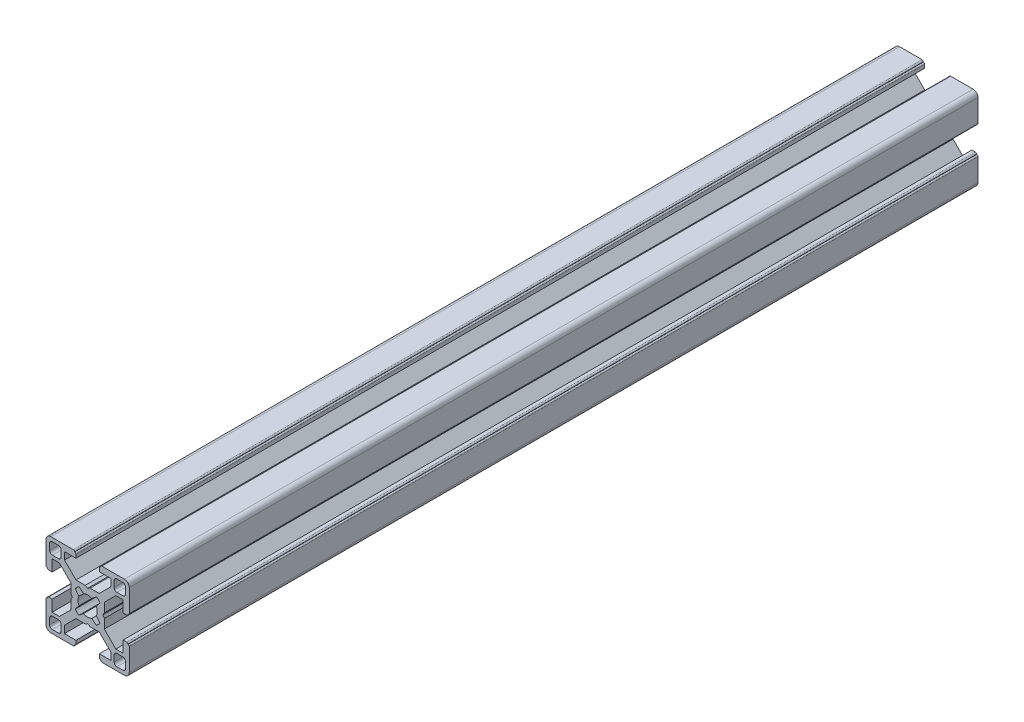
ISO-10303-21;
HEADER;
FILE_DESCRIPTION(('STEP AP214'),'2;1');
FILE_NAME('part.step','',(''),(''),'','','');
FILE_SCHEMA(('AUTOMOTIVE_DESIGN { 1 0 10303 214 1 1 1 1 }'));
ENDSEC;
DATA;
#1=APPLICATION_CONTEXT('core data for automotive mechanical design processes');
#2=APPLICATION_PROTOCOL_DEFINITION('international standard','automotive_design',2000,#1);
#3=PRODUCT_CONTEXT('',#1,'mechanical');
#4=PRODUCT('Part','Part','',(#3));
#5=PRODUCT_RELATED_PRODUCT_CATEGORY('part','',(#4));
#6=PRODUCT_DEFINITION_FORMATION('','',#4);
#7=PRODUCT_DEFINITION_CONTEXT('part definition',#1,'design');
#8=PRODUCT_DEFINITION('design','',#6,#7);
#9=PRODUCT_DEFINITION_SHAPE('','',#8);
#10=(LENGTH_UNIT() NAMED_UNIT(*) SI_UNIT(.MILLI.,.METRE.));
#11=(NAMED_UNIT(*) PLANE_ANGLE_UNIT() SI_UNIT($,.RADIAN.));
#12=(NAMED_UNIT(*) SI_UNIT($,.STERADIAN.) SOLID_ANGLE_UNIT());
#13=UNCERTAINTY_MEASURE_WITH_UNIT(LENGTH_MEASURE(1.E-05),#10,'distance_accuracy_value','');
#14=(GEOMETRIC_REPRESENTATION_CONTEXT(3) GLOBAL_UNCERTAINTY_ASSIGNED_CONTEXT((#13)) GLOBAL_UNIT_ASSIGNED_CONTEXT((#10,
#11,#12)) REPRESENTATION_CONTEXT('',''));
#15=CARTESIAN_POINT('',(0.,0.,0.));
#16=DIRECTION('',(0.,0.,1.));
#17=DIRECTION('',(1.,0.,0.));
#18=AXIS2_PLACEMENT_3D('',#15,#16,#17);
#19=CARTESIAN_POINT('',(-8.325,10.1351933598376,-152.4));
#20=DIRECTION('',(1.,0.,0.));
#21=DIRECTION('',(0.,0.,-1.));
#22=AXIS2_PLACEMENT_3D('',#19,#20,#21);
#23=PLANE('',#22);
#24=DIRECTION('',(0.,1.,0.));
#25=VECTOR('',#24,1.);
#26=CARTESIAN_POINT('',(-8.325,10.1351933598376,152.4));
#27=LINE('',#26,#25);
#28=CARTESIAN_POINT('',(-8.325,10.1351933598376,152.4));
#29=VERTEX_POINT('',#28);
#30=CARTESIAN_POINT('',(-8.325,12.75,152.4));
#31=VERTEX_POINT('',#30);
#32=EDGE_CURVE('E2129',#29,#31,#27,.T.);
#33=ORIENTED_EDGE('',*,*,#32,.F.);
#34=DIRECTION('',(0.,0.,1.));
#35=VECTOR('',#34,1.);
#36=CARTESIAN_POINT('',(-8.325,10.1351933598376,-152.4));
#37=LINE('',#36,#35);
#38=CARTESIAN_POINT('',(-8.325,10.1351933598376,-152.4));
#39=VERTEX_POINT('',#38);
#40=EDGE_CURVE('E11',#39,#29,#37,.T.);
#41=ORIENTED_EDGE('',*,*,#40,.F.);
#42=DIRECTION('',(0.,1.,0.));
#43=VECTOR('',#42,1.);
#44=CARTESIAN_POINT('',(-8.325,10.1351933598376,-152.4));
#45=LINE('',#44,#43);
#46=CARTESIAN_POINT('',(-8.325,12.75,-152.4));
#47=VERTEX_POINT('',#46);
#48=EDGE_CURVE('E2150',#39,#47,#45,.T.);
#49=ORIENTED_EDGE('',*,*,#48,.T.);
#50=DIRECTION('',(0.,0.,1.));
#51=VECTOR('',#50,1.);
#52=CARTESIAN_POINT('',(-8.325,12.75,-152.4));
#53=LINE('',#52,#51);
#54=EDGE_CURVE('E54',#47,#31,#53,.T.);
#55=ORIENTED_EDGE('',*,*,#54,.T.);
#56=EDGE_LOOP('',(#33,#41,#49,#55));
#57=FACE_BOUND('',#56,.T.);
#58=ADVANCED_FACE('F51',(#57),#23,.T.);
#59=CARTESIAN_POINT('',(-4.18980664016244,6.,-152.4));
#60=DIRECTION('',(0.707106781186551,0.707106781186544,0.));
#61=DIRECTION('',(-0.707106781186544,0.707106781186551,0.));
#62=AXIS2_PLACEMENT_3D('',#59,#60,#61);
#63=PLANE('',#62);
#64=DIRECTION('',(-0.707106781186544,0.707106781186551,0.));
#65=VECTOR('',#64,1.);
#66=CARTESIAN_POINT('',(-4.18980664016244,6.,152.4));
#67=LINE('',#66,#65);
#68=CARTESIAN_POINT('',(-4.18980664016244,6.,152.4));
#69=VERTEX_POINT('',#68);
#70=EDGE_CURVE('E2155',#69,#29,#67,.T.);
#71=ORIENTED_EDGE('',*,*,#70,.F.);
#72=DIRECTION('',(0.,0.,1.));
#73=VECTOR('',#72,1.);
#74=CARTESIAN_POINT('',(-4.18980664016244,6.,-152.4));
#75=LINE('',#74,#73);
#76=CARTESIAN_POINT('',(-4.18980664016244,6.,-152.4));
#77=VERTEX_POINT('',#76);
#78=EDGE_CURVE('E60',#77,#69,#75,.T.);
#79=ORIENTED_EDGE('',*,*,#78,.F.);
#80=DIRECTION('',(-0.707106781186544,0.707106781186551,0.));
#81=VECTOR('',#80,1.);
#82=CARTESIAN_POINT('',(-4.18980664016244,6.,-152.4));
#83=LINE('',#82,#81);
#84=EDGE_CURVE('E2258',#77,#39,#83,.T.);
#85=ORIENTED_EDGE('',*,*,#84,.T.);
#86=ORIENTED_EDGE('',*,*,#40,.T.);
#87=EDGE_LOOP('',(#71,#79,#85,#86));
#88=FACE_BOUND('',#87,.T.);
#89=ADVANCED_FACE('F2463',(#88),#63,.T.);
#90=CARTESIAN_POINT('',(-0.875,6.,-152.4));
#91=DIRECTION('',(0.,1.,0.));
#92=DIRECTION('',(0.,0.,1.));
#93=AXIS2_PLACEMENT_3D('',#90,#91,#92);
#94=PLANE('',#93);
#95=DIRECTION('',(-1.,0.,0.));
#96=VECTOR('',#95,1.);
#97=CARTESIAN_POINT('',(-0.875,6.,152.4));
#98=LINE('',#97,#96);
#99=CARTESIAN_POINT('',(-0.875,6.,152.4));
#100=VERTEX_POINT('',#99);
#101=EDGE_CURVE('E2364',#100,#69,#98,.T.);
#102=ORIENTED_EDGE('',*,*,#101,.F.);
#103=DIRECTION('',(0.,0.,1.));
#104=VECTOR('',#103,1.);
#105=CARTESIAN_POINT('',(-0.875,6.,-152.4));
#106=LINE('',#105,#104);
#107=CARTESIAN_POINT('',(-0.875,6.,-152.4));
#108=VERTEX_POINT('',#107);
#109=EDGE_CURVE('E2373',#108,#100,#106,.T.);
#110=ORIENTED_EDGE('',*,*,#109,.F.);
#111=DIRECTION('',(-1.,0.,0.));
#112=VECTOR('',#111,1.);
#113=CARTESIAN_POINT('',(-0.875,6.,-152.4));
#114=LINE('',#113,#112);
#115=EDGE_CURVE('E2254',#108,#77,#114,.T.);
#116=ORIENTED_EDGE('',*,*,#115,.T.);
#117=ORIENTED_EDGE('',*,*,#78,.T.);
#118=EDGE_LOOP('',(#102,#110,#116,#117));
#119=FACE_BOUND('',#118,.T.);
#120=ADVANCED_FACE('F2818',(#119),#94,.T.);
#121=CARTESIAN_POINT('',(0.,5.5,-152.4));
#122=DIRECTION('',(0.496138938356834,0.868243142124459,0.));
#123=DIRECTION('',(-0.868243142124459,0.496138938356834,0.));
#124=AXIS2_PLACEMENT_3D('',#121,#122,#123);
#125=PLANE('',#124);
#126=DIRECTION('',(-0.868243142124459,0.496138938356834,0.));
#127=VECTOR('',#126,1.);
#128=CARTESIAN_POINT('',(0.,5.5,152.4));
#129=LINE('',#128,#127);
#130=CARTESIAN_POINT('',(0.,5.5,152.4));
#131=VERTEX_POINT('',#130);
#132=EDGE_CURVE('E2360',#131,#100,#129,.T.);
#133=ORIENTED_EDGE('',*,*,#132,.F.);
#134=DIRECTION('',(0.,0.,1.));
#135=VECTOR('',#134,1.);
#136=CARTESIAN_POINT('',(0.,5.5,-152.4));
#137=LINE('',#136,#135);
#138=CARTESIAN_POINT('',(0.,5.5,-152.4));
#139=VERTEX_POINT('',#138);
#140=EDGE_CURVE('E2376',#139,#131,#137,.T.);
#141=ORIENTED_EDGE('',*,*,#140,.F.);
#142=DIRECTION('',(-0.868243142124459,0.496138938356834,0.));
#143=VECTOR('',#142,1.);
#144=CARTESIAN_POINT('',(0.,5.5,-152.4));
#145=LINE('',#144,#143);
#146=EDGE_CURVE('E2250',#139,#108,#145,.T.);
#147=ORIENTED_EDGE('',*,*,#146,.T.);
#148=ORIENTED_EDGE('',*,*,#109,.T.);
#149=EDGE_LOOP('',(#133,#141,#147,#148));
#150=FACE_BOUND('',#149,.T.);
#151=ADVANCED_FACE('F2816',(#150),#125,.T.);
#152=CARTESIAN_POINT('',(0.,0.,-152.4));
#153=DIRECTION('',(0.,0.,1.));
#154=DIRECTION('',(1.,0.,0.));
#155=AXIS2_PLACEMENT_3D('',#152,#153,#154);
#156=CYLINDRICAL_SURFACE('',#155,3.45501159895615);
#157=CARTESIAN_POINT('',(0.,0.,152.4));
#158=DIRECTION('',(0.,0.,-1.));
#159=DIRECTION('',(-1.,0.,0.));
#160=AXIS2_PLACEMENT_3D('',#157,#158,#159);
#161=CIRCLE('',#160,3.45501159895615);
#162=CARTESIAN_POINT('',(-1.49058556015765,3.1169311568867,152.4));
#163=VERTEX_POINT('',#162);
#164=CARTESIAN_POINT('',(1.4905855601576,3.11693115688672,152.4));
#165=VERTEX_POINT('',#164);
#166=EDGE_CURVE('E2357',#163,#165,#161,.T.);
#167=ORIENTED_EDGE('',*,*,#166,.F.);
#168=DIRECTION('',(0.,0.,1.));
#169=VECTOR('',#168,1.);
#170=CARTESIAN_POINT('',(-1.49058556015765,3.1169311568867,-152.4));
#171=LINE('',#170,#169);
#172=CARTESIAN_POINT('',(-1.49058556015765,3.1169311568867,-152.4));
#173=VERTEX_POINT('',#172);
#174=EDGE_CURVE('E2380',#173,#163,#171,.T.);
#175=ORIENTED_EDGE('',*,*,#174,.F.);
#176=CARTESIAN_POINT('',(0.,0.,-152.4));
#177=DIRECTION('',(0.,0.,-1.));
#178=DIRECTION('',(-1.,0.,0.));
#179=AXIS2_PLACEMENT_3D('',#176,#177,#178);
#180=CIRCLE('',#179,3.45501159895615);
#181=CARTESIAN_POINT('',(1.4905855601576,3.11693115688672,-152.4));
#182=VERTEX_POINT('',#181);
#183=EDGE_CURVE('E2247',#173,#182,#180,.T.);
#184=ORIENTED_EDGE('',*,*,#183,.T.);
#185=DIRECTION('',(0.,0.,1.));
#186=VECTOR('',#185,1.);
#187=CARTESIAN_POINT('',(1.4905855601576,3.11693115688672,-152.4));
#188=LINE('',#187,#186);
#189=EDGE_CURVE('E1234',#182,#165,#188,.T.);
#190=ORIENTED_EDGE('',*,*,#189,.T.);
#191=EDGE_LOOP('',(#167,#175,#184,#190));
#192=FACE_BOUND('',#191,.T.);
#193=ADVANCED_FACE('F2846',(#192),#156,.F.);
#194=CARTESIAN_POINT('',(-3.16278731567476,4.45679272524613,-152.4));
#195=DIRECTION('',(-0.625292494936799,-0.780390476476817,0.));
#196=DIRECTION('',(0.780390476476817,-0.625292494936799,0.));
#197=AXIS2_PLACEMENT_3D('',#194,#195,#196);
#198=PLANE('',#197);
#199=DIRECTION('',(0.780390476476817,-0.625292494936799,0.));
#200=VECTOR('',#199,1.);
#201=CARTESIAN_POINT('',(-3.16278731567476,4.45679272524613,152.4));
#202=LINE('',#201,#200);
#203=CARTESIAN_POINT('',(-3.16278731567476,4.45679272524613,152.4));
#204=VERTEX_POINT('',#203);
#205=EDGE_CURVE('E2353',#204,#163,#202,.T.);
#206=ORIENTED_EDGE('',*,*,#205,.F.);
#207=DIRECTION('',(0.,0.,1.));
#208=VECTOR('',#207,1.);
#209=CARTESIAN_POINT('',(-3.16278731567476,4.45679272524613,-152.4));
#210=LINE('',#209,#208);
#211=CARTESIAN_POINT('',(-3.16278731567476,4.45679272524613,-152.4));
#212=VERTEX_POINT('',#211);
#213=EDGE_CURVE('E2383',#212,#204,#210,.T.);
#214=ORIENTED_EDGE('',*,*,#213,.F.);
#215=DIRECTION('',(0.780390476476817,-0.625292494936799,0.));
#216=VECTOR('',#215,1.);
#217=CARTESIAN_POINT('',(-3.16278731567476,4.45679272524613,-152.4));
#218=LINE('',#217,#216);
#219=EDGE_CURVE('E2243',#212,#173,#218,.T.);
#220=ORIENTED_EDGE('',*,*,#219,.T.);
#221=ORIENTED_EDGE('',*,*,#174,.T.);
#222=EDGE_LOOP('',(#206,#214,#220,#221));
#223=FACE_BOUND('',#222,.T.);
#224=ADVANCED_FACE('F2849',(#223),#198,.T.);
#225=CARTESIAN_POINT('',(0.,0.,-152.4));
#226=DIRECTION('',(0.,0.,1.));
#227=DIRECTION('',(1.,0.,0.));
#228=AXIS2_PLACEMENT_3D('',#225,#226,#227);
#229=CYLINDRICAL_SURFACE('',#228,5.465);
#230=CARTESIAN_POINT('',(0.,0.,152.4));
#231=DIRECTION('',(0.,0.,-1.));
#232=DIRECTION('',(-1.,0.,0.));
#233=AXIS2_PLACEMENT_3D('',#230,#231,#232);
#234=CIRCLE('',#233,5.465);
#235=CARTESIAN_POINT('',(-4.45679272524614,3.16278731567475,152.4));
#236=VERTEX_POINT('',#235);
#237=EDGE_CURVE('E2349',#236,#204,#234,.T.);
#238=ORIENTED_EDGE('',*,*,#237,.F.);
#239=DIRECTION('',(0.,0.,1.));
#240=VECTOR('',#239,1.);
#241=CARTESIAN_POINT('',(-4.45679272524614,3.16278731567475,-152.4));
#242=LINE('',#241,#240);
#243=CARTESIAN_POINT('',(-4.45679272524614,3.16278731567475,-152.4));
#244=VERTEX_POINT('',#243);
#245=EDGE_CURVE('E2386',#244,#236,#242,.T.);
#246=ORIENTED_EDGE('',*,*,#245,.F.);
#247=CARTESIAN_POINT('',(0.,0.,-152.4));
#248=DIRECTION('',(0.,0.,-1.));
#249=DIRECTION('',(-1.,0.,0.));
#250=AXIS2_PLACEMENT_3D('',#247,#248,#249);
#251=CIRCLE('',#250,5.465);
#252=EDGE_CURVE('E2239',#244,#212,#251,.T.);
#253=ORIENTED_EDGE('',*,*,#252,.T.);
#254=ORIENTED_EDGE('',*,*,#213,.T.);
#255=EDGE_LOOP('',(#238,#246,#253,#254));
#256=FACE_BOUND('',#255,.T.);
#257=ADVANCED_FACE('F2853',(#256),#229,.F.);
#258=CARTESIAN_POINT('',(-3.1169311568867,1.49058556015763,-152.4));
#259=DIRECTION('',(0.780390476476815,0.625292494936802,0.));
#260=DIRECTION('',(-0.625292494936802,0.780390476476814,0.));
#261=AXIS2_PLACEMENT_3D('',#258,#259,#260);
#262=PLANE('',#261);
#263=DIRECTION('',(-0.625292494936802,0.780390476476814,0.));
#264=VECTOR('',#263,1.);
#265=CARTESIAN_POINT('',(-3.1169311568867,1.49058556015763,152.4));
#266=LINE('',#265,#264);
#267=CARTESIAN_POINT('',(-3.1169311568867,1.49058556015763,152.4));
#268=VERTEX_POINT('',#267);
#269=EDGE_CURVE('E2345',#268,#236,#266,.T.);
#270=ORIENTED_EDGE('',*,*,#269,.F.);
#271=DIRECTION('',(0.,0.,1.));
#272=VECTOR('',#271,1.);
#273=CARTESIAN_POINT('',(-3.1169311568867,1.49058556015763,-152.4));
#274=LINE('',#273,#272);
#275=CARTESIAN_POINT('',(-3.1169311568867,1.49058556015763,-152.4));
#276=VERTEX_POINT('',#275);
#277=EDGE_CURVE('E2389',#276,#268,#274,.T.);
#278=ORIENTED_EDGE('',*,*,#277,.F.);
#279=DIRECTION('',(-0.625292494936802,0.780390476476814,0.));
#280=VECTOR('',#279,1.);
#281=CARTESIAN_POINT('',(-3.1169311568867,1.49058556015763,-152.4));
#282=LINE('',#281,#280);
#283=EDGE_CURVE('E2235',#276,#244,#282,.T.);
#284=ORIENTED_EDGE('',*,*,#283,.T.);
#285=ORIENTED_EDGE('',*,*,#245,.T.);
#286=EDGE_LOOP('',(#270,#278,#284,#285));
#287=FACE_BOUND('',#286,.T.);
#288=ADVANCED_FACE('F2857',(#287),#262,.T.);
#289=CARTESIAN_POINT('',(0.,0.,-152.4));
#290=DIRECTION('',(0.,0.,1.));
#291=DIRECTION('',(1.,0.,0.));
#292=AXIS2_PLACEMENT_3D('',#289,#290,#291);
#293=CYLINDRICAL_SURFACE('',#292,3.45501159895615);
#294=CARTESIAN_POINT('',(0.,0.,152.4));
#295=DIRECTION('',(0.,0.,-1.));
#296=DIRECTION('',(-1.,0.,0.));
#297=AXIS2_PLACEMENT_3D('',#294,#295,#296);
#298=CIRCLE('',#297,3.45501159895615);
#299=CARTESIAN_POINT('',(-3.11693115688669,-1.49058556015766,152.4));
#300=VERTEX_POINT('',#299);
#301=EDGE_CURVE('E2341',#300,#268,#298,.T.);
#302=ORIENTED_EDGE('',*,*,#301,.F.);
#303=DIRECTION('',(0.,0.,1.));
#304=VECTOR('',#303,1.);
#305=CARTESIAN_POINT('',(-3.11693115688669,-1.49058556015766,-152.4));
#306=LINE('',#305,#304);
#307=CARTESIAN_POINT('',(-3.11693115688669,-1.49058556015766,-152.4));
#308=VERTEX_POINT('',#307);
#309=EDGE_CURVE('E1992',#308,#300,#306,.T.);
#310=ORIENTED_EDGE('',*,*,#309,.F.);
#311=CARTESIAN_POINT('',(0.,0.,-152.4));
#312=DIRECTION('',(0.,0.,-1.));
#313=DIRECTION('',(-1.,0.,0.));
#314=AXIS2_PLACEMENT_3D('',#311,#312,#313);
#315=CIRCLE('',#314,3.45501159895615);
#316=EDGE_CURVE('E2231',#308,#276,#315,.T.);
#317=ORIENTED_EDGE('',*,*,#316,.T.);
#318=ORIENTED_EDGE('',*,*,#277,.T.);
#319=EDGE_LOOP('',(#302,#310,#317,#318));
#320=FACE_BOUND('',#319,.T.);
#321=ADVANCED_FACE('F2861',(#320),#293,.F.);
#322=CARTESIAN_POINT('',(-6.,0.875,-152.4));
#323=DIRECTION('',(-0.868243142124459,-0.496138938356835,0.));
#324=DIRECTION('',(0.496138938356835,-0.868243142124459,0.));
#325=AXIS2_PLACEMENT_3D('',#322,#323,#324);
#326=PLANE('',#325);
#327=DIRECTION('',(0.496138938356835,-0.868243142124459,0.));
#328=VECTOR('',#327,1.);
#329=CARTESIAN_POINT('',(-6.,0.875,152.4));
#330=LINE('',#329,#328);
#331=CARTESIAN_POINT('',(-6.,0.875,152.4));
#332=VERTEX_POINT('',#331);
#333=CARTESIAN_POINT('',(-5.5,0.,152.4));
#334=VERTEX_POINT('',#333);
#335=EDGE_CURVE('E2337',#332,#334,#330,.T.);
#336=ORIENTED_EDGE('',*,*,#335,.F.);
#337=DIRECTION('',(0.,0.,1.));
#338=VECTOR('',#337,1.);
#339=CARTESIAN_POINT('',(-6.,0.875,-152.4));
#340=LINE('',#339,#338);
#341=CARTESIAN_POINT('',(-6.,0.875,-152.4));
#342=VERTEX_POINT('',#341);
#343=EDGE_CURVE('E2396',#342,#332,#340,.T.);
#344=ORIENTED_EDGE('',*,*,#343,.F.);
#345=DIRECTION('',(0.496138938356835,-0.868243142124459,0.));
#346=VECTOR('',#345,1.);
#347=CARTESIAN_POINT('',(-6.,0.875,-152.4));
#348=LINE('',#347,#346);
#349=CARTESIAN_POINT('',(-5.5,0.,-152.4));
#350=VERTEX_POINT('',#349);
#351=EDGE_CURVE('E2227',#342,#350,#348,.T.);
#352=ORIENTED_EDGE('',*,*,#351,.T.);
#353=DIRECTION('',(0.,0.,1.));
#354=VECTOR('',#353,1.);
#355=CARTESIAN_POINT('',(-5.5,0.,-152.4));
#356=LINE('',#355,#354);
#357=EDGE_CURVE('E2392',#350,#334,#356,.T.);
#358=ORIENTED_EDGE('',*,*,#357,.T.);
#359=EDGE_LOOP('',(#336,#344,#352,#358));
#360=FACE_BOUND('',#359,.T.);
#361=ADVANCED_FACE('F2538',(#360),#326,.T.);
#362=CARTESIAN_POINT('',(-6.,4.18980664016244,-152.4));
#363=DIRECTION('',(-1.,0.,0.));
#364=DIRECTION('',(0.,0.,1.));
#365=AXIS2_PLACEMENT_3D('',#362,#363,#364);
#366=PLANE('',#365);
#367=DIRECTION('',(0.,-1.,0.));
#368=VECTOR('',#367,1.);
#369=CARTESIAN_POINT('',(-6.,4.18980664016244,152.4));
#370=LINE('',#369,#368);
#371=CARTESIAN_POINT('',(-6.,4.18980664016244,152.4));
#372=VERTEX_POINT('',#371);
#373=EDGE_CURVE('E2333',#372,#332,#370,.T.);
#374=ORIENTED_EDGE('',*,*,#373,.F.);
#375=DIRECTION('',(0.,0.,1.));
#376=VECTOR('',#375,1.);
#377=CARTESIAN_POINT('',(-6.,4.18980664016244,-152.4));
#378=LINE('',#377,#376);
#379=CARTESIAN_POINT('',(-6.,4.18980664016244,-152.4));
#380=VERTEX_POINT('',#379);
#381=EDGE_CURVE('E2399',#380,#372,#378,.T.);
#382=ORIENTED_EDGE('',*,*,#381,.F.);
#383=DIRECTION('',(0.,-1.,0.));
#384=VECTOR('',#383,1.);
#385=CARTESIAN_POINT('',(-6.,4.18980664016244,-152.4));
#386=LINE('',#385,#384);
#387=EDGE_CURVE('E2223',#380,#342,#386,.T.);
#388=ORIENTED_EDGE('',*,*,#387,.T.);
#389=ORIENTED_EDGE('',*,*,#343,.T.);
#390=EDGE_LOOP('',(#374,#382,#388,#389));
#391=FACE_BOUND('',#390,.T.);
#392=ADVANCED_FACE('F2534',(#391),#366,.T.);
#393=CARTESIAN_POINT('',(-10.1351933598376,8.325,-152.4));
#394=DIRECTION('',(-0.707106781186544,-0.707106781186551,0.));
#395=DIRECTION('',(0.707106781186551,-0.707106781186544,0.));
#396=AXIS2_PLACEMENT_3D('',#393,#394,#395);
#397=PLANE('',#396);
#398=DIRECTION('',(0.707106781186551,-0.707106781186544,0.));
#399=VECTOR('',#398,1.);
#400=CARTESIAN_POINT('',(-10.1351933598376,8.325,152.4));
#401=LINE('',#400,#399);
#402=CARTESIAN_POINT('',(-10.1351933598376,8.325,152.4));
#403=VERTEX_POINT('',#402);
#404=EDGE_CURVE('E2329',#403,#372,#401,.T.);
#405=ORIENTED_EDGE('',*,*,#404,.F.);
#406=DIRECTION('',(0.,0.,1.));
#407=VECTOR('',#406,1.);
#408=CARTESIAN_POINT('',(-10.1351933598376,8.325,-152.4));
#409=LINE('',#408,#407);
#410=CARTESIAN_POINT('',(-10.1351933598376,8.325,-152.4));
#411=VERTEX_POINT('',#410);
#412=EDGE_CURVE('E2402',#411,#403,#409,.T.);
#413=ORIENTED_EDGE('',*,*,#412,.F.);
#414=DIRECTION('',(0.707106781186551,-0.707106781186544,0.));
#415=VECTOR('',#414,1.);
#416=CARTESIAN_POINT('',(-10.1351933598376,8.325,-152.4));
#417=LINE('',#416,#415);
#418=EDGE_CURVE('E2219',#411,#380,#417,.T.);
#419=ORIENTED_EDGE('',*,*,#418,.T.);
#420=ORIENTED_EDGE('',*,*,#381,.T.);
#421=EDGE_LOOP('',(#405,#413,#419,#420));
#422=FACE_BOUND('',#421,.T.);
#423=ADVANCED_FACE('F2530',(#422),#397,.T.);
#424=CARTESIAN_POINT('',(-12.75,8.325,-152.4));
#425=DIRECTION('',(0.,-1.,0.));
#426=DIRECTION('',(0.,0.,-1.));
#427=AXIS2_PLACEMENT_3D('',#424,#425,#426);
#428=PLANE('',#427);
#429=DIRECTION('',(1.,0.,0.));
#430=VECTOR('',#429,1.);
#431=CARTESIAN_POINT('',(-12.75,8.325,152.4));
#432=LINE('',#431,#430);
#433=CARTESIAN_POINT('',(-12.75,8.325,152.4));
#434=VERTEX_POINT('',#433);
#435=EDGE_CURVE('E2325',#434,#403,#432,.T.);
#436=ORIENTED_EDGE('',*,*,#435,.F.);
#437=DIRECTION('',(0.,0.,1.));
#438=VECTOR('',#437,1.);
#439=CARTESIAN_POINT('',(-12.75,8.325,-152.4));
#440=LINE('',#439,#438);
#441=CARTESIAN_POINT('',(-12.75,8.325,-152.4));
#442=VERTEX_POINT('',#441);
#443=EDGE_CURVE('E2405',#442,#434,#440,.T.);
#444=ORIENTED_EDGE('',*,*,#443,.F.);
#445=DIRECTION('',(1.,0.,0.));
#446=VECTOR('',#445,1.);
#447=CARTESIAN_POINT('',(-12.75,8.325,-152.4));
#448=LINE('',#447,#446);
#449=EDGE_CURVE('E2215',#442,#411,#448,.T.);
#450=ORIENTED_EDGE('',*,*,#449,.T.);
#451=ORIENTED_EDGE('',*,*,#412,.T.);
#452=EDGE_LOOP('',(#436,#444,#450,#451));
#453=FACE_BOUND('',#452,.T.);
#454=ADVANCED_FACE('F2526',(#453),#428,.T.);
#455=CARTESIAN_POINT('',(-12.75,4.2,-152.4));
#456=DIRECTION('',(1.,0.,0.));
#457=DIRECTION('',(0.,0.,-1.));
#458=AXIS2_PLACEMENT_3D('',#455,#456,#457);
#459=PLANE('',#458);
#460=DIRECTION('',(0.,1.,0.));
#461=VECTOR('',#460,1.);
#462=CARTESIAN_POINT('',(-12.75,4.2,152.4));
#463=LINE('',#462,#461);
#464=CARTESIAN_POINT('',(-12.75,4.2,152.4));
#465=VERTEX_POINT('',#464);
#466=EDGE_CURVE('E2321',#465,#434,#463,.T.);
#467=ORIENTED_EDGE('',*,*,#466,.F.);
#468=DIRECTION('',(0.,0.,1.));
#469=VECTOR('',#468,1.);
#470=CARTESIAN_POINT('',(-12.75,4.2,-152.4));
#471=LINE('',#470,#469);
#472=CARTESIAN_POINT('',(-12.75,4.2,-152.4));
#473=VERTEX_POINT('',#472);
#474=EDGE_CURVE('E2408',#473,#465,#471,.T.);
#475=ORIENTED_EDGE('',*,*,#474,.F.);
#476=DIRECTION('',(0.,1.,0.));
#477=VECTOR('',#476,1.);
#478=CARTESIAN_POINT('',(-12.75,4.2,-152.4));
#479=LINE('',#478,#477);
#480=EDGE_CURVE('E2211',#473,#442,#479,.T.);
#481=ORIENTED_EDGE('',*,*,#480,.T.);
#482=ORIENTED_EDGE('',*,*,#443,.T.);
#483=EDGE_LOOP('',(#467,#475,#481,#482));
#484=FACE_BOUND('',#483,.T.);
#485=ADVANCED_FACE('F2522',(#484),#459,.T.);
#486=CARTESIAN_POINT('',(-14.,4.2,-152.4));
#487=DIRECTION('',(0.,-1.,0.));
#488=DIRECTION('',(0.,0.,-1.));
#489=AXIS2_PLACEMENT_3D('',#486,#487,#488);
#490=PLANE('',#489);
#491=DIRECTION('',(1.,0.,0.));
#492=VECTOR('',#491,1.);
#493=CARTESIAN_POINT('',(-14.,4.2,152.4));
#494=LINE('',#493,#492);
#495=CARTESIAN_POINT('',(-14.,4.2,152.4));
#496=VERTEX_POINT('',#495);
#497=EDGE_CURVE('E2317',#496,#465,#494,.T.);
#498=ORIENTED_EDGE('',*,*,#497,.F.);
#499=DIRECTION('',(0.,0.,1.));
#500=VECTOR('',#499,1.);
#501=CARTESIAN_POINT('',(-14.,4.2,-152.4));
#502=LINE('',#501,#500);
#503=CARTESIAN_POINT('',(-14.,4.2,-152.4));
#504=VERTEX_POINT('',#503);
#505=EDGE_CURVE('E2411',#504,#496,#502,.T.);
#506=ORIENTED_EDGE('',*,*,#505,.F.);
#507=DIRECTION('',(1.,0.,0.));
#508=VECTOR('',#507,1.);
#509=CARTESIAN_POINT('',(-14.,4.2,-152.4));
#510=LINE('',#509,#508);
#511=EDGE_CURVE('E2207',#504,#473,#510,.T.);
#512=ORIENTED_EDGE('',*,*,#511,.T.);
#513=ORIENTED_EDGE('',*,*,#474,.T.);
#514=EDGE_LOOP('',(#498,#506,#512,#513));
#515=FACE_BOUND('',#514,.T.);
#516=ADVANCED_FACE('F2518',(#515),#490,.T.);
#517=CARTESIAN_POINT('',(-14.,4.65,-152.4));
#518=DIRECTION('',(0.,0.,1.));
#519=DIRECTION('',(1.,0.,0.));
#520=AXIS2_PLACEMENT_3D('',#517,#518,#519);
#521=CYLINDRICAL_SURFACE('',#520,0.449999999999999);
#522=CARTESIAN_POINT('',(-14.,4.65,152.4));
#523=DIRECTION('',(0.,0.,1.));
#524=DIRECTION('',(1.,0.,0.));
#525=AXIS2_PLACEMENT_3D('',#522,#523,#524);
#526=CIRCLE('',#525,0.449999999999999);
#527=CARTESIAN_POINT('',(-14.45,4.65,152.4));
#528=VERTEX_POINT('',#527);
#529=EDGE_CURVE('E2313',#528,#496,#526,.T.);
#530=ORIENTED_EDGE('',*,*,#529,.F.);
#531=DIRECTION('',(0.,0.,1.));
#532=VECTOR('',#531,1.);
#533=CARTESIAN_POINT('',(-14.45,4.65,-152.4));
#534=LINE('',#533,#532);
#535=CARTESIAN_POINT('',(-14.45,4.65,-152.4));
#536=VERTEX_POINT('',#535);
#537=EDGE_CURVE('E2414',#536,#528,#534,.T.);
#538=ORIENTED_EDGE('',*,*,#537,.F.);
#539=CARTESIAN_POINT('',(-14.,4.65,-152.4));
#540=DIRECTION('',(0.,0.,1.));
#541=DIRECTION('',(1.,0.,0.));
#542=AXIS2_PLACEMENT_3D('',#539,#540,#541);
#543=CIRCLE('',#542,0.449999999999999);
#544=EDGE_CURVE('E2203',#536,#504,#543,.T.);
#545=ORIENTED_EDGE('',*,*,#544,.T.);
#546=ORIENTED_EDGE('',*,*,#505,.T.);
#547=EDGE_LOOP('',(#530,#538,#545,#546));
#548=FACE_BOUND('',#547,.T.);
#549=ADVANCED_FACE('F2514',(#548),#521,.T.);
#550=CARTESIAN_POINT('',(-14.45,4.7,-152.4));
#551=DIRECTION('',(-1.,0.,0.));
#552=DIRECTION('',(0.,0.,1.));
#553=AXIS2_PLACEMENT_3D('',#550,#551,#552);
#554=PLANE('',#553);
#555=DIRECTION('',(0.,-1.,0.));
#556=VECTOR('',#555,1.);
#557=CARTESIAN_POINT('',(-14.45,4.7,152.4));
#558=LINE('',#557,#556);
#559=CARTESIAN_POINT('',(-14.45,4.7,152.4));
#560=VERTEX_POINT('',#559);
#561=EDGE_CURVE('E2309',#560,#528,#558,.T.);
#562=ORIENTED_EDGE('',*,*,#561,.F.);
#563=DIRECTION('',(0.,0.,1.));
#564=VECTOR('',#563,1.);
#565=CARTESIAN_POINT('',(-14.45,4.7,-152.4));
#566=LINE('',#565,#564);
#567=CARTESIAN_POINT('',(-14.45,4.7,-152.4));
#568=VERTEX_POINT('',#567);
#569=EDGE_CURVE('E2417',#568,#560,#566,.T.);
#570=ORIENTED_EDGE('',*,*,#569,.F.);
#571=DIRECTION('',(0.,-1.,0.));
#572=VECTOR('',#571,1.);
#573=CARTESIAN_POINT('',(-14.45,4.7,-152.4));
#574=LINE('',#573,#572);
#575=EDGE_CURVE('E2199',#568,#536,#574,.T.);
#576=ORIENTED_EDGE('',*,*,#575,.T.);
#577=ORIENTED_EDGE('',*,*,#537,.T.);
#578=EDGE_LOOP('',(#562,#570,#576,#577));
#579=FACE_BOUND('',#578,.T.);
#580=ADVANCED_FACE('F2510',(#579),#554,.T.);
#581=CARTESIAN_POINT('',(-14.5,4.7,-152.4));
#582=DIRECTION('',(0.,-1.,0.));
#583=DIRECTION('',(0.,0.,-1.));
#584=AXIS2_PLACEMENT_3D('',#581,#582,#583);
#585=PLANE('',#584);
#586=DIRECTION('',(1.,0.,0.));
#587=VECTOR('',#586,1.);
#588=CARTESIAN_POINT('',(-14.5,4.7,152.4));
#589=LINE('',#588,#587);
#590=CARTESIAN_POINT('',(-14.5,4.7,152.4));
#591=VERTEX_POINT('',#590);
#592=EDGE_CURVE('E2305',#591,#560,#589,.T.);
#593=ORIENTED_EDGE('',*,*,#592,.F.);
#594=DIRECTION('',(0.,0.,1.));
#595=VECTOR('',#594,1.);
#596=CARTESIAN_POINT('',(-14.5,4.7,-152.4));
#597=LINE('',#596,#595);
#598=CARTESIAN_POINT('',(-14.5,4.7,-152.4));
#599=VERTEX_POINT('',#598);
#600=EDGE_CURVE('E2420',#599,#591,#597,.T.);
#601=ORIENTED_EDGE('',*,*,#600,.F.);
#602=DIRECTION('',(1.,0.,0.));
#603=VECTOR('',#602,1.);
#604=CARTESIAN_POINT('',(-14.5,4.7,-152.4));
#605=LINE('',#604,#603);
#606=EDGE_CURVE('E2195',#599,#568,#605,.T.);
#607=ORIENTED_EDGE('',*,*,#606,.T.);
#608=ORIENTED_EDGE('',*,*,#569,.T.);
#609=EDGE_LOOP('',(#593,#601,#607,#608));
#610=FACE_BOUND('',#609,.T.);
#611=ADVANCED_FACE('F2506',(#610),#585,.T.);
#612=CARTESIAN_POINT('',(-14.5,5.15,-152.4));
#613=DIRECTION('',(0.,0.,1.));
#614=DIRECTION('',(1.,0.,0.));
#615=AXIS2_PLACEMENT_3D('',#612,#613,#614);
#616=CYLINDRICAL_SURFACE('',#615,0.449999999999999);
#617=CARTESIAN_POINT('',(-14.5,5.15,152.4));
#618=DIRECTION('',(0.,0.,1.));
#619=DIRECTION('',(1.,0.,0.));
#620=AXIS2_PLACEMENT_3D('',#617,#618,#619);
#621=CIRCLE('',#620,0.449999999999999);
#622=CARTESIAN_POINT('',(-14.95,5.15,152.4));
#623=VERTEX_POINT('',#622);
#624=EDGE_CURVE('E2301',#623,#591,#621,.T.);
#625=ORIENTED_EDGE('',*,*,#624,.F.);
#626=DIRECTION('',(0.,0.,1.));
#627=VECTOR('',#626,1.);
#628=CARTESIAN_POINT('',(-14.95,5.15,-152.4));
#629=LINE('',#628,#627);
#630=CARTESIAN_POINT('',(-14.95,5.15,-152.4));
#631=VERTEX_POINT('',#630);
#632=EDGE_CURVE('E2423',#631,#623,#629,.T.);
#633=ORIENTED_EDGE('',*,*,#632,.F.);
#634=CARTESIAN_POINT('',(-14.5,5.15,-152.4));
#635=DIRECTION('',(0.,0.,1.));
#636=DIRECTION('',(1.,0.,0.));
#637=AXIS2_PLACEMENT_3D('',#634,#635,#636);
#638=CIRCLE('',#637,0.449999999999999);
#639=EDGE_CURVE('E2191',#631,#599,#638,.T.);
#640=ORIENTED_EDGE('',*,*,#639,.T.);
#641=ORIENTED_EDGE('',*,*,#600,.T.);
#642=EDGE_LOOP('',(#625,#633,#640,#641));
#643=FACE_BOUND('',#642,.T.);
#644=ADVANCED_FACE('F2502',(#643),#616,.T.);
#645=CARTESIAN_POINT('',(-14.95,13.2,-152.4));
#646=DIRECTION('',(-1.,0.,0.));
#647=DIRECTION('',(0.,0.,1.));
#648=AXIS2_PLACEMENT_3D('',#645,#646,#647);
#649=PLANE('',#648);
#650=DIRECTION('',(0.,-1.,0.));
#651=VECTOR('',#650,1.);
#652=CARTESIAN_POINT('',(-14.95,13.2,152.4));
#653=LINE('',#652,#651);
#654=CARTESIAN_POINT('',(-14.95,13.2,152.4));
#655=VERTEX_POINT('',#654);
#656=EDGE_CURVE('E2297',#655,#623,#653,.T.);
#657=ORIENTED_EDGE('',*,*,#656,.F.);
#658=DIRECTION('',(0.,0.,1.));
#659=VECTOR('',#658,1.);
#660=CARTESIAN_POINT('',(-14.95,13.2,-152.4));
#661=LINE('',#660,#659);
#662=CARTESIAN_POINT('',(-14.95,13.2,-152.4));
#663=VERTEX_POINT('',#662);
#664=EDGE_CURVE('E2426',#663,#655,#661,.T.);
#665=ORIENTED_EDGE('',*,*,#664,.F.);
#666=DIRECTION('',(0.,-1.,0.));
#667=VECTOR('',#666,1.);
#668=CARTESIAN_POINT('',(-14.95,13.2,-152.4));
#669=LINE('',#668,#667);
#670=EDGE_CURVE('E2187',#663,#631,#669,.T.);
#671=ORIENTED_EDGE('',*,*,#670,.T.);
#672=ORIENTED_EDGE('',*,*,#632,.T.);
#673=EDGE_LOOP('',(#657,#665,#671,#672));
#674=FACE_BOUND('',#673,.T.);
#675=ADVANCED_FACE('F2498',(#674),#649,.T.);
#676=CARTESIAN_POINT('',(-13.2,13.2,-152.4));
#677=DIRECTION('',(0.,0.,1.));
#678=DIRECTION('',(1.,0.,0.));
#679=AXIS2_PLACEMENT_3D('',#676,#677,#678);
#680=CYLINDRICAL_SURFACE('',#679,1.75);
#681=CARTESIAN_POINT('',(-13.2,13.2,152.4));
#682=DIRECTION('',(0.,0.,1.));
#683=DIRECTION('',(1.,0.,0.));
#684=AXIS2_PLACEMENT_3D('',#681,#682,#683);
#685=CIRCLE('',#684,1.75);
#686=CARTESIAN_POINT('',(-13.2,14.95,152.4));
#687=VERTEX_POINT('',#686);
#688=EDGE_CURVE('E2293',#687,#655,#685,.T.);
#689=ORIENTED_EDGE('',*,*,#688,.F.);
#690=DIRECTION('',(0.,0.,1.));
#691=VECTOR('',#690,1.);
#692=CARTESIAN_POINT('',(-13.2,14.95,-152.4));
#693=LINE('',#692,#691);
#694=CARTESIAN_POINT('',(-13.2,14.95,-152.4));
#695=VERTEX_POINT('',#694);
#696=EDGE_CURVE('E2429',#695,#687,#693,.T.);
#697=ORIENTED_EDGE('',*,*,#696,.F.);
#698=CARTESIAN_POINT('',(-13.2,13.2,-152.4));
#699=DIRECTION('',(0.,0.,1.));
#700=DIRECTION('',(1.,0.,0.));
#701=AXIS2_PLACEMENT_3D('',#698,#699,#700);
#702=CIRCLE('',#701,1.75);
#703=EDGE_CURVE('E2183',#695,#663,#702,.T.);
#704=ORIENTED_EDGE('',*,*,#703,.T.);
#705=ORIENTED_EDGE('',*,*,#664,.T.);
#706=EDGE_LOOP('',(#689,#697,#704,#705));
#707=FACE_BOUND('',#706,.T.);
#708=ADVANCED_FACE('F2494',(#707),#680,.T.);
#709=CARTESIAN_POINT('',(-5.15,14.95,-152.4));
#710=DIRECTION('',(0.,1.,0.));
#711=DIRECTION('',(0.,0.,1.));
#712=AXIS2_PLACEMENT_3D('',#709,#710,#711);
#713=PLANE('',#712);
#714=DIRECTION('',(-1.,0.,0.));
#715=VECTOR('',#714,1.);
#716=CARTESIAN_POINT('',(-5.15,14.95,152.4));
#717=LINE('',#716,#715);
#718=CARTESIAN_POINT('',(-5.15,14.95,152.4));
#719=VERTEX_POINT('',#718);
#720=EDGE_CURVE('E2289',#719,#687,#717,.T.);
#721=ORIENTED_EDGE('',*,*,#720,.F.);
#722=DIRECTION('',(0.,0.,1.));
#723=VECTOR('',#722,1.);
#724=CARTESIAN_POINT('',(-5.15,14.95,-152.4));
#725=LINE('',#724,#723);
#726=CARTESIAN_POINT('',(-5.15,14.95,-152.4));
#727=VERTEX_POINT('',#726);
#728=EDGE_CURVE('E2432',#727,#719,#725,.T.);
#729=ORIENTED_EDGE('',*,*,#728,.F.);
#730=DIRECTION('',(-1.,0.,0.));
#731=VECTOR('',#730,1.);
#732=CARTESIAN_POINT('',(-5.15,14.95,-152.4));
#733=LINE('',#732,#731);
#734=EDGE_CURVE('E2179',#727,#695,#733,.T.);
#735=ORIENTED_EDGE('',*,*,#734,.T.);
#736=ORIENTED_EDGE('',*,*,#696,.T.);
#737=EDGE_LOOP('',(#721,#729,#735,#736));
#738=FACE_BOUND('',#737,.T.);
#739=ADVANCED_FACE('F2490',(#738),#713,.T.);
#740=CARTESIAN_POINT('',(-5.15,14.5,-152.4));
#741=DIRECTION('',(0.,0.,1.));
#742=DIRECTION('',(1.,0.,0.));
#743=AXIS2_PLACEMENT_3D('',#740,#741,#742);
#744=CYLINDRICAL_SURFACE('',#743,0.449999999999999);
#745=CARTESIAN_POINT('',(-5.15,14.5,152.4));
#746=DIRECTION('',(0.,0.,1.));
#747=DIRECTION('',(1.,0.,0.));
#748=AXIS2_PLACEMENT_3D('',#745,#746,#747);
#749=CIRCLE('',#748,0.449999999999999);
#750=CARTESIAN_POINT('',(-4.7,14.5,152.4));
#751=VERTEX_POINT('',#750);
#752=EDGE_CURVE('E2285',#751,#719,#749,.T.);
#753=ORIENTED_EDGE('',*,*,#752,.F.);
#754=DIRECTION('',(0.,0.,1.));
#755=VECTOR('',#754,1.);
#756=CARTESIAN_POINT('',(-4.7,14.5,-152.4));
#757=LINE('',#756,#755);
#758=CARTESIAN_POINT('',(-4.7,14.5,-152.4));
#759=VERTEX_POINT('',#758);
#760=EDGE_CURVE('E2435',#759,#751,#757,.T.);
#761=ORIENTED_EDGE('',*,*,#760,.F.);
#762=CARTESIAN_POINT('',(-5.15,14.5,-152.4));
#763=DIRECTION('',(0.,0.,1.));
#764=DIRECTION('',(1.,0.,0.));
#765=AXIS2_PLACEMENT_3D('',#762,#763,#764);
#766=CIRCLE('',#765,0.449999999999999);
#767=EDGE_CURVE('E2175',#759,#727,#766,.T.);
#768=ORIENTED_EDGE('',*,*,#767,.T.);
#769=ORIENTED_EDGE('',*,*,#728,.T.);
#770=EDGE_LOOP('',(#753,#761,#768,#769));
#771=FACE_BOUND('',#770,.T.);
#772=ADVANCED_FACE('F2486',(#771),#744,.T.);
#773=CARTESIAN_POINT('',(-4.7,14.45,-152.4));
#774=DIRECTION('',(1.,0.,0.));
#775=DIRECTION('',(0.,0.,-1.));
#776=AXIS2_PLACEMENT_3D('',#773,#774,#775);
#777=PLANE('',#776);
#778=DIRECTION('',(0.,1.,0.));
#779=VECTOR('',#778,1.);
#780=CARTESIAN_POINT('',(-4.7,14.45,152.4));
#781=LINE('',#780,#779);
#782=CARTESIAN_POINT('',(-4.7,14.45,152.4));
#783=VERTEX_POINT('',#782);
#784=EDGE_CURVE('E2281',#783,#751,#781,.T.);
#785=ORIENTED_EDGE('',*,*,#784,.F.);
#786=DIRECTION('',(0.,0.,1.));
#787=VECTOR('',#786,1.);
#788=CARTESIAN_POINT('',(-4.7,14.45,-152.4));
#789=LINE('',#788,#787);
#790=CARTESIAN_POINT('',(-4.7,14.45,-152.4));
#791=VERTEX_POINT('',#790);
#792=EDGE_CURVE('E2438',#791,#783,#789,.T.);
#793=ORIENTED_EDGE('',*,*,#792,.F.);
#794=DIRECTION('',(0.,1.,0.));
#795=VECTOR('',#794,1.);
#796=CARTESIAN_POINT('',(-4.7,14.45,-152.4));
#797=LINE('',#796,#795);
#798=EDGE_CURVE('E2171',#791,#759,#797,.T.);
#799=ORIENTED_EDGE('',*,*,#798,.T.);
#800=ORIENTED_EDGE('',*,*,#760,.T.);
#801=EDGE_LOOP('',(#785,#793,#799,#800));
#802=FACE_BOUND('',#801,.T.);
#803=ADVANCED_FACE('F2482',(#802),#777,.T.);
#804=CARTESIAN_POINT('',(-4.65,14.45,-152.4));
#805=DIRECTION('',(0.,1.,0.));
#806=DIRECTION('',(0.,0.,1.));
#807=AXIS2_PLACEMENT_3D('',#804,#805,#806);
#808=PLANE('',#807);
#809=DIRECTION('',(-1.,0.,0.));
#810=VECTOR('',#809,1.);
#811=CARTESIAN_POINT('',(-4.65,14.45,152.4));
#812=LINE('',#811,#810);
#813=CARTESIAN_POINT('',(-4.65,14.45,152.4));
#814=VERTEX_POINT('',#813);
#815=EDGE_CURVE('E2277',#814,#783,#812,.T.);
#816=ORIENTED_EDGE('',*,*,#815,.F.);
#817=DIRECTION('',(0.,0.,1.));
#818=VECTOR('',#817,1.);
#819=CARTESIAN_POINT('',(-4.65,14.45,-152.4));
#820=LINE('',#819,#818);
#821=CARTESIAN_POINT('',(-4.65,14.45,-152.4));
#822=VERTEX_POINT('',#821);
#823=EDGE_CURVE('E2441',#822,#814,#820,.T.);
#824=ORIENTED_EDGE('',*,*,#823,.F.);
#825=DIRECTION('',(-1.,0.,0.));
#826=VECTOR('',#825,1.);
#827=CARTESIAN_POINT('',(-4.65,14.45,-152.4));
#828=LINE('',#827,#826);
#829=EDGE_CURVE('E2167',#822,#791,#828,.T.);
#830=ORIENTED_EDGE('',*,*,#829,.T.);
#831=ORIENTED_EDGE('',*,*,#792,.T.);
#832=EDGE_LOOP('',(#816,#824,#830,#831));
#833=FACE_BOUND('',#832,.T.);
#834=ADVANCED_FACE('F2478',(#833),#808,.T.);
#835=CARTESIAN_POINT('',(-4.65,14.,-152.4));
#836=DIRECTION('',(0.,0.,1.));
#837=DIRECTION('',(1.,0.,0.));
#838=AXIS2_PLACEMENT_3D('',#835,#836,#837);
#839=CYLINDRICAL_SURFACE('',#838,0.449999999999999);
#840=CARTESIAN_POINT('',(-4.65,14.,152.4));
#841=DIRECTION('',(0.,0.,1.));
#842=DIRECTION('',(1.,0.,0.));
#843=AXIS2_PLACEMENT_3D('',#840,#841,#842);
#844=CIRCLE('',#843,0.449999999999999);
#845=CARTESIAN_POINT('',(-4.2,14.,152.4));
#846=VERTEX_POINT('',#845);
#847=EDGE_CURVE('E2273',#846,#814,#844,.T.);
#848=ORIENTED_EDGE('',*,*,#847,.F.);
#849=DIRECTION('',(0.,0.,1.));
#850=VECTOR('',#849,1.);
#851=CARTESIAN_POINT('',(-4.2,14.,-152.4));
#852=LINE('',#851,#850);
#853=CARTESIAN_POINT('',(-4.2,14.,-152.4));
#854=VERTEX_POINT('',#853);
#855=EDGE_CURVE('E2444',#854,#846,#852,.T.);
#856=ORIENTED_EDGE('',*,*,#855,.F.);
#857=CARTESIAN_POINT('',(-4.65,14.,-152.4));
#858=DIRECTION('',(0.,0.,1.));
#859=DIRECTION('',(1.,0.,0.));
#860=AXIS2_PLACEMENT_3D('',#857,#858,#859);
#861=CIRCLE('',#860,0.449999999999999);
#862=EDGE_CURVE('E2163',#854,#822,#861,.T.);
#863=ORIENTED_EDGE('',*,*,#862,.T.);
#864=ORIENTED_EDGE('',*,*,#823,.T.);
#865=EDGE_LOOP('',(#848,#856,#863,#864));
#866=FACE_BOUND('',#865,.T.);
#867=ADVANCED_FACE('F2476',(#866),#839,.T.);
#868=CARTESIAN_POINT('',(-4.2,12.75,-152.4));
#869=DIRECTION('',(1.,0.,0.));
#870=DIRECTION('',(0.,0.,-1.));
#871=AXIS2_PLACEMENT_3D('',#868,#869,#870);
#872=PLANE('',#871);
#873=DIRECTION('',(0.,1.,0.));
#874=VECTOR('',#873,1.);
#875=CARTESIAN_POINT('',(-4.2,12.75,152.4));
#876=LINE('',#875,#874);
#877=CARTESIAN_POINT('',(-4.2,12.75,152.4));
#878=VERTEX_POINT('',#877);
#879=EDGE_CURVE('E2269',#878,#846,#876,.T.);
#880=ORIENTED_EDGE('',*,*,#879,.F.);
#881=DIRECTION('',(0.,0.,1.));
#882=VECTOR('',#881,1.);
#883=CARTESIAN_POINT('',(-4.2,12.75,-152.4));
#884=LINE('',#883,#882);
#885=CARTESIAN_POINT('',(-4.2,12.75,-152.4));
#886=VERTEX_POINT('',#885);
#887=EDGE_CURVE('E2446',#886,#878,#884,.T.);
#888=ORIENTED_EDGE('',*,*,#887,.F.);
#889=DIRECTION('',(0.,1.,0.));
#890=VECTOR('',#889,1.);
#891=CARTESIAN_POINT('',(-4.2,12.75,-152.4));
#892=LINE('',#891,#890);
#893=EDGE_CURVE('E2159',#886,#854,#892,.T.);
#894=ORIENTED_EDGE('',*,*,#893,.T.);
#895=ORIENTED_EDGE('',*,*,#855,.T.);
#896=EDGE_LOOP('',(#880,#888,#894,#895));
#897=FACE_BOUND('',#896,.T.);
#898=ADVANCED_FACE('F2472',(#897),#872,.T.);
#899=CARTESIAN_POINT('',(-8.325,12.75,-152.4));
#900=DIRECTION('',(0.,-1.,0.));
#901=DIRECTION('',(0.,0.,-1.));
#902=AXIS2_PLACEMENT_3D('',#899,#900,#901);
#903=PLANE('',#902);
#904=DIRECTION('',(1.,0.,0.));
#905=VECTOR('',#904,1.);
#906=CARTESIAN_POINT('',(-8.325,12.75,152.4));
#907=LINE('',#906,#905);
#908=EDGE_CURVE('E2265',#31,#878,#907,.T.);
#909=ORIENTED_EDGE('',*,*,#908,.F.);
#910=ORIENTED_EDGE('',*,*,#54,.F.);
#911=DIRECTION('',(1.,0.,0.));
#912=VECTOR('',#911,1.);
#913=CARTESIAN_POINT('',(-8.325,12.75,-152.4));
#914=LINE('',#913,#912);
#915=EDGE_CURVE('E2154',#47,#886,#914,.T.);
#916=ORIENTED_EDGE('',*,*,#915,.T.);
#917=ORIENTED_EDGE('',*,*,#887,.T.);
#918=EDGE_LOOP('',(#909,#910,#916,#917));
#919=FACE_BOUND('',#918,.T.);
#920=ADVANCED_FACE('F2456',(#919),#903,.T.);
#921=CARTESIAN_POINT('',(-4.65,14.,-152.4));
#922=DIRECTION('',(0.,0.,1.));
#923=DIRECTION('',(1.,0.,0.));
#924=AXIS2_PLACEMENT_3D('',#921,#922,#923);
#925=PLANE('',#924);
#926=ORIENTED_EDGE('',*,*,#316,.F.);
#927=DIRECTION('',(0.625292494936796,0.780390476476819,0.));
#928=VECTOR('',#927,1.);
#929=CARTESIAN_POINT('',(-4.45679272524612,-3.16278731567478,-152.4));
#930=LINE('',#929,#928);
#931=CARTESIAN_POINT('',(-4.45679272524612,-3.16278731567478,-152.4));
#932=VERTEX_POINT('',#931);
#933=EDGE_CURVE('E1860',#932,#308,#930,.T.);
#934=ORIENTED_EDGE('',*,*,#933,.F.);
#935=CARTESIAN_POINT('',(0.,0.,-152.4));
#936=DIRECTION('',(0.,0.,-1.));
#937=DIRECTION('',(0.,-1.,0.));
#938=AXIS2_PLACEMENT_3D('',#935,#936,#937);
#939=CIRCLE('',#938,5.465);
#940=CARTESIAN_POINT('',(-3.16278731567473,-4.45679272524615,-152.4));
#941=VERTEX_POINT('',#940);
#942=EDGE_CURVE('E1856',#941,#932,#939,.T.);
#943=ORIENTED_EDGE('',*,*,#942,.F.);
#944=DIRECTION('',(-0.780390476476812,-0.625292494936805,0.));
#945=VECTOR('',#944,1.);
#946=CARTESIAN_POINT('',(-1.49058556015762,-3.11693115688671,-152.4));
#947=LINE('',#946,#945);
#948=CARTESIAN_POINT('',(-1.49058556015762,-3.11693115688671,-152.4));
#949=VERTEX_POINT('',#948);
#950=EDGE_CURVE('E1852',#949,#941,#947,.T.);
#951=ORIENTED_EDGE('',*,*,#950,.F.);
#952=CARTESIAN_POINT('',(0.,0.,-152.4));
#953=DIRECTION('',(0.,0.,-1.));
#954=DIRECTION('',(0.,-1.,0.));
#955=AXIS2_PLACEMENT_3D('',#952,#953,#954);
#956=CIRCLE('',#955,3.45501159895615);
#957=CARTESIAN_POINT('',(1.49058556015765,-3.1169311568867,-152.4));
#958=VERTEX_POINT('',#957);
#959=EDGE_CURVE('E1848',#958,#949,#956,.T.);
#960=ORIENTED_EDGE('',*,*,#959,.F.);
#961=DIRECTION('',(-0.780390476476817,0.625292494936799,0.));
#962=VECTOR('',#961,1.);
#963=CARTESIAN_POINT('',(3.16278731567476,-4.45679272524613,-152.4));
#964=LINE('',#963,#962);
#965=CARTESIAN_POINT('',(3.16278731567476,-4.45679272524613,-152.4));
#966=VERTEX_POINT('',#965);
#967=EDGE_CURVE('E1474',#966,#958,#964,.T.);
#968=ORIENTED_EDGE('',*,*,#967,.F.);
#969=CARTESIAN_POINT('',(0.,0.,-152.4));
#970=DIRECTION('',(0.,0.,-1.));
#971=DIRECTION('',(1.,0.,0.));
#972=AXIS2_PLACEMENT_3D('',#969,#970,#971);
#973=CIRCLE('',#972,5.465);
#974=CARTESIAN_POINT('',(4.45679272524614,-3.16278731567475,-152.4));
#975=VERTEX_POINT('',#974);
#976=EDGE_CURVE('E1470',#975,#966,#973,.T.);
#977=ORIENTED_EDGE('',*,*,#976,.F.);
#978=DIRECTION('',(0.625292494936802,-0.780390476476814,0.));
#979=VECTOR('',#978,1.);
#980=CARTESIAN_POINT('',(3.1169311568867,-1.49058556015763,-152.4));
#981=LINE('',#980,#979);
#982=CARTESIAN_POINT('',(3.1169311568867,-1.49058556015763,-152.4));
#983=VERTEX_POINT('',#982);
#984=EDGE_CURVE('E1466',#983,#975,#981,.T.);
#985=ORIENTED_EDGE('',*,*,#984,.F.);
#986=CARTESIAN_POINT('',(0.,0.,-152.4));
#987=DIRECTION('',(0.,0.,-1.));
#988=DIRECTION('',(1.,0.,0.));
#989=AXIS2_PLACEMENT_3D('',#986,#987,#988);
#990=CIRCLE('',#989,3.45501159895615);
#991=CARTESIAN_POINT('',(3.11693115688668,1.49058556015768,-152.4));
#992=VERTEX_POINT('',#991);
#993=EDGE_CURVE('E1462',#992,#983,#990,.T.);
#994=ORIENTED_EDGE('',*,*,#993,.F.);
#995=DIRECTION('',(-0.625292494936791,-0.780390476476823,0.));
#996=VECTOR('',#995,1.);
#997=CARTESIAN_POINT('',(4.4567927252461,3.16278731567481,-152.4));
#998=LINE('',#997,#996);
#999=CARTESIAN_POINT('',(4.4567927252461,3.16278731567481,-152.4));
#1000=VERTEX_POINT('',#999);
#1001=EDGE_CURVE('E1096',#1000,#992,#998,.T.);
#1002=ORIENTED_EDGE('',*,*,#1001,.F.);
#1003=CARTESIAN_POINT('',(0.,0.,-152.4));
#1004=DIRECTION('',(0.,0.,-1.));
#1005=DIRECTION('',(0.,1.,0.));
#1006=AXIS2_PLACEMENT_3D('',#1003,#1004,#1005);
#1007=CIRCLE('',#1006,5.465);
#1008=CARTESIAN_POINT('',(3.1627873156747,4.45679272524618,-152.4));
#1009=VERTEX_POINT('',#1008);
#1010=EDGE_CURVE('E1092',#1009,#1000,#1007,.T.);
#1011=ORIENTED_EDGE('',*,*,#1010,.F.);
#1012=DIRECTION('',(0.780390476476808,0.62529249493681,0.));
#1013=VECTOR('',#1012,1.);
#1014=CARTESIAN_POINT('',(1.4905855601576,3.11693115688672,-152.4));
#1015=LINE('',#1014,#1013);
#1016=EDGE_CURVE('E1088',#182,#1009,#1015,.T.);
#1017=ORIENTED_EDGE('',*,*,#1016,.F.);
#1018=ORIENTED_EDGE('',*,*,#183,.F.);
#1019=ORIENTED_EDGE('',*,*,#219,.F.);
#1020=ORIENTED_EDGE('',*,*,#252,.F.);
#1021=ORIENTED_EDGE('',*,*,#283,.F.);
#1022=EDGE_LOOP('',(#926,#934,#943,#951,#960,#968,#977,#985,#994,#1002,#1011,#1017,#1018,#1019,
#1020,#1021));
#1023=FACE_BOUND('',#1022,.T.);
#1024=DIRECTION('',(0.,-1.,0.));
#1025=VECTOR('',#1024,1.);
#1026=CARTESIAN_POINT('',(-13.65,10.5,-152.4));
#1027=LINE('',#1026,#1025);
#1028=CARTESIAN_POINT('',(-13.65,12.65,-152.4));
#1029=VERTEX_POINT('',#1028);
#1030=CARTESIAN_POINT('',(-13.65,10.5,-152.4));
#1031=VERTEX_POINT('',#1030);
#1032=EDGE_CURVE('E2092',#1029,#1031,#1027,.T.);
#1033=ORIENTED_EDGE('',*,*,#1032,.T.);
#1034=CARTESIAN_POINT('',(-12.65,10.5,-152.4));
#1035=DIRECTION('',(0.,0.,1.));
#1036=DIRECTION('',(-1.,0.,0.));
#1037=AXIS2_PLACEMENT_3D('',#1034,#1035,#1036);
#1038=CIRCLE('',#1037,1.);
#1039=CARTESIAN_POINT('',(-12.65,9.5,-152.4));
#1040=VERTEX_POINT('',#1039);
#1041=EDGE_CURVE('E2065',#1031,#1040,#1038,.T.);
#1042=ORIENTED_EDGE('',*,*,#1041,.T.);
#1043=DIRECTION('',(1.,0.,0.));
#1044=VECTOR('',#1043,1.);
#1045=CARTESIAN_POINT('',(-10.5,9.5,-152.4));
#1046=LINE('',#1045,#1044);
#1047=CARTESIAN_POINT('',(-10.5,9.5,-152.4));
#1048=VERTEX_POINT('',#1047);
#1049=EDGE_CURVE('E2069',#1040,#1048,#1046,.T.);
#1050=ORIENTED_EDGE('',*,*,#1049,.T.);
#1051=CARTESIAN_POINT('',(-10.5,10.5,-152.4));
#1052=DIRECTION('',(0.,0.,1.));
#1053=DIRECTION('',(-1.,0.,0.));
#1054=AXIS2_PLACEMENT_3D('',#1051,#1052,#1053);
#1055=CIRCLE('',#1054,1.);
#1056=CARTESIAN_POINT('',(-9.5,10.5,-152.4));
#1057=VERTEX_POINT('',#1056);
#1058=EDGE_CURVE('E68',#1048,#1057,#1055,.T.);
#1059=ORIENTED_EDGE('',*,*,#1058,.T.);
#1060=DIRECTION('',(0.,1.,0.));
#1061=VECTOR('',#1060,1.);
#1062=CARTESIAN_POINT('',(-9.5,12.65,-152.4));
#1063=LINE('',#1062,#1061);
#1064=CARTESIAN_POINT('',(-9.5,12.65,-152.4));
#1065=VERTEX_POINT('',#1064);
#1066=EDGE_CURVE('E2076',#1057,#1065,#1063,.T.);
#1067=ORIENTED_EDGE('',*,*,#1066,.T.);
#1068=CARTESIAN_POINT('',(-10.5,12.65,-152.4));
#1069=DIRECTION('',(0.,0.,1.));
#1070=DIRECTION('',(-1.,0.,0.));
#1071=AXIS2_PLACEMENT_3D('',#1068,#1069,#1070);
#1072=CIRCLE('',#1071,1.);
#1073=CARTESIAN_POINT('',(-10.5,13.65,-152.4));
#1074=VERTEX_POINT('',#1073);
#1075=EDGE_CURVE('E2080',#1065,#1074,#1072,.T.);
#1076=ORIENTED_EDGE('',*,*,#1075,.T.);
#1077=DIRECTION('',(-1.,0.,0.));
#1078=VECTOR('',#1077,1.);
#1079=CARTESIAN_POINT('',(-12.65,13.65,-152.4));
#1080=LINE('',#1079,#1078);
#1081=CARTESIAN_POINT('',(-12.65,13.65,-152.4));
#1082=VERTEX_POINT('',#1081);
#1083=EDGE_CURVE('E2084',#1074,#1082,#1080,.T.);
#1084=ORIENTED_EDGE('',*,*,#1083,.T.);
#1085=CARTESIAN_POINT('',(-12.65,12.65,-152.4));
#1086=DIRECTION('',(0.,0.,1.));
#1087=DIRECTION('',(-1.,0.,0.));
#1088=AXIS2_PLACEMENT_3D('',#1085,#1086,#1087);
#1089=CIRCLE('',#1088,1.);
#1090=EDGE_CURVE('E2088',#1082,#1029,#1089,.T.);
#1091=ORIENTED_EDGE('',*,*,#1090,.T.);
#1092=EDGE_LOOP('',(#1033,#1042,#1050,#1059,#1067,#1076,#1084,#1091));
#1093=FACE_BOUND('',#1092,.T.);
#1094=ORIENTED_EDGE('',*,*,#48,.F.);
#1095=ORIENTED_EDGE('',*,*,#84,.F.);
#1096=ORIENTED_EDGE('',*,*,#115,.F.);
#1097=ORIENTED_EDGE('',*,*,#146,.F.);
#1098=DIRECTION('',(-0.868243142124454,-0.496138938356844,0.));
#1099=VECTOR('',#1098,1.);
#1100=CARTESIAN_POINT('',(0.874999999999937,6.00000000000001,-152.4));
#1101=LINE('',#1100,#1099);
#1102=CARTESIAN_POINT('',(0.874999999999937,6.00000000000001,-152.4));
#1103=VERTEX_POINT('',#1102);
#1104=EDGE_CURVE('E1085',#1103,#139,#1101,.T.);
#1105=ORIENTED_EDGE('',*,*,#1104,.F.);
#1106=DIRECTION('',(-1.,0.,0.));
#1107=VECTOR('',#1106,1.);
#1108=CARTESIAN_POINT('',(4.18980664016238,6.00000000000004,-152.4));
#1109=LINE('',#1108,#1107);
#1110=CARTESIAN_POINT('',(4.18980664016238,6.00000000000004,-152.4));
#1111=VERTEX_POINT('',#1110);
#1112=EDGE_CURVE('E1081',#1111,#1103,#1109,.T.);
#1113=ORIENTED_EDGE('',*,*,#1112,.F.);
#1114=DIRECTION('',(-0.707106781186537,-0.707106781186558,0.));
#1115=VECTOR('',#1114,1.);
#1116=CARTESIAN_POINT('',(8.32499999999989,10.1351933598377,-152.4));
#1117=LINE('',#1116,#1115);
#1118=CARTESIAN_POINT('',(8.32499999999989,10.1351933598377,-152.4));
#1119=VERTEX_POINT('',#1118);
#1120=EDGE_CURVE('E1077',#1119,#1111,#1117,.T.);
#1121=ORIENTED_EDGE('',*,*,#1120,.F.);
#1122=DIRECTION('',(0.,-1.,0.));
#1123=VECTOR('',#1122,1.);
#1124=CARTESIAN_POINT('',(8.32499999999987,12.7500000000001,-152.4));
#1125=LINE('',#1124,#1123);
#1126=CARTESIAN_POINT('',(8.32499999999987,12.7500000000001,-152.4));
#1127=VERTEX_POINT('',#1126);
#1128=EDGE_CURVE('E1073',#1127,#1119,#1125,.T.);
#1129=ORIENTED_EDGE('',*,*,#1128,.F.);
#1130=DIRECTION('',(1.,0.,0.));
#1131=VECTOR('',#1130,1.);
#1132=CARTESIAN_POINT('',(4.19999999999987,12.75,-152.4));
#1133=LINE('',#1132,#1131);
#1134=CARTESIAN_POINT('',(4.19999999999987,12.75,-152.4));
#1135=VERTEX_POINT('',#1134);
#1136=EDGE_CURVE('E1069',#1135,#1127,#1133,.T.);
#1137=ORIENTED_EDGE('',*,*,#1136,.F.);
#1138=DIRECTION('',(0.,-1.,0.));
#1139=VECTOR('',#1138,1.);
#1140=CARTESIAN_POINT('',(4.19999999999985,14.,-152.4));
#1141=LINE('',#1140,#1139);
#1142=CARTESIAN_POINT('',(4.19999999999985,14.,-152.4));
#1143=VERTEX_POINT('',#1142);
#1144=EDGE_CURVE('E1065',#1143,#1135,#1141,.T.);
#1145=ORIENTED_EDGE('',*,*,#1144,.F.);
#1146=CARTESIAN_POINT('',(4.64999999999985,14.,-152.4));
#1147=DIRECTION('',(0.,0.,1.));
#1148=DIRECTION('',(0.,-1.,0.));
#1149=AXIS2_PLACEMENT_3D('',#1146,#1147,#1148);
#1150=CIRCLE('',#1149,0.449999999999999);
#1151=CARTESIAN_POINT('',(4.64999999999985,14.45,-152.4));
#1152=VERTEX_POINT('',#1151);
#1153=EDGE_CURVE('E1061',#1152,#1143,#1150,.T.);
#1154=ORIENTED_EDGE('',*,*,#1153,.F.);
#1155=DIRECTION('',(-1.,0.,0.));
#1156=VECTOR('',#1155,1.);
#1157=CARTESIAN_POINT('',(4.69999999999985,14.45,-152.4));
#1158=LINE('',#1157,#1156);
#1159=CARTESIAN_POINT('',(4.69999999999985,14.45,-152.4));
#1160=VERTEX_POINT('',#1159);
#1161=EDGE_CURVE('E1057',#1160,#1152,#1158,.T.);
#1162=ORIENTED_EDGE('',*,*,#1161,.F.);
#1163=DIRECTION('',(0.,-1.,0.));
#1164=VECTOR('',#1163,1.);
#1165=CARTESIAN_POINT('',(4.69999999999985,14.5,-152.4));
#1166=LINE('',#1165,#1164);
#1167=CARTESIAN_POINT('',(4.69999999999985,14.5,-152.4));
#1168=VERTEX_POINT('',#1167);
#1169=EDGE_CURVE('E1053',#1168,#1160,#1166,.T.);
#1170=ORIENTED_EDGE('',*,*,#1169,.F.);
#1171=CARTESIAN_POINT('',(5.14999999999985,14.5000000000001,-152.4));
#1172=DIRECTION('',(0.,0.,1.));
#1173=DIRECTION('',(0.,-1.,0.));
#1174=AXIS2_PLACEMENT_3D('',#1171,#1172,#1173);
#1175=CIRCLE('',#1174,0.449999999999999);
#1176=CARTESIAN_POINT('',(5.14999999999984,14.9500000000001,-152.4));
#1177=VERTEX_POINT('',#1176);
#1178=EDGE_CURVE('E1049',#1177,#1168,#1175,.T.);
#1179=ORIENTED_EDGE('',*,*,#1178,.F.);
#1180=DIRECTION('',(-1.,0.,0.));
#1181=VECTOR('',#1180,1.);
#1182=CARTESIAN_POINT('',(13.1999999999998,14.9500000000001,-152.4));
#1183=LINE('',#1182,#1181);
#1184=CARTESIAN_POINT('',(13.1999999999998,14.9500000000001,-152.4));
#1185=VERTEX_POINT('',#1184);
#1186=EDGE_CURVE('E1045',#1185,#1177,#1183,.T.);
#1187=ORIENTED_EDGE('',*,*,#1186,.F.);
#1188=CARTESIAN_POINT('',(13.1999999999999,13.2000000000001,-152.4));
#1189=DIRECTION('',(0.,0.,1.));
#1190=DIRECTION('',(0.,-1.,0.));
#1191=AXIS2_PLACEMENT_3D('',#1188,#1189,#1190);
#1192=CIRCLE('',#1191,1.75);
#1193=CARTESIAN_POINT('',(14.9499999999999,13.2000000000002,-152.4));
#1194=VERTEX_POINT('',#1193);
#1195=EDGE_CURVE('E1041',#1194,#1185,#1192,.T.);
#1196=ORIENTED_EDGE('',*,*,#1195,.F.);
#1197=DIRECTION('',(0.,1.,0.));
#1198=VECTOR('',#1197,1.);
#1199=CARTESIAN_POINT('',(14.9499999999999,5.15000000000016,-152.4));
#1200=LINE('',#1199,#1198);
#1201=CARTESIAN_POINT('',(14.9499999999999,5.15000000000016,-152.4));
#1202=VERTEX_POINT('',#1201);
#1203=EDGE_CURVE('E1037',#1202,#1194,#1200,.T.);
#1204=ORIENTED_EDGE('',*,*,#1203,.F.);
#1205=CARTESIAN_POINT('',(14.4999999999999,5.15000000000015,-152.4));
#1206=DIRECTION('',(0.,0.,1.));
#1207=DIRECTION('',(0.,-1.,0.));
#1208=AXIS2_PLACEMENT_3D('',#1205,#1206,#1207);
#1209=CIRCLE('',#1208,0.449999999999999);
#1210=CARTESIAN_POINT('',(14.5,4.70000000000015,-152.4));
#1211=VERTEX_POINT('',#1210);
#1212=EDGE_CURVE('E1033',#1211,#1202,#1209,.T.);
#1213=ORIENTED_EDGE('',*,*,#1212,.F.);
#1214=DIRECTION('',(1.,0.,0.));
#1215=VECTOR('',#1214,1.);
#1216=CARTESIAN_POINT('',(14.45,4.70000000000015,-152.4));
#1217=LINE('',#1216,#1215);
#1218=CARTESIAN_POINT('',(14.45,4.70000000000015,-152.4));
#1219=VERTEX_POINT('',#1218);
#1220=EDGE_CURVE('E1029',#1219,#1211,#1217,.T.);
#1221=ORIENTED_EDGE('',*,*,#1220,.F.);
#1222=DIRECTION('',(0.,1.,0.));
#1223=VECTOR('',#1222,1.);
#1224=CARTESIAN_POINT('',(14.45,4.65000000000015,-152.4));
#1225=LINE('',#1224,#1223);
#1226=CARTESIAN_POINT('',(14.45,4.65000000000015,-152.4));
#1227=VERTEX_POINT('',#1226);
#1228=EDGE_CURVE('E1025',#1227,#1219,#1225,.T.);
#1229=ORIENTED_EDGE('',*,*,#1228,.F.);
#1230=CARTESIAN_POINT('',(14.,4.65000000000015,-152.4));
#1231=DIRECTION('',(0.,0.,1.));
#1232=DIRECTION('',(0.,-1.,0.));
#1233=AXIS2_PLACEMENT_3D('',#1230,#1231,#1232);
#1234=CIRCLE('',#1233,0.449999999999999);
#1235=CARTESIAN_POINT('',(14.,4.20000000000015,-152.4));
#1236=VERTEX_POINT('',#1235);
#1237=EDGE_CURVE('E1021',#1236,#1227,#1234,.T.);
#1238=ORIENTED_EDGE('',*,*,#1237,.F.);
#1239=DIRECTION('',(1.,0.,0.));
#1240=VECTOR('',#1239,1.);
#1241=CARTESIAN_POINT('',(12.75,4.20000000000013,-152.4));
#1242=LINE('',#1241,#1240);
#1243=CARTESIAN_POINT('',(12.75,4.20000000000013,-152.4));
#1244=VERTEX_POINT('',#1243);
#1245=EDGE_CURVE('E1017',#1244,#1236,#1242,.T.);
#1246=ORIENTED_EDGE('',*,*,#1245,.F.);
#1247=DIRECTION('',(0.,-1.,0.));
#1248=VECTOR('',#1247,1.);
#1249=CARTESIAN_POINT('',(12.7499999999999,8.32500000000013,-152.4));
#1250=LINE('',#1249,#1248);
#1251=CARTESIAN_POINT('',(12.7499999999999,8.32500000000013,-152.4));
#1252=VERTEX_POINT('',#1251);
#1253=EDGE_CURVE('E1012',#1252,#1244,#1250,.T.);
#1254=ORIENTED_EDGE('',*,*,#1253,.F.);
#1255=DIRECTION('',(1.,0.,0.));
#1256=VECTOR('',#1255,1.);
#1257=CARTESIAN_POINT('',(10.1351933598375,8.32500000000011,-152.4));
#1258=LINE('',#1257,#1256);
#1259=CARTESIAN_POINT('',(10.1351933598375,8.32500000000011,-152.4));
#1260=VERTEX_POINT('',#1259);
#1261=EDGE_CURVE('E1008',#1260,#1252,#1258,.T.);
#1262=ORIENTED_EDGE('',*,*,#1261,.F.);
#1263=DIRECTION('',(0.707106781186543,0.707106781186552,0.));
#1264=VECTOR('',#1263,1.);
#1265=CARTESIAN_POINT('',(5.99999999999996,4.1898066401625,-152.4));
#1266=LINE('',#1265,#1264);
#1267=CARTESIAN_POINT('',(5.99999999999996,4.1898066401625,-152.4));
#1268=VERTEX_POINT('',#1267);
#1269=EDGE_CURVE('E1108',#1268,#1260,#1266,.T.);
#1270=ORIENTED_EDGE('',*,*,#1269,.F.);
#1271=DIRECTION('',(0.,1.,0.));
#1272=VECTOR('',#1271,1.);
#1273=CARTESIAN_POINT('',(5.99999999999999,0.875000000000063,-152.4));
#1274=LINE('',#1273,#1272);
#1275=CARTESIAN_POINT('',(5.99999999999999,0.875000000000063,-152.4));
#1276=VERTEX_POINT('',#1275);
#1277=EDGE_CURVE('E1104',#1276,#1268,#1274,.T.);
#1278=ORIENTED_EDGE('',*,*,#1277,.F.);
#1279=DIRECTION('',(0.496138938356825,0.868243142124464,0.));
#1280=VECTOR('',#1279,1.);
#1281=CARTESIAN_POINT('',(5.5,0.,-152.4));
#1282=LINE('',#1281,#1280);
#1283=CARTESIAN_POINT('',(5.5,0.,-152.4));
#1284=VERTEX_POINT('',#1283);
#1285=EDGE_CURVE('E1100',#1284,#1276,#1282,.T.);
#1286=ORIENTED_EDGE('',*,*,#1285,.F.);
#1287=DIRECTION('',(-0.496138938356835,0.868243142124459,0.));
#1288=VECTOR('',#1287,1.);
#1289=CARTESIAN_POINT('',(6.,-0.875,-152.4));
#1290=LINE('',#1289,#1288);
#1291=CARTESIAN_POINT('',(6.,-0.875,-152.4));
#1292=VERTEX_POINT('',#1291);
#1293=EDGE_CURVE('E1459',#1292,#1284,#1290,.T.);
#1294=ORIENTED_EDGE('',*,*,#1293,.F.);
#1295=DIRECTION('',(0.,1.,0.));
#1296=VECTOR('',#1295,1.);
#1297=CARTESIAN_POINT('',(6.,-4.18980664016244,-152.4));
#1298=LINE('',#1297,#1296);
#1299=CARTESIAN_POINT('',(6.,-4.18980664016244,-152.4));
#1300=VERTEX_POINT('',#1299);
#1301=EDGE_CURVE('E1455',#1300,#1292,#1298,.T.);
#1302=ORIENTED_EDGE('',*,*,#1301,.F.);
#1303=DIRECTION('',(-0.707106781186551,0.707106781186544,0.));
#1304=VECTOR('',#1303,1.);
#1305=CARTESIAN_POINT('',(10.1351933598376,-8.325,-152.4));
#1306=LINE('',#1305,#1304);
#1307=CARTESIAN_POINT('',(10.1351933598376,-8.325,-152.4));
#1308=VERTEX_POINT('',#1307);
#1309=EDGE_CURVE('E1451',#1308,#1300,#1306,.T.);
#1310=ORIENTED_EDGE('',*,*,#1309,.F.);
#1311=DIRECTION('',(-1.,0.,0.));
#1312=VECTOR('',#1311,1.);
#1313=CARTESIAN_POINT('',(12.75,-8.325,-152.4));
#1314=LINE('',#1313,#1312);
#1315=CARTESIAN_POINT('',(12.75,-8.325,-152.4));
#1316=VERTEX_POINT('',#1315);
#1317=EDGE_CURVE('E1447',#1316,#1308,#1314,.T.);
#1318=ORIENTED_EDGE('',*,*,#1317,.F.);
#1319=DIRECTION('',(0.,-1.,0.));
#1320=VECTOR('',#1319,1.);
#1321=CARTESIAN_POINT('',(12.75,-4.2,-152.4));
#1322=LINE('',#1321,#1320);
#1323=CARTESIAN_POINT('',(12.75,-4.2,-152.4));
#1324=VERTEX_POINT('',#1323);
#1325=EDGE_CURVE('E1443',#1324,#1316,#1322,.T.);
#1326=ORIENTED_EDGE('',*,*,#1325,.F.);
#1327=DIRECTION('',(-1.,0.,0.));
#1328=VECTOR('',#1327,1.);
#1329=CARTESIAN_POINT('',(14.,-4.2,-152.4));
#1330=LINE('',#1329,#1328);
#1331=CARTESIAN_POINT('',(14.,-4.2,-152.4));
#1332=VERTEX_POINT('',#1331);
#1333=EDGE_CURVE('E1439',#1332,#1324,#1330,.T.);
#1334=ORIENTED_EDGE('',*,*,#1333,.F.);
#1335=CARTESIAN_POINT('',(14.,-4.65,-152.4));
#1336=DIRECTION('',(0.,0.,1.));
#1337=DIRECTION('',(-1.,0.,0.));
#1338=AXIS2_PLACEMENT_3D('',#1335,#1336,#1337);
#1339=CIRCLE('',#1338,0.449999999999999);
#1340=CARTESIAN_POINT('',(14.45,-4.65,-152.4));
#1341=VERTEX_POINT('',#1340);
#1342=EDGE_CURVE('E1435',#1341,#1332,#1339,.T.);
#1343=ORIENTED_EDGE('',*,*,#1342,.F.);
#1344=DIRECTION('',(0.,1.,0.));
#1345=VECTOR('',#1344,1.);
#1346=CARTESIAN_POINT('',(14.45,-4.7,-152.4));
#1347=LINE('',#1346,#1345);
#1348=CARTESIAN_POINT('',(14.45,-4.7,-152.4));
#1349=VERTEX_POINT('',#1348);
#1350=EDGE_CURVE('E1431',#1349,#1341,#1347,.T.);
#1351=ORIENTED_EDGE('',*,*,#1350,.F.);
#1352=DIRECTION('',(-1.,0.,0.));
#1353=VECTOR('',#1352,1.);
#1354=CARTESIAN_POINT('',(14.5,-4.7,-152.4));
#1355=LINE('',#1354,#1353);
#1356=CARTESIAN_POINT('',(14.5,-4.7,-152.4));
#1357=VERTEX_POINT('',#1356);
#1358=EDGE_CURVE('E1427',#1357,#1349,#1355,.T.);
#1359=ORIENTED_EDGE('',*,*,#1358,.F.);
#1360=CARTESIAN_POINT('',(14.5,-5.15,-152.4));
#1361=DIRECTION('',(0.,0.,1.));
#1362=DIRECTION('',(-1.,0.,0.));
#1363=AXIS2_PLACEMENT_3D('',#1360,#1361,#1362);
#1364=CIRCLE('',#1363,0.449999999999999);
#1365=CARTESIAN_POINT('',(14.95,-5.15,-152.4));
#1366=VERTEX_POINT('',#1365);
#1367=EDGE_CURVE('E1423',#1366,#1357,#1364,.T.);
#1368=ORIENTED_EDGE('',*,*,#1367,.F.);
#1369=DIRECTION('',(0.,1.,0.));
#1370=VECTOR('',#1369,1.);
#1371=CARTESIAN_POINT('',(14.95,-13.2,-152.4));
#1372=LINE('',#1371,#1370);
#1373=CARTESIAN_POINT('',(14.95,-13.2,-152.4));
#1374=VERTEX_POINT('',#1373);
#1375=EDGE_CURVE('E1419',#1374,#1366,#1372,.T.);
#1376=ORIENTED_EDGE('',*,*,#1375,.F.);
#1377=CARTESIAN_POINT('',(13.2,-13.2,-152.4));
#1378=DIRECTION('',(0.,0.,1.));
#1379=DIRECTION('',(-1.,0.,0.));
#1380=AXIS2_PLACEMENT_3D('',#1377,#1378,#1379);
#1381=CIRCLE('',#1380,1.75);
#1382=CARTESIAN_POINT('',(13.2,-14.95,-152.4));
#1383=VERTEX_POINT('',#1382);
#1384=EDGE_CURVE('E1415',#1383,#1374,#1381,.T.);
#1385=ORIENTED_EDGE('',*,*,#1384,.F.);
#1386=DIRECTION('',(1.,0.,0.));
#1387=VECTOR('',#1386,1.);
#1388=CARTESIAN_POINT('',(5.15,-14.95,-152.4));
#1389=LINE('',#1388,#1387);
#1390=CARTESIAN_POINT('',(5.15,-14.95,-152.4));
#1391=VERTEX_POINT('',#1390);
#1392=EDGE_CURVE('E1411',#1391,#1383,#1389,.T.);
#1393=ORIENTED_EDGE('',*,*,#1392,.F.);
#1394=CARTESIAN_POINT('',(5.15,-14.5,-152.4));
#1395=DIRECTION('',(0.,0.,1.));
#1396=DIRECTION('',(-1.,0.,0.));
#1397=AXIS2_PLACEMENT_3D('',#1394,#1395,#1396);
#1398=CIRCLE('',#1397,0.449999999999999);
#1399=CARTESIAN_POINT('',(4.7,-14.5,-152.4));
#1400=VERTEX_POINT('',#1399);
#1401=EDGE_CURVE('E1407',#1400,#1391,#1398,.T.);
#1402=ORIENTED_EDGE('',*,*,#1401,.F.);
#1403=DIRECTION('',(0.,-1.,0.));
#1404=VECTOR('',#1403,1.);
#1405=CARTESIAN_POINT('',(4.7,-14.45,-152.4));
#1406=LINE('',#1405,#1404);
#1407=CARTESIAN_POINT('',(4.7,-14.45,-152.4));
#1408=VERTEX_POINT('',#1407);
#1409=EDGE_CURVE('E1403',#1408,#1400,#1406,.T.);
#1410=ORIENTED_EDGE('',*,*,#1409,.F.);
#1411=DIRECTION('',(1.,0.,0.));
#1412=VECTOR('',#1411,1.);
#1413=CARTESIAN_POINT('',(4.65,-14.45,-152.4));
#1414=LINE('',#1413,#1412);
#1415=CARTESIAN_POINT('',(4.65,-14.45,-152.4));
#1416=VERTEX_POINT('',#1415);
#1417=EDGE_CURVE('E1399',#1416,#1408,#1414,.T.);
#1418=ORIENTED_EDGE('',*,*,#1417,.F.);
#1419=CARTESIAN_POINT('',(4.65,-14.,-152.4));
#1420=DIRECTION('',(0.,0.,1.));
#1421=DIRECTION('',(-1.,0.,0.));
#1422=AXIS2_PLACEMENT_3D('',#1419,#1420,#1421);
#1423=CIRCLE('',#1422,0.449999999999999);
#1424=CARTESIAN_POINT('',(4.2,-14.,-152.4));
#1425=VERTEX_POINT('',#1424);
#1426=EDGE_CURVE('E1395',#1425,#1416,#1423,.T.);
#1427=ORIENTED_EDGE('',*,*,#1426,.F.);
#1428=DIRECTION('',(0.,-1.,0.));
#1429=VECTOR('',#1428,1.);
#1430=CARTESIAN_POINT('',(4.2,-12.75,-152.4));
#1431=LINE('',#1430,#1429);
#1432=CARTESIAN_POINT('',(4.2,-12.75,-152.4));
#1433=VERTEX_POINT('',#1432);
#1434=EDGE_CURVE('E1391',#1433,#1425,#1431,.T.);
#1435=ORIENTED_EDGE('',*,*,#1434,.F.);
#1436=DIRECTION('',(-1.,0.,0.));
#1437=VECTOR('',#1436,1.);
#1438=CARTESIAN_POINT('',(8.325,-12.75,-152.4));
#1439=LINE('',#1438,#1437);
#1440=CARTESIAN_POINT('',(8.325,-12.75,-152.4));
#1441=VERTEX_POINT('',#1440);
#1442=EDGE_CURVE('E1386',#1441,#1433,#1439,.T.);
#1443=ORIENTED_EDGE('',*,*,#1442,.F.);
#1444=DIRECTION('',(0.,-1.,0.));
#1445=VECTOR('',#1444,1.);
#1446=CARTESIAN_POINT('',(8.325,-10.1351933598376,-152.4));
#1447=LINE('',#1446,#1445);
#1448=CARTESIAN_POINT('',(8.325,-10.1351933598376,-152.4));
#1449=VERTEX_POINT('',#1448);
#1450=EDGE_CURVE('E1382',#1449,#1441,#1447,.T.);
#1451=ORIENTED_EDGE('',*,*,#1450,.F.);
#1452=DIRECTION('',(0.707106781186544,-0.707106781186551,0.));
#1453=VECTOR('',#1452,1.);
#1454=CARTESIAN_POINT('',(4.18980664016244,-6.,-152.4));
#1455=LINE('',#1454,#1453);
#1456=CARTESIAN_POINT('',(4.18980664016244,-6.,-152.4));
#1457=VERTEX_POINT('',#1456);
#1458=EDGE_CURVE('E1486',#1457,#1449,#1455,.T.);
#1459=ORIENTED_EDGE('',*,*,#1458,.F.);
#1460=DIRECTION('',(1.,0.,0.));
#1461=VECTOR('',#1460,1.);
#1462=CARTESIAN_POINT('',(0.875,-6.,-152.4));
#1463=LINE('',#1462,#1461);
#1464=CARTESIAN_POINT('',(0.875,-6.,-152.4));
#1465=VERTEX_POINT('',#1464);
#1466=EDGE_CURVE('E1482',#1465,#1457,#1463,.T.);
#1467=ORIENTED_EDGE('',*,*,#1466,.F.);
#1468=DIRECTION('',(0.868243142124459,-0.496138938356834,0.));
#1469=VECTOR('',#1468,1.);
#1470=CARTESIAN_POINT('',(0.,-5.5,-152.4));
#1471=LINE('',#1470,#1469);
#1472=CARTESIAN_POINT('',(0.,-5.5,-152.4));
#1473=VERTEX_POINT('',#1472);
#1474=EDGE_CURVE('E1478',#1473,#1465,#1471,.T.);
#1475=ORIENTED_EDGE('',*,*,#1474,.F.);
#1476=DIRECTION('',(0.868243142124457,0.496138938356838,0.));
#1477=VECTOR('',#1476,1.);
#1478=CARTESIAN_POINT('',(-0.874999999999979,-6.,-152.4));
#1479=LINE('',#1478,#1477);
#1480=CARTESIAN_POINT('',(-0.874999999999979,-6.,-152.4));
#1481=VERTEX_POINT('',#1480);
#1482=EDGE_CURVE('E1844',#1481,#1473,#1479,.T.);
#1483=ORIENTED_EDGE('',*,*,#1482,.F.);
#1484=DIRECTION('',(1.,0.,0.));
#1485=VECTOR('',#1484,1.);
#1486=CARTESIAN_POINT('',(-4.18980664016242,-6.00000000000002,-152.4));
#1487=LINE('',#1486,#1485);
#1488=CARTESIAN_POINT('',(-4.18980664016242,-6.00000000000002,-152.4));
#1489=VERTEX_POINT('',#1488);
#1490=EDGE_CURVE('E1840',#1489,#1481,#1487,.T.);
#1491=ORIENTED_EDGE('',*,*,#1490,.F.);
#1492=DIRECTION('',(0.707106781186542,0.707106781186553,0.));
#1493=VECTOR('',#1492,1.);
#1494=CARTESIAN_POINT('',(-8.32499999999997,-10.1351933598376,-152.4));
#1495=LINE('',#1494,#1493);
#1496=CARTESIAN_POINT('',(-8.32499999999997,-10.1351933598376,-152.4));
#1497=VERTEX_POINT('',#1496);
#1498=EDGE_CURVE('E1836',#1497,#1489,#1495,.T.);
#1499=ORIENTED_EDGE('',*,*,#1498,.F.);
#1500=DIRECTION('',(0.,1.,0.));
#1501=VECTOR('',#1500,1.);
#1502=CARTESIAN_POINT('',(-8.32499999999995,-12.75,-152.4));
#1503=LINE('',#1502,#1501);
#1504=CARTESIAN_POINT('',(-8.32499999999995,-12.75,-152.4));
#1505=VERTEX_POINT('',#1504);
#1506=EDGE_CURVE('E1832',#1505,#1497,#1503,.T.);
#1507=ORIENTED_EDGE('',*,*,#1506,.F.);
#1508=DIRECTION('',(-1.,0.,0.));
#1509=VECTOR('',#1508,1.);
#1510=CARTESIAN_POINT('',(-4.19999999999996,-12.75,-152.4));
#1511=LINE('',#1510,#1509);
#1512=CARTESIAN_POINT('',(-4.19999999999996,-12.75,-152.4));
#1513=VERTEX_POINT('',#1512);
#1514=EDGE_CURVE('E1828',#1513,#1505,#1511,.T.);
#1515=ORIENTED_EDGE('',*,*,#1514,.F.);
#1516=DIRECTION('',(0.,1.,0.));
#1517=VECTOR('',#1516,1.);
#1518=CARTESIAN_POINT('',(-4.19999999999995,-14.,-152.4));
#1519=LINE('',#1518,#1517);
#1520=CARTESIAN_POINT('',(-4.19999999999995,-14.,-152.4));
#1521=VERTEX_POINT('',#1520);
#1522=EDGE_CURVE('E1824',#1521,#1513,#1519,.T.);
#1523=ORIENTED_EDGE('',*,*,#1522,.F.);
#1524=CARTESIAN_POINT('',(-4.64999999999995,-14.,-152.4));
#1525=DIRECTION('',(0.,0.,1.));
#1526=DIRECTION('',(0.,1.,0.));
#1527=AXIS2_PLACEMENT_3D('',#1524,#1525,#1526);
#1528=CIRCLE('',#1527,0.449999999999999);
#1529=CARTESIAN_POINT('',(-4.64999999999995,-14.45,-152.4));
#1530=VERTEX_POINT('',#1529);
#1531=EDGE_CURVE('E1820',#1530,#1521,#1528,.T.);
#1532=ORIENTED_EDGE('',*,*,#1531,.F.);
#1533=DIRECTION('',(1.,0.,0.));
#1534=VECTOR('',#1533,1.);
#1535=CARTESIAN_POINT('',(-4.69999999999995,-14.45,-152.4));
#1536=LINE('',#1535,#1534);
#1537=CARTESIAN_POINT('',(-4.69999999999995,-14.45,-152.4));
#1538=VERTEX_POINT('',#1537);
#1539=EDGE_CURVE('E1816',#1538,#1530,#1536,.T.);
#1540=ORIENTED_EDGE('',*,*,#1539,.F.);
#1541=DIRECTION('',(0.,1.,0.));
#1542=VECTOR('',#1541,1.);
#1543=CARTESIAN_POINT('',(-4.69999999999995,-14.5,-152.4));
#1544=LINE('',#1543,#1542);
#1545=CARTESIAN_POINT('',(-4.69999999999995,-14.5,-152.4));
#1546=VERTEX_POINT('',#1545);
#1547=EDGE_CURVE('E1812',#1546,#1538,#1544,.T.);
#1548=ORIENTED_EDGE('',*,*,#1547,.F.);
#1549=CARTESIAN_POINT('',(-5.14999999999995,-14.5,-152.4));
#1550=DIRECTION('',(0.,0.,1.));
#1551=DIRECTION('',(0.,1.,0.));
#1552=AXIS2_PLACEMENT_3D('',#1549,#1550,#1551);
#1553=CIRCLE('',#1552,0.449999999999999);
#1554=CARTESIAN_POINT('',(-5.14999999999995,-14.95,-152.4));
#1555=VERTEX_POINT('',#1554);
#1556=EDGE_CURVE('E1808',#1555,#1546,#1553,.T.);
#1557=ORIENTED_EDGE('',*,*,#1556,.F.);
#1558=DIRECTION('',(1.,0.,0.));
#1559=VECTOR('',#1558,1.);
#1560=CARTESIAN_POINT('',(-13.1999999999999,-14.95,-152.4));
#1561=LINE('',#1560,#1559);
#1562=CARTESIAN_POINT('',(-13.1999999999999,-14.95,-152.4));
#1563=VERTEX_POINT('',#1562);
#1564=EDGE_CURVE('E1804',#1563,#1555,#1561,.T.);
#1565=ORIENTED_EDGE('',*,*,#1564,.F.);
#1566=CARTESIAN_POINT('',(-13.2,-13.2,-152.4));
#1567=DIRECTION('',(0.,0.,1.));
#1568=DIRECTION('',(0.,1.,0.));
#1569=AXIS2_PLACEMENT_3D('',#1566,#1567,#1568);
#1570=CIRCLE('',#1569,1.75);
#1571=CARTESIAN_POINT('',(-14.95,-13.2000000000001,-152.4));
#1572=VERTEX_POINT('',#1571);
#1573=EDGE_CURVE('E1800',#1572,#1563,#1570,.T.);
#1574=ORIENTED_EDGE('',*,*,#1573,.F.);
#1575=DIRECTION('',(0.,-1.,0.));
#1576=VECTOR('',#1575,1.);
#1577=CARTESIAN_POINT('',(-14.95,-5.15000000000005,-152.4));
#1578=LINE('',#1577,#1576);
#1579=CARTESIAN_POINT('',(-14.95,-5.15000000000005,-152.4));
#1580=VERTEX_POINT('',#1579);
#1581=EDGE_CURVE('E1796',#1580,#1572,#1578,.T.);
#1582=ORIENTED_EDGE('',*,*,#1581,.F.);
#1583=CARTESIAN_POINT('',(-14.5,-5.15000000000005,-152.4));
#1584=DIRECTION('',(0.,0.,1.));
#1585=DIRECTION('',(0.,1.,0.));
#1586=AXIS2_PLACEMENT_3D('',#1583,#1584,#1585);
#1587=CIRCLE('',#1586,0.449999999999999);
#1588=CARTESIAN_POINT('',(-14.5,-4.70000000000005,-152.4));
#1589=VERTEX_POINT('',#1588);
#1590=EDGE_CURVE('E1792',#1589,#1580,#1587,.T.);
#1591=ORIENTED_EDGE('',*,*,#1590,.F.);
#1592=DIRECTION('',(-1.,0.,0.));
#1593=VECTOR('',#1592,1.);
#1594=CARTESIAN_POINT('',(-14.45,-4.70000000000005,-152.4));
#1595=LINE('',#1594,#1593);
#1596=CARTESIAN_POINT('',(-14.45,-4.70000000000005,-152.4));
#1597=VERTEX_POINT('',#1596);
#1598=EDGE_CURVE('E1788',#1597,#1589,#1595,.T.);
#1599=ORIENTED_EDGE('',*,*,#1598,.F.);
#1600=DIRECTION('',(0.,-1.,0.));
#1601=VECTOR('',#1600,1.);
#1602=CARTESIAN_POINT('',(-14.45,-4.65000000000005,-152.4));
#1603=LINE('',#1602,#1601);
#1604=CARTESIAN_POINT('',(-14.45,-4.65000000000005,-152.4));
#1605=VERTEX_POINT('',#1604);
#1606=EDGE_CURVE('E1784',#1605,#1597,#1603,.T.);
#1607=ORIENTED_EDGE('',*,*,#1606,.F.);
#1608=CARTESIAN_POINT('',(-14.,-4.65000000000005,-152.4));
#1609=DIRECTION('',(0.,0.,1.));
#1610=DIRECTION('',(0.,1.,0.));
#1611=AXIS2_PLACEMENT_3D('',#1608,#1609,#1610);
#1612=CIRCLE('',#1611,0.449999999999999);
#1613=CARTESIAN_POINT('',(-14.,-4.20000000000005,-152.4));
#1614=VERTEX_POINT('',#1613);
#1615=EDGE_CURVE('E1780',#1614,#1605,#1612,.T.);
#1616=ORIENTED_EDGE('',*,*,#1615,.F.);
#1617=DIRECTION('',(-1.,0.,0.));
#1618=VECTOR('',#1617,1.);
#1619=CARTESIAN_POINT('',(-12.75,-4.20000000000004,-152.4));
#1620=LINE('',#1619,#1618);
#1621=CARTESIAN_POINT('',(-12.75,-4.20000000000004,-152.4));
#1622=VERTEX_POINT('',#1621);
#1623=EDGE_CURVE('E1776',#1622,#1614,#1620,.T.);
#1624=ORIENTED_EDGE('',*,*,#1623,.F.);
#1625=DIRECTION('',(0.,1.,0.));
#1626=VECTOR('',#1625,1.);
#1627=CARTESIAN_POINT('',(-12.75,-8.32500000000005,-152.4));
#1628=LINE('',#1627,#1626);
#1629=CARTESIAN_POINT('',(-12.75,-8.32500000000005,-152.4));
#1630=VERTEX_POINT('',#1629);
#1631=EDGE_CURVE('E1771',#1630,#1622,#1628,.T.);
#1632=ORIENTED_EDGE('',*,*,#1631,.F.);
#1633=DIRECTION('',(-1.,0.,0.));
#1634=VECTOR('',#1633,1.);
#1635=CARTESIAN_POINT('',(-10.1351933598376,-8.32500000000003,-152.4));
#1636=LINE('',#1635,#1634);
#1637=CARTESIAN_POINT('',(-10.1351933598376,-8.32500000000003,-152.4));
#1638=VERTEX_POINT('',#1637);
#1639=EDGE_CURVE('E1767',#1638,#1630,#1636,.T.);
#1640=ORIENTED_EDGE('',*,*,#1639,.F.);
#1641=DIRECTION('',(-0.707106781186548,-0.707106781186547,0.));
#1642=VECTOR('',#1641,1.);
#1643=CARTESIAN_POINT('',(-5.99999999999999,-4.18980664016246,-152.4));
#1644=LINE('',#1643,#1642);
#1645=CARTESIAN_POINT('',(-5.99999999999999,-4.18980664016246,-152.4));
#1646=VERTEX_POINT('',#1645);
#1647=EDGE_CURVE('E1872',#1646,#1638,#1644,.T.);
#1648=ORIENTED_EDGE('',*,*,#1647,.F.);
#1649=DIRECTION('',(0.,-1.,0.));
#1650=VECTOR('',#1649,1.);
#1651=CARTESIAN_POINT('',(-6.,-0.875000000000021,-152.4));
#1652=LINE('',#1651,#1650);
#1653=CARTESIAN_POINT('',(-6.,-0.875000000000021,-152.4));
#1654=VERTEX_POINT('',#1653);
#1655=EDGE_CURVE('E1868',#1654,#1646,#1652,.T.);
#1656=ORIENTED_EDGE('',*,*,#1655,.F.);
#1657=DIRECTION('',(-0.496138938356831,-0.868243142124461,0.));
#1658=VECTOR('',#1657,1.);
#1659=CARTESIAN_POINT('',(-5.5,0.,-152.4));
#1660=LINE('',#1659,#1658);
#1661=EDGE_CURVE('E1864',#350,#1654,#1660,.T.);
#1662=ORIENTED_EDGE('',*,*,#1661,.F.);
#1663=ORIENTED_EDGE('',*,*,#351,.F.);
#1664=ORIENTED_EDGE('',*,*,#387,.F.);
#1665=ORIENTED_EDGE('',*,*,#418,.F.);
#1666=ORIENTED_EDGE('',*,*,#449,.F.);
#1667=ORIENTED_EDGE('',*,*,#480,.F.);
#1668=ORIENTED_EDGE('',*,*,#511,.F.);
#1669=ORIENTED_EDGE('',*,*,#544,.F.);
#1670=ORIENTED_EDGE('',*,*,#575,.F.);
#1671=ORIENTED_EDGE('',*,*,#606,.F.);
#1672=ORIENTED_EDGE('',*,*,#639,.F.);
#1673=ORIENTED_EDGE('',*,*,#670,.F.);
#1674=ORIENTED_EDGE('',*,*,#703,.F.);
#1675=ORIENTED_EDGE('',*,*,#734,.F.);
#1676=ORIENTED_EDGE('',*,*,#767,.F.);
#1677=ORIENTED_EDGE('',*,*,#798,.F.);
#1678=ORIENTED_EDGE('',*,*,#829,.F.);
#1679=ORIENTED_EDGE('',*,*,#862,.F.);
#1680=ORIENTED_EDGE('',*,*,#893,.F.);
#1681=ORIENTED_EDGE('',*,*,#915,.F.);
#1682=EDGE_LOOP('',(#1094,#1095,#1096,#1097,#1105,#1113,#1121,#1129,#1137,#1145,#1154,#1162,
#1170,#1179,#1187,#1196,#1204,#1213,#1221,#1229,#1238,#1246,#1254,#1262,#1270,#1278,#1286,#1294,
#1302,#1310,#1318,#1326,#1334,#1343,#1351,#1359,#1368,#1376,#1385,#1393,#1402,#1410,#1418,#1427,
#1435,#1443,#1451,#1459,#1467,#1475,#1483,#1491,#1499,#1507,#1515,#1523,#1532,#1540,#1548,#1557,
#1565,#1574,#1582,#1591,#1599,#1607,#1616,#1624,#1632,#1640,#1648,#1656,#1662,#1663,#1664,#1665,
#1666,#1667,#1668,#1669,#1670,#1671,#1672,#1673,#1674,#1675,#1676,#1677,#1678,#1679,#1680,#1681));
#1683=FACE_BOUND('',#1682,.T.);
#1684=DIRECTION('',(1.,0.,0.));
#1685=VECTOR('',#1684,1.);
#1686=CARTESIAN_POINT('',(-10.5,-13.65,-152.4));
#1687=LINE('',#1686,#1685);
#1688=CARTESIAN_POINT('',(-12.65,-13.65,-152.4));
#1689=VERTEX_POINT('',#1688);
#1690=CARTESIAN_POINT('',(-10.5,-13.65,-152.4));
#1691=VERTEX_POINT('',#1690);
#1692=EDGE_CURVE('E1708',#1689,#1691,#1687,.T.);
#1693=ORIENTED_EDGE('',*,*,#1692,.T.);
#1694=CARTESIAN_POINT('',(-10.5,-12.65,-152.4));
#1695=DIRECTION('',(0.,0.,1.));
#1696=DIRECTION('',(0.,-1.,0.));
#1697=AXIS2_PLACEMENT_3D('',#1694,#1695,#1696);
#1698=CIRCLE('',#1697,1.);
#1699=CARTESIAN_POINT('',(-9.49999999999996,-12.65,-152.4));
#1700=VERTEX_POINT('',#1699);
#1701=EDGE_CURVE('E1679',#1691,#1700,#1698,.T.);
#1702=ORIENTED_EDGE('',*,*,#1701,.T.);
#1703=DIRECTION('',(0.,1.,0.));
#1704=VECTOR('',#1703,1.);
#1705=CARTESIAN_POINT('',(-9.49999999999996,-10.5,-152.4));
#1706=LINE('',#1705,#1704);
#1707=CARTESIAN_POINT('',(-9.49999999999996,-10.5,-152.4));
#1708=VERTEX_POINT('',#1707);
#1709=EDGE_CURVE('E1683',#1700,#1708,#1706,.T.);
#1710=ORIENTED_EDGE('',*,*,#1709,.T.);
#1711=CARTESIAN_POINT('',(-10.5,-10.5,-152.4));
#1712=DIRECTION('',(0.,0.,1.));
#1713=DIRECTION('',(0.,-1.,0.));
#1714=AXIS2_PLACEMENT_3D('',#1711,#1712,#1713);
#1715=CIRCLE('',#1714,1.);
#1716=CARTESIAN_POINT('',(-10.5,-9.50000000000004,-152.4));
#1717=VERTEX_POINT('',#1716);
#1718=EDGE_CURVE('E1688',#1708,#1717,#1715,.T.);
#1719=ORIENTED_EDGE('',*,*,#1718,.T.);
#1720=DIRECTION('',(-1.,0.,0.));
#1721=VECTOR('',#1720,1.);
#1722=CARTESIAN_POINT('',(-12.65,-9.50000000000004,-152.4));
#1723=LINE('',#1722,#1721);
#1724=CARTESIAN_POINT('',(-12.65,-9.50000000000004,-152.4));
#1725=VERTEX_POINT('',#1724);
#1726=EDGE_CURVE('E1692',#1717,#1725,#1723,.T.);
#1727=ORIENTED_EDGE('',*,*,#1726,.T.);
#1728=CARTESIAN_POINT('',(-12.65,-10.5,-152.4));
#1729=DIRECTION('',(0.,0.,1.));
#1730=DIRECTION('',(0.,-1.,0.));
#1731=AXIS2_PLACEMENT_3D('',#1728,#1729,#1730);
#1732=CIRCLE('',#1731,1.);
#1733=CARTESIAN_POINT('',(-13.65,-10.5,-152.4));
#1734=VERTEX_POINT('',#1733);
#1735=EDGE_CURVE('E1696',#1725,#1734,#1732,.T.);
#1736=ORIENTED_EDGE('',*,*,#1735,.T.);
#1737=DIRECTION('',(0.,-1.,0.));
#1738=VECTOR('',#1737,1.);
#1739=CARTESIAN_POINT('',(-13.65,-12.65,-152.4));
#1740=LINE('',#1739,#1738);
#1741=CARTESIAN_POINT('',(-13.65,-12.65,-152.4));
#1742=VERTEX_POINT('',#1741);
#1743=EDGE_CURVE('E1700',#1734,#1742,#1740,.T.);
#1744=ORIENTED_EDGE('',*,*,#1743,.T.);
#1745=CARTESIAN_POINT('',(-12.65,-12.65,-152.4));
#1746=DIRECTION('',(0.,0.,1.));
#1747=DIRECTION('',(0.,-1.,0.));
#1748=AXIS2_PLACEMENT_3D('',#1745,#1746,#1747);
#1749=CIRCLE('',#1748,1.);
#1750=EDGE_CURVE('E1704',#1742,#1689,#1749,.T.);
#1751=ORIENTED_EDGE('',*,*,#1750,.T.);
#1752=EDGE_LOOP('',(#1693,#1702,#1710,#1719,#1727,#1736,#1744,#1751));
#1753=FACE_BOUND('',#1752,.T.);
#1754=DIRECTION('',(0.,1.,0.));
#1755=VECTOR('',#1754,1.);
#1756=CARTESIAN_POINT('',(13.65,-10.5,-152.4));
#1757=LINE('',#1756,#1755);
#1758=CARTESIAN_POINT('',(13.65,-12.65,-152.4));
#1759=VERTEX_POINT('',#1758);
#1760=CARTESIAN_POINT('',(13.65,-10.5,-152.4));
#1761=VERTEX_POINT('',#1760);
#1762=EDGE_CURVE('E1323',#1759,#1761,#1757,.T.);
#1763=ORIENTED_EDGE('',*,*,#1762,.T.);
#1764=CARTESIAN_POINT('',(12.65,-10.5,-152.4));
#1765=DIRECTION('',(0.,0.,1.));
#1766=DIRECTION('',(1.,0.,0.));
#1767=AXIS2_PLACEMENT_3D('',#1764,#1765,#1766);
#1768=CIRCLE('',#1767,1.);
#1769=CARTESIAN_POINT('',(12.65,-9.5,-152.4));
#1770=VERTEX_POINT('',#1769);
#1771=EDGE_CURVE('E1294',#1761,#1770,#1768,.T.);
#1772=ORIENTED_EDGE('',*,*,#1771,.T.);
#1773=DIRECTION('',(-1.,0.,0.));
#1774=VECTOR('',#1773,1.);
#1775=CARTESIAN_POINT('',(10.5,-9.5,-152.4));
#1776=LINE('',#1775,#1774);
#1777=CARTESIAN_POINT('',(10.5,-9.5,-152.4));
#1778=VERTEX_POINT('',#1777);
#1779=EDGE_CURVE('E1298',#1770,#1778,#1776,.T.);
#1780=ORIENTED_EDGE('',*,*,#1779,.T.);
#1781=CARTESIAN_POINT('',(10.5,-10.5,-152.4));
#1782=DIRECTION('',(0.,0.,1.));
#1783=DIRECTION('',(1.,0.,0.));
#1784=AXIS2_PLACEMENT_3D('',#1781,#1782,#1783);
#1785=CIRCLE('',#1784,1.);
#1786=CARTESIAN_POINT('',(9.5,-10.5,-152.4));
#1787=VERTEX_POINT('',#1786);
#1788=EDGE_CURVE('E1303',#1778,#1787,#1785,.T.);
#1789=ORIENTED_EDGE('',*,*,#1788,.T.);
#1790=DIRECTION('',(0.,-1.,0.));
#1791=VECTOR('',#1790,1.);
#1792=CARTESIAN_POINT('',(9.5,-12.65,-152.4));
#1793=LINE('',#1792,#1791);
#1794=CARTESIAN_POINT('',(9.5,-12.65,-152.4));
#1795=VERTEX_POINT('',#1794);
#1796=EDGE_CURVE('E1307',#1787,#1795,#1793,.T.);
#1797=ORIENTED_EDGE('',*,*,#1796,.T.);
#1798=CARTESIAN_POINT('',(10.5,-12.65,-152.4));
#1799=DIRECTION('',(0.,0.,1.));
#1800=DIRECTION('',(1.,0.,0.));
#1801=AXIS2_PLACEMENT_3D('',#1798,#1799,#1800);
#1802=CIRCLE('',#1801,1.);
#1803=CARTESIAN_POINT('',(10.5,-13.65,-152.4));
#1804=VERTEX_POINT('',#1803);
#1805=EDGE_CURVE('E1311',#1795,#1804,#1802,.T.);
#1806=ORIENTED_EDGE('',*,*,#1805,.T.);
#1807=DIRECTION('',(1.,0.,0.));
#1808=VECTOR('',#1807,1.);
#1809=CARTESIAN_POINT('',(12.65,-13.65,-152.4));
#1810=LINE('',#1809,#1808);
#1811=CARTESIAN_POINT('',(12.65,-13.65,-152.4));
#1812=VERTEX_POINT('',#1811);
#1813=EDGE_CURVE('E1315',#1804,#1812,#1810,.T.);
#1814=ORIENTED_EDGE('',*,*,#1813,.T.);
#1815=CARTESIAN_POINT('',(12.65,-12.65,-152.4));
#1816=DIRECTION('',(0.,0.,1.));
#1817=DIRECTION('',(1.,0.,0.));
#1818=AXIS2_PLACEMENT_3D('',#1815,#1816,#1817);
#1819=CIRCLE('',#1818,1.);
#1820=EDGE_CURVE('E1319',#1812,#1759,#1819,.T.);
#1821=ORIENTED_EDGE('',*,*,#1820,.T.);
#1822=EDGE_LOOP('',(#1763,#1772,#1780,#1789,#1797,#1806,#1814,#1821));
#1823=FACE_BOUND('',#1822,.T.);
#1824=DIRECTION('',(-1.,0.,0.));
#1825=VECTOR('',#1824,1.);
#1826=CARTESIAN_POINT('',(10.4999999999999,13.6500000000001,-152.4));
#1827=LINE('',#1826,#1825);
#1828=CARTESIAN_POINT('',(12.6499999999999,13.6500000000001,-152.4));
#1829=VERTEX_POINT('',#1828);
#1830=CARTESIAN_POINT('',(10.4999999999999,13.6500000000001,-152.4));
#1831=VERTEX_POINT('',#1830);
#1832=EDGE_CURVE('E922',#1829,#1831,#1827,.T.);
#1833=ORIENTED_EDGE('',*,*,#1832,.T.);
#1834=CARTESIAN_POINT('',(10.4999999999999,12.6500000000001,-152.4));
#1835=DIRECTION('',(0.,0.,1.));
#1836=DIRECTION('',(0.,1.,0.));
#1837=AXIS2_PLACEMENT_3D('',#1834,#1835,#1836);
#1838=CIRCLE('',#1837,1.);
#1839=CARTESIAN_POINT('',(9.49999999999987,12.6500000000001,-152.4));
#1840=VERTEX_POINT('',#1839);
#1841=EDGE_CURVE('E913',#1831,#1840,#1838,.T.);
#1842=ORIENTED_EDGE('',*,*,#1841,.T.);
#1843=DIRECTION('',(0.,-1.,0.));
#1844=VECTOR('',#1843,1.);
#1845=CARTESIAN_POINT('',(9.49999999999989,10.5000000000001,-152.4));
#1846=LINE('',#1845,#1844);
#1847=CARTESIAN_POINT('',(9.49999999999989,10.5000000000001,-152.4));
#1848=VERTEX_POINT('',#1847);
#1849=EDGE_CURVE('E926',#1840,#1848,#1846,.T.);
#1850=ORIENTED_EDGE('',*,*,#1849,.T.);
#1851=CARTESIAN_POINT('',(10.4999999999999,10.5000000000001,-152.4));
#1852=DIRECTION('',(0.,0.,1.));
#1853=DIRECTION('',(0.,1.,0.));
#1854=AXIS2_PLACEMENT_3D('',#1851,#1852,#1853);
#1855=CIRCLE('',#1854,1.);
#1856=CARTESIAN_POINT('',(10.4999999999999,9.50000000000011,-152.4));
#1857=VERTEX_POINT('',#1856);
#1858=EDGE_CURVE('E931',#1848,#1857,#1855,.T.);
#1859=ORIENTED_EDGE('',*,*,#1858,.T.);
#1860=DIRECTION('',(1.,0.,0.));
#1861=VECTOR('',#1860,1.);
#1862=CARTESIAN_POINT('',(12.6499999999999,9.50000000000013,-152.4));
#1863=LINE('',#1862,#1861);
#1864=CARTESIAN_POINT('',(12.6499999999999,9.50000000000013,-152.4));
#1865=VERTEX_POINT('',#1864);
#1866=EDGE_CURVE('E946',#1857,#1865,#1863,.T.);
#1867=ORIENTED_EDGE('',*,*,#1866,.T.);
#1868=CARTESIAN_POINT('',(12.6499999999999,10.5000000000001,-152.4));
#1869=DIRECTION('',(0.,0.,1.));
#1870=DIRECTION('',(0.,1.,0.));
#1871=AXIS2_PLACEMENT_3D('',#1868,#1869,#1870);
#1872=CIRCLE('',#1871,1.);
#1873=CARTESIAN_POINT('',(13.6499999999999,10.5000000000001,-152.4));
#1874=VERTEX_POINT('',#1873);
#1875=EDGE_CURVE('E950',#1865,#1874,#1872,.T.);
#1876=ORIENTED_EDGE('',*,*,#1875,.T.);
#1877=DIRECTION('',(0.,1.,0.));
#1878=VECTOR('',#1877,1.);
#1879=CARTESIAN_POINT('',(13.6499999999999,12.6500000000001,-152.4));
#1880=LINE('',#1879,#1878);
#1881=CARTESIAN_POINT('',(13.6499999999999,12.6500000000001,-152.4));
#1882=VERTEX_POINT('',#1881);
#1883=EDGE_CURVE('E954',#1874,#1882,#1880,.T.);
#1884=ORIENTED_EDGE('',*,*,#1883,.T.);
#1885=CARTESIAN_POINT('',(12.6499999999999,12.6500000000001,-152.4));
#1886=DIRECTION('',(0.,0.,1.));
#1887=DIRECTION('',(0.,1.,0.));
#1888=AXIS2_PLACEMENT_3D('',#1885,#1886,#1887);
#1889=CIRCLE('',#1888,1.);
#1890=EDGE_CURVE('E958',#1882,#1829,#1889,.T.);
#1891=ORIENTED_EDGE('',*,*,#1890,.T.);
#1892=EDGE_LOOP('',(#1833,#1842,#1850,#1859,#1867,#1876,#1884,#1891));
#1893=FACE_BOUND('',#1892,.T.);
#1894=ADVANCED_FACE('F933',(#1023,#1093,#1683,#1753,#1823,#1893),#925,.F.);
#1895=CARTESIAN_POINT('',(-4.65,14.,152.4));
#1896=DIRECTION('',(0.,0.,1.));
#1897=DIRECTION('',(1.,0.,0.));
#1898=AXIS2_PLACEMENT_3D('',#1895,#1896,#1897);
#1899=PLANE('',#1898);
#1900=DIRECTION('',(0.625292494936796,0.780390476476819,0.));
#1901=VECTOR('',#1900,1.);
#1902=CARTESIAN_POINT('',(-4.45679272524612,-3.16278731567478,152.4));
#1903=LINE('',#1902,#1901);
#1904=CARTESIAN_POINT('',(-4.45679272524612,-3.16278731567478,152.4));
#1905=VERTEX_POINT('',#1904);
#1906=EDGE_CURVE('E1968',#1905,#300,#1903,.T.);
#1907=ORIENTED_EDGE('',*,*,#1906,.T.);
#1908=ORIENTED_EDGE('',*,*,#301,.T.);
#1909=ORIENTED_EDGE('',*,*,#269,.T.);
#1910=ORIENTED_EDGE('',*,*,#237,.T.);
#1911=ORIENTED_EDGE('',*,*,#205,.T.);
#1912=ORIENTED_EDGE('',*,*,#166,.T.);
#1913=DIRECTION('',(0.780390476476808,0.62529249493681,0.));
#1914=VECTOR('',#1913,1.);
#1915=CARTESIAN_POINT('',(1.4905855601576,3.11693115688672,152.4));
#1916=LINE('',#1915,#1914);
#1917=CARTESIAN_POINT('',(3.1627873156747,4.45679272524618,152.4));
#1918=VERTEX_POINT('',#1917);
#1919=EDGE_CURVE('E1191',#165,#1918,#1916,.T.);
#1920=ORIENTED_EDGE('',*,*,#1919,.T.);
#1921=CARTESIAN_POINT('',(0.,0.,152.4));
#1922=DIRECTION('',(0.,0.,-1.));
#1923=DIRECTION('',(0.,1.,0.));
#1924=AXIS2_PLACEMENT_3D('',#1921,#1922,#1923);
#1925=CIRCLE('',#1924,5.465);
#1926=CARTESIAN_POINT('',(4.4567927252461,3.16278731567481,152.4));
#1927=VERTEX_POINT('',#1926);
#1928=EDGE_CURVE('E1195',#1918,#1927,#1925,.T.);
#1929=ORIENTED_EDGE('',*,*,#1928,.T.);
#1930=DIRECTION('',(-0.625292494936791,-0.780390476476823,0.));
#1931=VECTOR('',#1930,1.);
#1932=CARTESIAN_POINT('',(4.4567927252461,3.16278731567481,152.4));
#1933=LINE('',#1932,#1931);
#1934=CARTESIAN_POINT('',(3.11693115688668,1.49058556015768,152.4));
#1935=VERTEX_POINT('',#1934);
#1936=EDGE_CURVE('E1199',#1927,#1935,#1933,.T.);
#1937=ORIENTED_EDGE('',*,*,#1936,.T.);
#1938=CARTESIAN_POINT('',(0.,0.,152.4));
#1939=DIRECTION('',(0.,0.,-1.));
#1940=DIRECTION('',(1.,0.,0.));
#1941=AXIS2_PLACEMENT_3D('',#1938,#1939,#1940);
#1942=CIRCLE('',#1941,3.45501159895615);
#1943=CARTESIAN_POINT('',(3.1169311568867,-1.49058556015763,152.4));
#1944=VERTEX_POINT('',#1943);
#1945=EDGE_CURVE('E1570',#1935,#1944,#1942,.T.);
#1946=ORIENTED_EDGE('',*,*,#1945,.T.);
#1947=DIRECTION('',(0.625292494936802,-0.780390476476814,0.));
#1948=VECTOR('',#1947,1.);
#1949=CARTESIAN_POINT('',(3.1169311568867,-1.49058556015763,152.4));
#1950=LINE('',#1949,#1948);
#1951=CARTESIAN_POINT('',(4.45679272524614,-3.16278731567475,152.4));
#1952=VERTEX_POINT('',#1951);
#1953=EDGE_CURVE('E1574',#1944,#1952,#1950,.T.);
#1954=ORIENTED_EDGE('',*,*,#1953,.T.);
#1955=CARTESIAN_POINT('',(0.,0.,152.4));
#1956=DIRECTION('',(0.,0.,-1.));
#1957=DIRECTION('',(1.,0.,0.));
#1958=AXIS2_PLACEMENT_3D('',#1955,#1956,#1957);
#1959=CIRCLE('',#1958,5.465);
#1960=CARTESIAN_POINT('',(3.16278731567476,-4.45679272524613,152.4));
#1961=VERTEX_POINT('',#1960);
#1962=EDGE_CURVE('E1578',#1952,#1961,#1959,.T.);
#1963=ORIENTED_EDGE('',*,*,#1962,.T.);
#1964=DIRECTION('',(-0.780390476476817,0.625292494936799,0.));
#1965=VECTOR('',#1964,1.);
#1966=CARTESIAN_POINT('',(3.16278731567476,-4.45679272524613,152.4));
#1967=LINE('',#1966,#1965);
#1968=CARTESIAN_POINT('',(1.49058556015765,-3.1169311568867,152.4));
#1969=VERTEX_POINT('',#1968);
#1970=EDGE_CURVE('E1582',#1961,#1969,#1967,.T.);
#1971=ORIENTED_EDGE('',*,*,#1970,.T.);
#1972=CARTESIAN_POINT('',(0.,0.,152.4));
#1973=DIRECTION('',(0.,0.,-1.));
#1974=DIRECTION('',(0.,-1.,0.));
#1975=AXIS2_PLACEMENT_3D('',#1972,#1973,#1974);
#1976=CIRCLE('',#1975,3.45501159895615);
#1977=CARTESIAN_POINT('',(-1.49058556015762,-3.11693115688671,152.4));
#1978=VERTEX_POINT('',#1977);
#1979=EDGE_CURVE('E1956',#1969,#1978,#1976,.T.);
#1980=ORIENTED_EDGE('',*,*,#1979,.T.);
#1981=DIRECTION('',(-0.780390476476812,-0.625292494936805,0.));
#1982=VECTOR('',#1981,1.);
#1983=CARTESIAN_POINT('',(-1.49058556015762,-3.11693115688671,152.4));
#1984=LINE('',#1983,#1982);
#1985=CARTESIAN_POINT('',(-3.16278731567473,-4.45679272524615,152.4));
#1986=VERTEX_POINT('',#1985);
#1987=EDGE_CURVE('E1960',#1978,#1986,#1984,.T.);
#1988=ORIENTED_EDGE('',*,*,#1987,.T.);
#1989=CARTESIAN_POINT('',(0.,0.,152.4));
#1990=DIRECTION('',(0.,0.,-1.));
#1991=DIRECTION('',(0.,-1.,0.));
#1992=AXIS2_PLACEMENT_3D('',#1989,#1990,#1991);
#1993=CIRCLE('',#1992,5.465);
#1994=EDGE_CURVE('E1964',#1986,#1905,#1993,.T.);
#1995=ORIENTED_EDGE('',*,*,#1994,.T.);
#1996=EDGE_LOOP('',(#1907,#1908,#1909,#1910,#1911,#1912,#1920,#1929,#1937,#1946,#1954,#1963,
#1971,#1980,#1988,#1995));
#1997=FACE_BOUND('',#1996,.T.);
#1998=CARTESIAN_POINT('',(-12.65,10.5,152.4));
#1999=DIRECTION('',(0.,0.,1.));
#2000=DIRECTION('',(-1.,0.,0.));
#2001=AXIS2_PLACEMENT_3D('',#1998,#1999,#2000);
#2002=CIRCLE('',#2001,1.);
#2003=CARTESIAN_POINT('',(-13.65,10.5,152.4));
#2004=VERTEX_POINT('',#2003);
#2005=CARTESIAN_POINT('',(-12.65,9.5,152.4));
#2006=VERTEX_POINT('',#2005);
#2007=EDGE_CURVE('E76',#2004,#2006,#2002,.T.);
#2008=ORIENTED_EDGE('',*,*,#2007,.F.);
#2009=DIRECTION('',(0.,-1.,0.));
#2010=VECTOR('',#2009,1.);
#2011=CARTESIAN_POINT('',(-13.65,10.5,152.4));
#2012=LINE('',#2011,#2010);
#2013=CARTESIAN_POINT('',(-13.65,12.65,152.4));
#2014=VERTEX_POINT('',#2013);
#2015=EDGE_CURVE('E2070',#2014,#2004,#2012,.T.);
#2016=ORIENTED_EDGE('',*,*,#2015,.F.);
#2017=CARTESIAN_POINT('',(-12.65,12.65,152.4));
#2018=DIRECTION('',(0.,0.,1.));
#2019=DIRECTION('',(-1.,0.,0.));
#2020=AXIS2_PLACEMENT_3D('',#2017,#2018,#2019);
#2021=CIRCLE('',#2020,1.);
#2022=CARTESIAN_POINT('',(-12.65,13.65,152.4));
#2023=VERTEX_POINT('',#2022);
#2024=EDGE_CURVE('E2119',#2023,#2014,#2021,.T.);
#2025=ORIENTED_EDGE('',*,*,#2024,.F.);
#2026=DIRECTION('',(-1.,0.,0.));
#2027=VECTOR('',#2026,1.);
#2028=CARTESIAN_POINT('',(-12.65,13.65,152.4));
#2029=LINE('',#2028,#2027);
#2030=CARTESIAN_POINT('',(-10.5,13.65,152.4));
#2031=VERTEX_POINT('',#2030);
#2032=EDGE_CURVE('E2115',#2031,#2023,#2029,.T.);
#2033=ORIENTED_EDGE('',*,*,#2032,.F.);
#2034=CARTESIAN_POINT('',(-10.5,12.65,152.4));
#2035=DIRECTION('',(0.,0.,1.));
#2036=DIRECTION('',(-1.,0.,0.));
#2037=AXIS2_PLACEMENT_3D('',#2034,#2035,#2036);
#2038=CIRCLE('',#2037,1.);
#2039=CARTESIAN_POINT('',(-9.5,12.65,152.4));
#2040=VERTEX_POINT('',#2039);
#2041=EDGE_CURVE('E2111',#2040,#2031,#2038,.T.);
#2042=ORIENTED_EDGE('',*,*,#2041,.F.);
#2043=DIRECTION('',(0.,1.,0.));
#2044=VECTOR('',#2043,1.);
#2045=CARTESIAN_POINT('',(-9.5,12.65,152.4));
#2046=LINE('',#2045,#2044);
#2047=CARTESIAN_POINT('',(-9.5,10.5,152.4));
#2048=VERTEX_POINT('',#2047);
#2049=EDGE_CURVE('E2107',#2048,#2040,#2046,.T.);
#2050=ORIENTED_EDGE('',*,*,#2049,.F.);
#2051=CARTESIAN_POINT('',(-10.5,10.5,152.4));
#2052=DIRECTION('',(0.,0.,1.));
#2053=DIRECTION('',(-1.,0.,0.));
#2054=AXIS2_PLACEMENT_3D('',#2051,#2052,#2053);
#2055=CIRCLE('',#2054,1.);
#2056=CARTESIAN_POINT('',(-10.5,9.5,152.4));
#2057=VERTEX_POINT('',#2056);
#2058=EDGE_CURVE('E2103',#2057,#2048,#2055,.T.);
#2059=ORIENTED_EDGE('',*,*,#2058,.F.);
#2060=DIRECTION('',(1.,0.,0.));
#2061=VECTOR('',#2060,1.);
#2062=CARTESIAN_POINT('',(-10.5,9.5,152.4));
#2063=LINE('',#2062,#2061);
#2064=EDGE_CURVE('E2099',#2006,#2057,#2063,.T.);
#2065=ORIENTED_EDGE('',*,*,#2064,.F.);
#2066=EDGE_LOOP('',(#2008,#2016,#2025,#2033,#2042,#2050,#2059,#2065));
#2067=FACE_BOUND('',#2066,.T.);
#2068=ORIENTED_EDGE('',*,*,#32,.T.);
#2069=ORIENTED_EDGE('',*,*,#908,.T.);
#2070=ORIENTED_EDGE('',*,*,#879,.T.);
#2071=ORIENTED_EDGE('',*,*,#847,.T.);
#2072=ORIENTED_EDGE('',*,*,#815,.T.);
#2073=ORIENTED_EDGE('',*,*,#784,.T.);
#2074=ORIENTED_EDGE('',*,*,#752,.T.);
#2075=ORIENTED_EDGE('',*,*,#720,.T.);
#2076=ORIENTED_EDGE('',*,*,#688,.T.);
#2077=ORIENTED_EDGE('',*,*,#656,.T.);
#2078=ORIENTED_EDGE('',*,*,#624,.T.);
#2079=ORIENTED_EDGE('',*,*,#592,.T.);
#2080=ORIENTED_EDGE('',*,*,#561,.T.);
#2081=ORIENTED_EDGE('',*,*,#529,.T.);
#2082=ORIENTED_EDGE('',*,*,#497,.T.);
#2083=ORIENTED_EDGE('',*,*,#466,.T.);
#2084=ORIENTED_EDGE('',*,*,#435,.T.);
#2085=ORIENTED_EDGE('',*,*,#404,.T.);
#2086=ORIENTED_EDGE('',*,*,#373,.T.);
#2087=ORIENTED_EDGE('',*,*,#335,.T.);
#2088=DIRECTION('',(-0.496138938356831,-0.868243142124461,0.));
#2089=VECTOR('',#2088,1.);
#2090=CARTESIAN_POINT('',(-5.5,0.,152.4));
#2091=LINE('',#2090,#2089);
#2092=CARTESIAN_POINT('',(-6.,-0.875000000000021,152.4));
#2093=VERTEX_POINT('',#2092);
#2094=EDGE_CURVE('E1972',#334,#2093,#2091,.T.);
#2095=ORIENTED_EDGE('',*,*,#2094,.T.);
#2096=DIRECTION('',(0.,-1.,0.));
#2097=VECTOR('',#2096,1.);
#2098=CARTESIAN_POINT('',(-6.,-0.875000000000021,152.4));
#2099=LINE('',#2098,#2097);
#2100=CARTESIAN_POINT('',(-5.99999999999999,-4.18980664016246,152.4));
#2101=VERTEX_POINT('',#2100);
#2102=EDGE_CURVE('E1976',#2093,#2101,#2099,.T.);
#2103=ORIENTED_EDGE('',*,*,#2102,.T.);
#2104=DIRECTION('',(-0.707106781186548,-0.707106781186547,0.));
#2105=VECTOR('',#2104,1.);
#2106=CARTESIAN_POINT('',(-5.99999999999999,-4.18980664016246,152.4));
#2107=LINE('',#2106,#2105);
#2108=CARTESIAN_POINT('',(-10.1351933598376,-8.32500000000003,152.4));
#2109=VERTEX_POINT('',#2108);
#2110=EDGE_CURVE('E1772',#2101,#2109,#2107,.T.);
#2111=ORIENTED_EDGE('',*,*,#2110,.T.);
#2112=DIRECTION('',(-1.,0.,0.));
#2113=VECTOR('',#2112,1.);
#2114=CARTESIAN_POINT('',(-10.1351933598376,-8.32500000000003,152.4));
#2115=LINE('',#2114,#2113);
#2116=CARTESIAN_POINT('',(-12.75,-8.32500000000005,152.4));
#2117=VERTEX_POINT('',#2116);
#2118=EDGE_CURVE('E1745',#2109,#2117,#2115,.T.);
#2119=ORIENTED_EDGE('',*,*,#2118,.T.);
#2120=DIRECTION('',(0.,1.,0.));
#2121=VECTOR('',#2120,1.);
#2122=CARTESIAN_POINT('',(-12.75,-8.32500000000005,152.4));
#2123=LINE('',#2122,#2121);
#2124=CARTESIAN_POINT('',(-12.75,-4.20000000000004,152.4));
#2125=VERTEX_POINT('',#2124);
#2126=EDGE_CURVE('E1880',#2117,#2125,#2123,.T.);
#2127=ORIENTED_EDGE('',*,*,#2126,.T.);
#2128=DIRECTION('',(-1.,0.,0.));
#2129=VECTOR('',#2128,1.);
#2130=CARTESIAN_POINT('',(-12.75,-4.20000000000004,152.4));
#2131=LINE('',#2130,#2129);
#2132=CARTESIAN_POINT('',(-14.,-4.20000000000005,152.4));
#2133=VERTEX_POINT('',#2132);
#2134=EDGE_CURVE('E1884',#2125,#2133,#2131,.T.);
#2135=ORIENTED_EDGE('',*,*,#2134,.T.);
#2136=CARTESIAN_POINT('',(-14.,-4.65000000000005,152.4));
#2137=DIRECTION('',(0.,0.,1.));
#2138=DIRECTION('',(0.,1.,0.));
#2139=AXIS2_PLACEMENT_3D('',#2136,#2137,#2138);
#2140=CIRCLE('',#2139,0.449999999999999);
#2141=CARTESIAN_POINT('',(-14.45,-4.65000000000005,152.4));
#2142=VERTEX_POINT('',#2141);
#2143=EDGE_CURVE('E1888',#2133,#2142,#2140,.T.);
#2144=ORIENTED_EDGE('',*,*,#2143,.T.);
#2145=DIRECTION('',(0.,-1.,0.));
#2146=VECTOR('',#2145,1.);
#2147=CARTESIAN_POINT('',(-14.45,-4.65000000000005,152.4));
#2148=LINE('',#2147,#2146);
#2149=CARTESIAN_POINT('',(-14.45,-4.70000000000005,152.4));
#2150=VERTEX_POINT('',#2149);
#2151=EDGE_CURVE('E1892',#2142,#2150,#2148,.T.);
#2152=ORIENTED_EDGE('',*,*,#2151,.T.);
#2153=DIRECTION('',(-1.,0.,0.));
#2154=VECTOR('',#2153,1.);
#2155=CARTESIAN_POINT('',(-14.45,-4.70000000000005,152.4));
#2156=LINE('',#2155,#2154);
#2157=CARTESIAN_POINT('',(-14.5,-4.70000000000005,152.4));
#2158=VERTEX_POINT('',#2157);
#2159=EDGE_CURVE('E1896',#2150,#2158,#2156,.T.);
#2160=ORIENTED_EDGE('',*,*,#2159,.T.);
#2161=CARTESIAN_POINT('',(-14.5,-5.15000000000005,152.4));
#2162=DIRECTION('',(0.,0.,1.));
#2163=DIRECTION('',(0.,1.,0.));
#2164=AXIS2_PLACEMENT_3D('',#2161,#2162,#2163);
#2165=CIRCLE('',#2164,0.449999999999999);
#2166=CARTESIAN_POINT('',(-14.95,-5.15000000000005,152.4));
#2167=VERTEX_POINT('',#2166);
#2168=EDGE_CURVE('E1900',#2158,#2167,#2165,.T.);
#2169=ORIENTED_EDGE('',*,*,#2168,.T.);
#2170=DIRECTION('',(0.,-1.,0.));
#2171=VECTOR('',#2170,1.);
#2172=CARTESIAN_POINT('',(-14.95,-5.15000000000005,152.4));
#2173=LINE('',#2172,#2171);
#2174=CARTESIAN_POINT('',(-14.95,-13.2000000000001,152.4));
#2175=VERTEX_POINT('',#2174);
#2176=EDGE_CURVE('E1904',#2167,#2175,#2173,.T.);
#2177=ORIENTED_EDGE('',*,*,#2176,.T.);
#2178=CARTESIAN_POINT('',(-13.2,-13.2,152.4));
#2179=DIRECTION('',(0.,0.,1.));
#2180=DIRECTION('',(0.,1.,0.));
#2181=AXIS2_PLACEMENT_3D('',#2178,#2179,#2180);
#2182=CIRCLE('',#2181,1.75);
#2183=CARTESIAN_POINT('',(-13.1999999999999,-14.95,152.4));
#2184=VERTEX_POINT('',#2183);
#2185=EDGE_CURVE('E1908',#2175,#2184,#2182,.T.);
#2186=ORIENTED_EDGE('',*,*,#2185,.T.);
#2187=DIRECTION('',(1.,0.,0.));
#2188=VECTOR('',#2187,1.);
#2189=CARTESIAN_POINT('',(-13.1999999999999,-14.95,152.4));
#2190=LINE('',#2189,#2188);
#2191=CARTESIAN_POINT('',(-5.14999999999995,-14.95,152.4));
#2192=VERTEX_POINT('',#2191);
#2193=EDGE_CURVE('E1912',#2184,#2192,#2190,.T.);
#2194=ORIENTED_EDGE('',*,*,#2193,.T.);
#2195=CARTESIAN_POINT('',(-5.14999999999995,-14.5,152.4));
#2196=DIRECTION('',(0.,0.,1.));
#2197=DIRECTION('',(0.,1.,0.));
#2198=AXIS2_PLACEMENT_3D('',#2195,#2196,#2197);
#2199=CIRCLE('',#2198,0.449999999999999);
#2200=CARTESIAN_POINT('',(-4.69999999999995,-14.5,152.4));
#2201=VERTEX_POINT('',#2200);
#2202=EDGE_CURVE('E1916',#2192,#2201,#2199,.T.);
#2203=ORIENTED_EDGE('',*,*,#2202,.T.);
#2204=DIRECTION('',(0.,1.,0.));
#2205=VECTOR('',#2204,1.);
#2206=CARTESIAN_POINT('',(-4.69999999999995,-14.5,152.4));
#2207=LINE('',#2206,#2205);
#2208=CARTESIAN_POINT('',(-4.69999999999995,-14.45,152.4));
#2209=VERTEX_POINT('',#2208);
#2210=EDGE_CURVE('E1920',#2201,#2209,#2207,.T.);
#2211=ORIENTED_EDGE('',*,*,#2210,.T.);
#2212=DIRECTION('',(1.,0.,0.));
#2213=VECTOR('',#2212,1.);
#2214=CARTESIAN_POINT('',(-4.69999999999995,-14.45,152.4));
#2215=LINE('',#2214,#2213);
#2216=CARTESIAN_POINT('',(-4.64999999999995,-14.45,152.4));
#2217=VERTEX_POINT('',#2216);
#2218=EDGE_CURVE('E1924',#2209,#2217,#2215,.T.);
#2219=ORIENTED_EDGE('',*,*,#2218,.T.);
#2220=CARTESIAN_POINT('',(-4.64999999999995,-14.,152.4));
#2221=DIRECTION('',(0.,0.,1.));
#2222=DIRECTION('',(0.,1.,0.));
#2223=AXIS2_PLACEMENT_3D('',#2220,#2221,#2222);
#2224=CIRCLE('',#2223,0.449999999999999);
#2225=CARTESIAN_POINT('',(-4.19999999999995,-14.,152.4));
#2226=VERTEX_POINT('',#2225);
#2227=EDGE_CURVE('E1928',#2217,#2226,#2224,.T.);
#2228=ORIENTED_EDGE('',*,*,#2227,.T.);
#2229=DIRECTION('',(0.,1.,0.));
#2230=VECTOR('',#2229,1.);
#2231=CARTESIAN_POINT('',(-4.19999999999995,-14.,152.4));
#2232=LINE('',#2231,#2230);
#2233=CARTESIAN_POINT('',(-4.19999999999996,-12.75,152.4));
#2234=VERTEX_POINT('',#2233);
#2235=EDGE_CURVE('E1932',#2226,#2234,#2232,.T.);
#2236=ORIENTED_EDGE('',*,*,#2235,.T.);
#2237=DIRECTION('',(-1.,0.,0.));
#2238=VECTOR('',#2237,1.);
#2239=CARTESIAN_POINT('',(-4.19999999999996,-12.75,152.4));
#2240=LINE('',#2239,#2238);
#2241=CARTESIAN_POINT('',(-8.32499999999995,-12.75,152.4));
#2242=VERTEX_POINT('',#2241);
#2243=EDGE_CURVE('E1936',#2234,#2242,#2240,.T.);
#2244=ORIENTED_EDGE('',*,*,#2243,.T.);
#2245=DIRECTION('',(0.,1.,0.));
#2246=VECTOR('',#2245,1.);
#2247=CARTESIAN_POINT('',(-8.32499999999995,-12.75,152.4));
#2248=LINE('',#2247,#2246);
#2249=CARTESIAN_POINT('',(-8.32499999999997,-10.1351933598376,152.4));
#2250=VERTEX_POINT('',#2249);
#2251=EDGE_CURVE('E1940',#2242,#2250,#2248,.T.);
#2252=ORIENTED_EDGE('',*,*,#2251,.T.);
#2253=DIRECTION('',(0.707106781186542,0.707106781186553,0.));
#2254=VECTOR('',#2253,1.);
#2255=CARTESIAN_POINT('',(-8.32499999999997,-10.1351933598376,152.4));
#2256=LINE('',#2255,#2254);
#2257=CARTESIAN_POINT('',(-4.18980664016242,-6.00000000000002,152.4));
#2258=VERTEX_POINT('',#2257);
#2259=EDGE_CURVE('E1944',#2250,#2258,#2256,.T.);
#2260=ORIENTED_EDGE('',*,*,#2259,.T.);
#2261=DIRECTION('',(1.,0.,0.));
#2262=VECTOR('',#2261,1.);
#2263=CARTESIAN_POINT('',(-4.18980664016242,-6.00000000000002,152.4));
#2264=LINE('',#2263,#2262);
#2265=CARTESIAN_POINT('',(-0.874999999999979,-6.,152.4));
#2266=VERTEX_POINT('',#2265);
#2267=EDGE_CURVE('E1948',#2258,#2266,#2264,.T.);
#2268=ORIENTED_EDGE('',*,*,#2267,.T.);
#2269=DIRECTION('',(0.868243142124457,0.496138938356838,0.));
#2270=VECTOR('',#2269,1.);
#2271=CARTESIAN_POINT('',(-0.874999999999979,-6.,152.4));
#2272=LINE('',#2271,#2270);
#2273=CARTESIAN_POINT('',(0.,-5.5,152.4));
#2274=VERTEX_POINT('',#2273);
#2275=EDGE_CURVE('E1952',#2266,#2274,#2272,.T.);
#2276=ORIENTED_EDGE('',*,*,#2275,.T.);
#2277=DIRECTION('',(0.868243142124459,-0.496138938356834,0.));
#2278=VECTOR('',#2277,1.);
#2279=CARTESIAN_POINT('',(0.,-5.5,152.4));
#2280=LINE('',#2279,#2278);
#2281=CARTESIAN_POINT('',(0.875,-6.,152.4));
#2282=VERTEX_POINT('',#2281);
#2283=EDGE_CURVE('E1586',#2274,#2282,#2280,.T.);
#2284=ORIENTED_EDGE('',*,*,#2283,.T.);
#2285=DIRECTION('',(1.,0.,0.));
#2286=VECTOR('',#2285,1.);
#2287=CARTESIAN_POINT('',(0.875,-6.,152.4));
#2288=LINE('',#2287,#2286);
#2289=CARTESIAN_POINT('',(4.18980664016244,-6.,152.4));
#2290=VERTEX_POINT('',#2289);
#2291=EDGE_CURVE('E1590',#2282,#2290,#2288,.T.);
#2292=ORIENTED_EDGE('',*,*,#2291,.T.);
#2293=DIRECTION('',(0.707106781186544,-0.707106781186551,0.));
#2294=VECTOR('',#2293,1.);
#2295=CARTESIAN_POINT('',(4.18980664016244,-6.,152.4));
#2296=LINE('',#2295,#2294);
#2297=CARTESIAN_POINT('',(8.325,-10.1351933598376,152.4));
#2298=VERTEX_POINT('',#2297);
#2299=EDGE_CURVE('E1387',#2290,#2298,#2296,.T.);
#2300=ORIENTED_EDGE('',*,*,#2299,.T.);
#2301=DIRECTION('',(0.,-1.,0.));
#2302=VECTOR('',#2301,1.);
#2303=CARTESIAN_POINT('',(8.325,-10.1351933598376,152.4));
#2304=LINE('',#2303,#2302);
#2305=CARTESIAN_POINT('',(8.325,-12.75,152.4));
#2306=VERTEX_POINT('',#2305);
#2307=EDGE_CURVE('E1360',#2298,#2306,#2304,.T.);
#2308=ORIENTED_EDGE('',*,*,#2307,.T.);
#2309=DIRECTION('',(-1.,0.,0.));
#2310=VECTOR('',#2309,1.);
#2311=CARTESIAN_POINT('',(8.325,-12.75,152.4));
#2312=LINE('',#2311,#2310);
#2313=CARTESIAN_POINT('',(4.2,-12.75,152.4));
#2314=VERTEX_POINT('',#2313);
#2315=EDGE_CURVE('E1494',#2306,#2314,#2312,.T.);
#2316=ORIENTED_EDGE('',*,*,#2315,.T.);
#2317=DIRECTION('',(0.,-1.,0.));
#2318=VECTOR('',#2317,1.);
#2319=CARTESIAN_POINT('',(4.2,-12.75,152.4));
#2320=LINE('',#2319,#2318);
#2321=CARTESIAN_POINT('',(4.2,-14.,152.4));
#2322=VERTEX_POINT('',#2321);
#2323=EDGE_CURVE('E1498',#2314,#2322,#2320,.T.);
#2324=ORIENTED_EDGE('',*,*,#2323,.T.);
#2325=CARTESIAN_POINT('',(4.65,-14.,152.4));
#2326=DIRECTION('',(0.,0.,1.));
#2327=DIRECTION('',(-1.,0.,0.));
#2328=AXIS2_PLACEMENT_3D('',#2325,#2326,#2327);
#2329=CIRCLE('',#2328,0.449999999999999);
#2330=CARTESIAN_POINT('',(4.65,-14.45,152.4));
#2331=VERTEX_POINT('',#2330);
#2332=EDGE_CURVE('E1502',#2322,#2331,#2329,.T.);
#2333=ORIENTED_EDGE('',*,*,#2332,.T.);
#2334=DIRECTION('',(1.,0.,0.));
#2335=VECTOR('',#2334,1.);
#2336=CARTESIAN_POINT('',(4.65,-14.45,152.4));
#2337=LINE('',#2336,#2335);
#2338=CARTESIAN_POINT('',(4.7,-14.45,152.4));
#2339=VERTEX_POINT('',#2338);
#2340=EDGE_CURVE('E1506',#2331,#2339,#2337,.T.);
#2341=ORIENTED_EDGE('',*,*,#2340,.T.);
#2342=DIRECTION('',(0.,-1.,0.));
#2343=VECTOR('',#2342,1.);
#2344=CARTESIAN_POINT('',(4.7,-14.45,152.4));
#2345=LINE('',#2344,#2343);
#2346=CARTESIAN_POINT('',(4.7,-14.5,152.4));
#2347=VERTEX_POINT('',#2346);
#2348=EDGE_CURVE('E1510',#2339,#2347,#2345,.T.);
#2349=ORIENTED_EDGE('',*,*,#2348,.T.);
#2350=CARTESIAN_POINT('',(5.15,-14.5,152.4));
#2351=DIRECTION('',(0.,0.,1.));
#2352=DIRECTION('',(-1.,0.,0.));
#2353=AXIS2_PLACEMENT_3D('',#2350,#2351,#2352);
#2354=CIRCLE('',#2353,0.449999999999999);
#2355=CARTESIAN_POINT('',(5.15,-14.95,152.4));
#2356=VERTEX_POINT('',#2355);
#2357=EDGE_CURVE('E1514',#2347,#2356,#2354,.T.);
#2358=ORIENTED_EDGE('',*,*,#2357,.T.);
#2359=DIRECTION('',(1.,0.,0.));
#2360=VECTOR('',#2359,1.);
#2361=CARTESIAN_POINT('',(5.15,-14.95,152.4));
#2362=LINE('',#2361,#2360);
#2363=CARTESIAN_POINT('',(13.2,-14.95,152.4));
#2364=VERTEX_POINT('',#2363);
#2365=EDGE_CURVE('E1518',#2356,#2364,#2362,.T.);
#2366=ORIENTED_EDGE('',*,*,#2365,.T.);
#2367=CARTESIAN_POINT('',(13.2,-13.2,152.4));
#2368=DIRECTION('',(0.,0.,1.));
#2369=DIRECTION('',(-1.,0.,0.));
#2370=AXIS2_PLACEMENT_3D('',#2367,#2368,#2369);
#2371=CIRCLE('',#2370,1.75);
#2372=CARTESIAN_POINT('',(14.95,-13.2,152.4));
#2373=VERTEX_POINT('',#2372);
#2374=EDGE_CURVE('E1522',#2364,#2373,#2371,.T.);
#2375=ORIENTED_EDGE('',*,*,#2374,.T.);
#2376=DIRECTION('',(0.,1.,0.));
#2377=VECTOR('',#2376,1.);
#2378=CARTESIAN_POINT('',(14.95,-13.2,152.4));
#2379=LINE('',#2378,#2377);
#2380=CARTESIAN_POINT('',(14.95,-5.15,152.4));
#2381=VERTEX_POINT('',#2380);
#2382=EDGE_CURVE('E1526',#2373,#2381,#2379,.T.);
#2383=ORIENTED_EDGE('',*,*,#2382,.T.);
#2384=CARTESIAN_POINT('',(14.5,-5.15,152.4));
#2385=DIRECTION('',(0.,0.,1.));
#2386=DIRECTION('',(-1.,0.,0.));
#2387=AXIS2_PLACEMENT_3D('',#2384,#2385,#2386);
#2388=CIRCLE('',#2387,0.449999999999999);
#2389=CARTESIAN_POINT('',(14.5,-4.7,152.4));
#2390=VERTEX_POINT('',#2389);
#2391=EDGE_CURVE('E1530',#2381,#2390,#2388,.T.);
#2392=ORIENTED_EDGE('',*,*,#2391,.T.);
#2393=DIRECTION('',(-1.,0.,0.));
#2394=VECTOR('',#2393,1.);
#2395=CARTESIAN_POINT('',(14.5,-4.7,152.4));
#2396=LINE('',#2395,#2394);
#2397=CARTESIAN_POINT('',(14.45,-4.7,152.4));
#2398=VERTEX_POINT('',#2397);
#2399=EDGE_CURVE('E1534',#2390,#2398,#2396,.T.);
#2400=ORIENTED_EDGE('',*,*,#2399,.T.);
#2401=DIRECTION('',(0.,1.,0.));
#2402=VECTOR('',#2401,1.);
#2403=CARTESIAN_POINT('',(14.45,-4.7,152.4));
#2404=LINE('',#2403,#2402);
#2405=CARTESIAN_POINT('',(14.45,-4.65,152.4));
#2406=VERTEX_POINT('',#2405);
#2407=EDGE_CURVE('E1538',#2398,#2406,#2404,.T.);
#2408=ORIENTED_EDGE('',*,*,#2407,.T.);
#2409=CARTESIAN_POINT('',(14.,-4.65,152.4));
#2410=DIRECTION('',(0.,0.,1.));
#2411=DIRECTION('',(-1.,0.,0.));
#2412=AXIS2_PLACEMENT_3D('',#2409,#2410,#2411);
#2413=CIRCLE('',#2412,0.449999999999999);
#2414=CARTESIAN_POINT('',(14.,-4.2,152.4));
#2415=VERTEX_POINT('',#2414);
#2416=EDGE_CURVE('E1542',#2406,#2415,#2413,.T.);
#2417=ORIENTED_EDGE('',*,*,#2416,.T.);
#2418=DIRECTION('',(-1.,0.,0.));
#2419=VECTOR('',#2418,1.);
#2420=CARTESIAN_POINT('',(14.,-4.2,152.4));
#2421=LINE('',#2420,#2419);
#2422=CARTESIAN_POINT('',(12.75,-4.2,152.4));
#2423=VERTEX_POINT('',#2422);
#2424=EDGE_CURVE('E1546',#2415,#2423,#2421,.T.);
#2425=ORIENTED_EDGE('',*,*,#2424,.T.);
#2426=DIRECTION('',(0.,-1.,0.));
#2427=VECTOR('',#2426,1.);
#2428=CARTESIAN_POINT('',(12.75,-4.2,152.4));
#2429=LINE('',#2428,#2427);
#2430=CARTESIAN_POINT('',(12.75,-8.325,152.4));
#2431=VERTEX_POINT('',#2430);
#2432=EDGE_CURVE('E1550',#2423,#2431,#2429,.T.);
#2433=ORIENTED_EDGE('',*,*,#2432,.T.);
#2434=DIRECTION('',(-1.,0.,0.));
#2435=VECTOR('',#2434,1.);
#2436=CARTESIAN_POINT('',(12.75,-8.325,152.4));
#2437=LINE('',#2436,#2435);
#2438=CARTESIAN_POINT('',(10.1351933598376,-8.325,152.4));
#2439=VERTEX_POINT('',#2438);
#2440=EDGE_CURVE('E1554',#2431,#2439,#2437,.T.);
#2441=ORIENTED_EDGE('',*,*,#2440,.T.);
#2442=DIRECTION('',(-0.707106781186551,0.707106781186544,0.));
#2443=VECTOR('',#2442,1.);
#2444=CARTESIAN_POINT('',(10.1351933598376,-8.325,152.4));
#2445=LINE('',#2444,#2443);
#2446=CARTESIAN_POINT('',(6.,-4.18980664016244,152.4));
#2447=VERTEX_POINT('',#2446);
#2448=EDGE_CURVE('E1558',#2439,#2447,#2445,.T.);
#2449=ORIENTED_EDGE('',*,*,#2448,.T.);
#2450=DIRECTION('',(0.,1.,0.));
#2451=VECTOR('',#2450,1.);
#2452=CARTESIAN_POINT('',(6.,-4.18980664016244,152.4));
#2453=LINE('',#2452,#2451);
#2454=CARTESIAN_POINT('',(6.,-0.875,152.4));
#2455=VERTEX_POINT('',#2454);
#2456=EDGE_CURVE('E1562',#2447,#2455,#2453,.T.);
#2457=ORIENTED_EDGE('',*,*,#2456,.T.);
#2458=DIRECTION('',(-0.496138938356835,0.868243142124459,0.));
#2459=VECTOR('',#2458,1.);
#2460=CARTESIAN_POINT('',(6.,-0.875,152.4));
#2461=LINE('',#2460,#2459);
#2462=CARTESIAN_POINT('',(5.5,0.,152.4));
#2463=VERTEX_POINT('',#2462);
#2464=EDGE_CURVE('E1566',#2455,#2463,#2461,.T.);
#2465=ORIENTED_EDGE('',*,*,#2464,.T.);
#2466=DIRECTION('',(0.496138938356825,0.868243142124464,0.));
#2467=VECTOR('',#2466,1.);
#2468=CARTESIAN_POINT('',(5.5,0.,152.4));
#2469=LINE('',#2468,#2467);
#2470=CARTESIAN_POINT('',(5.99999999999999,0.875000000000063,152.4));
#2471=VERTEX_POINT('',#2470);
#2472=EDGE_CURVE('E1203',#2463,#2471,#2469,.T.);
#2473=ORIENTED_EDGE('',*,*,#2472,.T.);
#2474=DIRECTION('',(0.,1.,0.));
#2475=VECTOR('',#2474,1.);
#2476=CARTESIAN_POINT('',(5.99999999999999,0.875000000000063,152.4));
#2477=LINE('',#2476,#2475);
#2478=CARTESIAN_POINT('',(5.99999999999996,4.1898066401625,152.4));
#2479=VERTEX_POINT('',#2478);
#2480=EDGE_CURVE('E1207',#2471,#2479,#2477,.T.);
#2481=ORIENTED_EDGE('',*,*,#2480,.T.);
#2482=DIRECTION('',(0.707106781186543,0.707106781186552,0.));
#2483=VECTOR('',#2482,1.);
#2484=CARTESIAN_POINT('',(5.99999999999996,4.1898066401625,152.4));
#2485=LINE('',#2484,#2483);
#2486=CARTESIAN_POINT('',(10.1351933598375,8.32500000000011,152.4));
#2487=VERTEX_POINT('',#2486);
#2488=EDGE_CURVE('E1013',#2479,#2487,#2485,.T.);
#2489=ORIENTED_EDGE('',*,*,#2488,.T.);
#2490=DIRECTION('',(1.,0.,0.));
#2491=VECTOR('',#2490,1.);
#2492=CARTESIAN_POINT('',(10.1351933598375,8.32500000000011,152.4));
#2493=LINE('',#2492,#2491);
#2494=CARTESIAN_POINT('',(12.7499999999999,8.32500000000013,152.4));
#2495=VERTEX_POINT('',#2494);
#2496=EDGE_CURVE('E990',#2487,#2495,#2493,.T.);
#2497=ORIENTED_EDGE('',*,*,#2496,.T.);
#2498=DIRECTION('',(0.,-1.,0.));
#2499=VECTOR('',#2498,1.);
#2500=CARTESIAN_POINT('',(12.7499999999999,8.32500000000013,152.4));
#2501=LINE('',#2500,#2499);
#2502=CARTESIAN_POINT('',(12.75,4.20000000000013,152.4));
#2503=VERTEX_POINT('',#2502);
#2504=EDGE_CURVE('E1116',#2495,#2503,#2501,.T.);
#2505=ORIENTED_EDGE('',*,*,#2504,.T.);
#2506=DIRECTION('',(1.,0.,0.));
#2507=VECTOR('',#2506,1.);
#2508=CARTESIAN_POINT('',(12.75,4.20000000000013,152.4));
#2509=LINE('',#2508,#2507);
#2510=CARTESIAN_POINT('',(14.,4.20000000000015,152.4));
#2511=VERTEX_POINT('',#2510);
#2512=EDGE_CURVE('E1120',#2503,#2511,#2509,.T.);
#2513=ORIENTED_EDGE('',*,*,#2512,.T.);
#2514=CARTESIAN_POINT('',(14.,4.65000000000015,152.4));
#2515=DIRECTION('',(0.,0.,1.));
#2516=DIRECTION('',(0.,-1.,0.));
#2517=AXIS2_PLACEMENT_3D('',#2514,#2515,#2516);
#2518=CIRCLE('',#2517,0.449999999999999);
#2519=CARTESIAN_POINT('',(14.45,4.65000000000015,152.4));
#2520=VERTEX_POINT('',#2519);
#2521=EDGE_CURVE('E1124',#2511,#2520,#2518,.T.);
#2522=ORIENTED_EDGE('',*,*,#2521,.T.);
#2523=DIRECTION('',(0.,1.,0.));
#2524=VECTOR('',#2523,1.);
#2525=CARTESIAN_POINT('',(14.45,4.65000000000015,152.4));
#2526=LINE('',#2525,#2524);
#2527=CARTESIAN_POINT('',(14.45,4.70000000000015,152.4));
#2528=VERTEX_POINT('',#2527);
#2529=EDGE_CURVE('E1128',#2520,#2528,#2526,.T.);
#2530=ORIENTED_EDGE('',*,*,#2529,.T.);
#2531=DIRECTION('',(1.,0.,0.));
#2532=VECTOR('',#2531,1.);
#2533=CARTESIAN_POINT('',(14.45,4.70000000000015,152.4));
#2534=LINE('',#2533,#2532);
#2535=CARTESIAN_POINT('',(14.5,4.70000000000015,152.4));
#2536=VERTEX_POINT('',#2535);
#2537=EDGE_CURVE('E1132',#2528,#2536,#2534,.T.);
#2538=ORIENTED_EDGE('',*,*,#2537,.T.);
#2539=CARTESIAN_POINT('',(14.4999999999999,5.15000000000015,152.4));
#2540=DIRECTION('',(0.,0.,1.));
#2541=DIRECTION('',(0.,-1.,0.));
#2542=AXIS2_PLACEMENT_3D('',#2539,#2540,#2541);
#2543=CIRCLE('',#2542,0.449999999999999);
#2544=CARTESIAN_POINT('',(14.9499999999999,5.15000000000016,152.4));
#2545=VERTEX_POINT('',#2544);
#2546=EDGE_CURVE('E1136',#2536,#2545,#2543,.T.);
#2547=ORIENTED_EDGE('',*,*,#2546,.T.);
#2548=DIRECTION('',(0.,1.,0.));
#2549=VECTOR('',#2548,1.);
#2550=CARTESIAN_POINT('',(14.9499999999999,5.15000000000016,152.4));
#2551=LINE('',#2550,#2549);
#2552=CARTESIAN_POINT('',(14.9499999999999,13.2000000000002,152.4));
#2553=VERTEX_POINT('',#2552);
#2554=EDGE_CURVE('E1140',#2545,#2553,#2551,.T.);
#2555=ORIENTED_EDGE('',*,*,#2554,.T.);
#2556=CARTESIAN_POINT('',(13.1999999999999,13.2000000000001,152.4));
#2557=DIRECTION('',(0.,0.,1.));
#2558=DIRECTION('',(0.,-1.,0.));
#2559=AXIS2_PLACEMENT_3D('',#2556,#2557,#2558);
#2560=CIRCLE('',#2559,1.75);
#2561=CARTESIAN_POINT('',(13.1999999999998,14.9500000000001,152.4));
#2562=VERTEX_POINT('',#2561);
#2563=EDGE_CURVE('E1144',#2553,#2562,#2560,.T.);
#2564=ORIENTED_EDGE('',*,*,#2563,.T.);
#2565=DIRECTION('',(-1.,0.,0.));
#2566=VECTOR('',#2565,1.);
#2567=CARTESIAN_POINT('',(13.1999999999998,14.9500000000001,152.4));
#2568=LINE('',#2567,#2566);
#2569=CARTESIAN_POINT('',(5.14999999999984,14.9500000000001,152.4));
#2570=VERTEX_POINT('',#2569);
#2571=EDGE_CURVE('E1148',#2562,#2570,#2568,.T.);
#2572=ORIENTED_EDGE('',*,*,#2571,.T.);
#2573=CARTESIAN_POINT('',(5.14999999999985,14.5000000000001,152.4));
#2574=DIRECTION('',(0.,0.,1.));
#2575=DIRECTION('',(0.,-1.,0.));
#2576=AXIS2_PLACEMENT_3D('',#2573,#2574,#2575);
#2577=CIRCLE('',#2576,0.449999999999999);
#2578=CARTESIAN_POINT('',(4.69999999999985,14.5,152.4));
#2579=VERTEX_POINT('',#2578);
#2580=EDGE_CURVE('E1152',#2570,#2579,#2577,.T.);
#2581=ORIENTED_EDGE('',*,*,#2580,.T.);
#2582=DIRECTION('',(0.,-1.,0.));
#2583=VECTOR('',#2582,1.);
#2584=CARTESIAN_POINT('',(4.69999999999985,14.5,152.4));
#2585=LINE('',#2584,#2583);
#2586=CARTESIAN_POINT('',(4.69999999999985,14.45,152.4));
#2587=VERTEX_POINT('',#2586);
#2588=EDGE_CURVE('E1156',#2579,#2587,#2585,.T.);
#2589=ORIENTED_EDGE('',*,*,#2588,.T.);
#2590=DIRECTION('',(-1.,0.,0.));
#2591=VECTOR('',#2590,1.);
#2592=CARTESIAN_POINT('',(4.69999999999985,14.45,152.4));
#2593=LINE('',#2592,#2591);
#2594=CARTESIAN_POINT('',(4.64999999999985,14.45,152.4));
#2595=VERTEX_POINT('',#2594);
#2596=EDGE_CURVE('E1160',#2587,#2595,#2593,.T.);
#2597=ORIENTED_EDGE('',*,*,#2596,.T.);
#2598=CARTESIAN_POINT('',(4.64999999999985,14.,152.4));
#2599=DIRECTION('',(0.,0.,1.));
#2600=DIRECTION('',(0.,-1.,0.));
#2601=AXIS2_PLACEMENT_3D('',#2598,#2599,#2600);
#2602=CIRCLE('',#2601,0.449999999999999);
#2603=CARTESIAN_POINT('',(4.19999999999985,14.,152.4));
#2604=VERTEX_POINT('',#2603);
#2605=EDGE_CURVE('E1164',#2595,#2604,#2602,.T.);
#2606=ORIENTED_EDGE('',*,*,#2605,.T.);
#2607=DIRECTION('',(0.,-1.,0.));
#2608=VECTOR('',#2607,1.);
#2609=CARTESIAN_POINT('',(4.19999999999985,14.,152.4));
#2610=LINE('',#2609,#2608);
#2611=CARTESIAN_POINT('',(4.19999999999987,12.75,152.4));
#2612=VERTEX_POINT('',#2611);
#2613=EDGE_CURVE('E1168',#2604,#2612,#2610,.T.);
#2614=ORIENTED_EDGE('',*,*,#2613,.T.);
#2615=DIRECTION('',(1.,0.,0.));
#2616=VECTOR('',#2615,1.);
#2617=CARTESIAN_POINT('',(4.19999999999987,12.75,152.4));
#2618=LINE('',#2617,#2616);
#2619=CARTESIAN_POINT('',(8.32499999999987,12.7500000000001,152.4));
#2620=VERTEX_POINT('',#2619);
#2621=EDGE_CURVE('E1172',#2612,#2620,#2618,.T.);
#2622=ORIENTED_EDGE('',*,*,#2621,.T.);
#2623=DIRECTION('',(0.,-1.,0.));
#2624=VECTOR('',#2623,1.);
#2625=CARTESIAN_POINT('',(8.32499999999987,12.7500000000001,152.4));
#2626=LINE('',#2625,#2624);
#2627=CARTESIAN_POINT('',(8.32499999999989,10.1351933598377,152.4));
#2628=VERTEX_POINT('',#2627);
#2629=EDGE_CURVE('E1176',#2620,#2628,#2626,.T.);
#2630=ORIENTED_EDGE('',*,*,#2629,.T.);
#2631=DIRECTION('',(-0.707106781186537,-0.707106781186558,0.));
#2632=VECTOR('',#2631,1.);
#2633=CARTESIAN_POINT('',(8.32499999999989,10.1351933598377,152.4));
#2634=LINE('',#2633,#2632);
#2635=CARTESIAN_POINT('',(4.18980664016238,6.00000000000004,152.4));
#2636=VERTEX_POINT('',#2635);
#2637=EDGE_CURVE('E1180',#2628,#2636,#2634,.T.);
#2638=ORIENTED_EDGE('',*,*,#2637,.T.);
#2639=DIRECTION('',(-1.,0.,0.));
#2640=VECTOR('',#2639,1.);
#2641=CARTESIAN_POINT('',(4.18980664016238,6.00000000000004,152.4));
#2642=LINE('',#2641,#2640);
#2643=CARTESIAN_POINT('',(0.874999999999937,6.00000000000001,152.4));
#2644=VERTEX_POINT('',#2643);
#2645=EDGE_CURVE('E1184',#2636,#2644,#2642,.T.);
#2646=ORIENTED_EDGE('',*,*,#2645,.T.);
#2647=DIRECTION('',(-0.868243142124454,-0.496138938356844,0.));
#2648=VECTOR('',#2647,1.);
#2649=CARTESIAN_POINT('',(0.874999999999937,6.00000000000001,152.4));
#2650=LINE('',#2649,#2648);
#2651=EDGE_CURVE('E1188',#2644,#131,#2650,.T.);
#2652=ORIENTED_EDGE('',*,*,#2651,.T.);
#2653=ORIENTED_EDGE('',*,*,#132,.T.);
#2654=ORIENTED_EDGE('',*,*,#101,.T.);
#2655=ORIENTED_EDGE('',*,*,#70,.T.);
#2656=EDGE_LOOP('',(#2068,#2069,#2070,#2071,#2072,#2073,#2074,#2075,#2076,#2077,#2078,#2079,
#2080,#2081,#2082,#2083,#2084,#2085,#2086,#2087,#2095,#2103,#2111,#2119,#2127,#2135,#2144,#2152,
#2160,#2169,#2177,#2186,#2194,#2203,#2211,#2219,#2228,#2236,#2244,#2252,#2260,#2268,#2276,#2284,
#2292,#2300,#2308,#2316,#2324,#2333,#2341,#2349,#2358,#2366,#2375,#2383,#2392,#2400,#2408,#2417,
#2425,#2433,#2441,#2449,#2457,#2465,#2473,#2481,#2489,#2497,#2505,#2513,#2522,#2530,#2538,#2547,
#2555,#2564,#2572,#2581,#2589,#2597,#2606,#2614,#2622,#2630,#2638,#2646,#2652,#2653,#2654,#2655));
#2657=FACE_BOUND('',#2656,.T.);
#2658=CARTESIAN_POINT('',(-10.5,-12.65,152.4));
#2659=DIRECTION('',(0.,0.,1.));
#2660=DIRECTION('',(0.,-1.,0.));
#2661=AXIS2_PLACEMENT_3D('',#2658,#2659,#2660);
#2662=CIRCLE('',#2661,1.);
#2663=CARTESIAN_POINT('',(-10.5,-13.65,152.4));
#2664=VERTEX_POINT('',#2663);
#2665=CARTESIAN_POINT('',(-9.49999999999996,-12.65,152.4));
#2666=VERTEX_POINT('',#2665);
#2667=EDGE_CURVE('E1600',#2664,#2666,#2662,.T.);
#2668=ORIENTED_EDGE('',*,*,#2667,.F.);
#2669=DIRECTION('',(1.,0.,0.));
#2670=VECTOR('',#2669,1.);
#2671=CARTESIAN_POINT('',(-10.5,-13.65,152.4));
#2672=LINE('',#2671,#2670);
#2673=CARTESIAN_POINT('',(-12.65,-13.65,152.4));
#2674=VERTEX_POINT('',#2673);
#2675=EDGE_CURVE('E1684',#2674,#2664,#2672,.T.);
#2676=ORIENTED_EDGE('',*,*,#2675,.F.);
#2677=CARTESIAN_POINT('',(-12.65,-12.65,152.4));
#2678=DIRECTION('',(0.,0.,1.));
#2679=DIRECTION('',(0.,-1.,0.));
#2680=AXIS2_PLACEMENT_3D('',#2677,#2678,#2679);
#2681=CIRCLE('',#2680,1.);
#2682=CARTESIAN_POINT('',(-13.65,-12.65,152.4));
#2683=VERTEX_POINT('',#2682);
#2684=EDGE_CURVE('E1735',#2683,#2674,#2681,.T.);
#2685=ORIENTED_EDGE('',*,*,#2684,.F.);
#2686=DIRECTION('',(0.,-1.,0.));
#2687=VECTOR('',#2686,1.);
#2688=CARTESIAN_POINT('',(-13.65,-12.65,152.4));
#2689=LINE('',#2688,#2687);
#2690=CARTESIAN_POINT('',(-13.65,-10.5,152.4));
#2691=VERTEX_POINT('',#2690);
#2692=EDGE_CURVE('E1731',#2691,#2683,#2689,.T.);
#2693=ORIENTED_EDGE('',*,*,#2692,.F.);
#2694=CARTESIAN_POINT('',(-12.65,-10.5,152.4));
#2695=DIRECTION('',(0.,0.,1.));
#2696=DIRECTION('',(0.,-1.,0.));
#2697=AXIS2_PLACEMENT_3D('',#2694,#2695,#2696);
#2698=CIRCLE('',#2697,1.);
#2699=CARTESIAN_POINT('',(-12.65,-9.50000000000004,152.4));
#2700=VERTEX_POINT('',#2699);
#2701=EDGE_CURVE('E1727',#2700,#2691,#2698,.T.);
#2702=ORIENTED_EDGE('',*,*,#2701,.F.);
#2703=DIRECTION('',(-1.,0.,0.));
#2704=VECTOR('',#2703,1.);
#2705=CARTESIAN_POINT('',(-12.65,-9.50000000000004,152.4));
#2706=LINE('',#2705,#2704);
#2707=CARTESIAN_POINT('',(-10.5,-9.50000000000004,152.4));
#2708=VERTEX_POINT('',#2707);
#2709=EDGE_CURVE('E1723',#2708,#2700,#2706,.T.);
#2710=ORIENTED_EDGE('',*,*,#2709,.F.);
#2711=CARTESIAN_POINT('',(-10.5,-10.5,152.4));
#2712=DIRECTION('',(0.,0.,1.));
#2713=DIRECTION('',(0.,-1.,0.));
#2714=AXIS2_PLACEMENT_3D('',#2711,#2712,#2713);
#2715=CIRCLE('',#2714,1.);
#2716=CARTESIAN_POINT('',(-9.49999999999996,-10.5,152.4));
#2717=VERTEX_POINT('',#2716);
#2718=EDGE_CURVE('E1719',#2717,#2708,#2715,.T.);
#2719=ORIENTED_EDGE('',*,*,#2718,.F.);
#2720=DIRECTION('',(0.,1.,0.));
#2721=VECTOR('',#2720,1.);
#2722=CARTESIAN_POINT('',(-9.49999999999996,-10.5,152.4));
#2723=LINE('',#2722,#2721);
#2724=EDGE_CURVE('E1715',#2666,#2717,#2723,.T.);
#2725=ORIENTED_EDGE('',*,*,#2724,.F.);
#2726=EDGE_LOOP('',(#2668,#2676,#2685,#2693,#2702,#2710,#2719,#2725));
#2727=FACE_BOUND('',#2726,.T.);
#2728=CARTESIAN_POINT('',(12.65,-10.5,152.4));
#2729=DIRECTION('',(0.,0.,1.));
#2730=DIRECTION('',(1.,0.,0.));
#2731=AXIS2_PLACEMENT_3D('',#2728,#2729,#2730);
#2732=CIRCLE('',#2731,1.);
#2733=CARTESIAN_POINT('',(13.65,-10.5,152.4));
#2734=VERTEX_POINT('',#2733);
#2735=CARTESIAN_POINT('',(12.65,-9.5,152.4));
#2736=VERTEX_POINT('',#2735);
#2737=EDGE_CURVE('E1217',#2734,#2736,#2732,.T.);
#2738=ORIENTED_EDGE('',*,*,#2737,.F.);
#2739=DIRECTION('',(0.,1.,0.));
#2740=VECTOR('',#2739,1.);
#2741=CARTESIAN_POINT('',(13.65,-10.5,152.4));
#2742=LINE('',#2741,#2740);
#2743=CARTESIAN_POINT('',(13.65,-12.65,152.4));
#2744=VERTEX_POINT('',#2743);
#2745=EDGE_CURVE('E1299',#2744,#2734,#2742,.T.);
#2746=ORIENTED_EDGE('',*,*,#2745,.F.);
#2747=CARTESIAN_POINT('',(12.65,-12.65,152.4));
#2748=DIRECTION('',(0.,0.,1.));
#2749=DIRECTION('',(1.,0.,0.));
#2750=AXIS2_PLACEMENT_3D('',#2747,#2748,#2749);
#2751=CIRCLE('',#2750,1.);
#2752=CARTESIAN_POINT('',(12.65,-13.65,152.4));
#2753=VERTEX_POINT('',#2752);
#2754=EDGE_CURVE('E1350',#2753,#2744,#2751,.T.);
#2755=ORIENTED_EDGE('',*,*,#2754,.F.);
#2756=DIRECTION('',(1.,0.,0.));
#2757=VECTOR('',#2756,1.);
#2758=CARTESIAN_POINT('',(12.65,-13.65,152.4));
#2759=LINE('',#2758,#2757);
#2760=CARTESIAN_POINT('',(10.5,-13.65,152.4));
#2761=VERTEX_POINT('',#2760);
#2762=EDGE_CURVE('E1346',#2761,#2753,#2759,.T.);
#2763=ORIENTED_EDGE('',*,*,#2762,.F.);
#2764=CARTESIAN_POINT('',(10.5,-12.65,152.4));
#2765=DIRECTION('',(0.,0.,1.));
#2766=DIRECTION('',(1.,0.,0.));
#2767=AXIS2_PLACEMENT_3D('',#2764,#2765,#2766);
#2768=CIRCLE('',#2767,1.);
#2769=CARTESIAN_POINT('',(9.5,-12.65,152.4));
#2770=VERTEX_POINT('',#2769);
#2771=EDGE_CURVE('E1342',#2770,#2761,#2768,.T.);
#2772=ORIENTED_EDGE('',*,*,#2771,.F.);
#2773=DIRECTION('',(0.,-1.,0.));
#2774=VECTOR('',#2773,1.);
#2775=CARTESIAN_POINT('',(9.5,-12.65,152.4));
#2776=LINE('',#2775,#2774);
#2777=CARTESIAN_POINT('',(9.5,-10.5,152.4));
#2778=VERTEX_POINT('',#2777);
#2779=EDGE_CURVE('E1338',#2778,#2770,#2776,.T.);
#2780=ORIENTED_EDGE('',*,*,#2779,.F.);
#2781=CARTESIAN_POINT('',(10.5,-10.5,152.4));
#2782=DIRECTION('',(0.,0.,1.));
#2783=DIRECTION('',(1.,0.,0.));
#2784=AXIS2_PLACEMENT_3D('',#2781,#2782,#2783);
#2785=CIRCLE('',#2784,1.);
#2786=CARTESIAN_POINT('',(10.5,-9.5,152.4));
#2787=VERTEX_POINT('',#2786);
#2788=EDGE_CURVE('E1334',#2787,#2778,#2785,.T.);
#2789=ORIENTED_EDGE('',*,*,#2788,.F.);
#2790=DIRECTION('',(-1.,0.,0.));
#2791=VECTOR('',#2790,1.);
#2792=CARTESIAN_POINT('',(10.5,-9.5,152.4));
#2793=LINE('',#2792,#2791);
#2794=EDGE_CURVE('E1330',#2736,#2787,#2793,.T.);
#2795=ORIENTED_EDGE('',*,*,#2794,.F.);
#2796=EDGE_LOOP('',(#2738,#2746,#2755,#2763,#2772,#2780,#2789,#2795));
#2797=FACE_BOUND('',#2796,.T.);
#2798=CARTESIAN_POINT('',(10.4999999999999,12.6500000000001,152.4));
#2799=DIRECTION('',(0.,0.,1.));
#2800=DIRECTION('',(0.,1.,0.));
#2801=AXIS2_PLACEMENT_3D('',#2798,#2799,#2800);
#2802=CIRCLE('',#2801,1.);
#2803=CARTESIAN_POINT('',(10.4999999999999,13.6500000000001,152.4));
#2804=VERTEX_POINT('',#2803);
#2805=CARTESIAN_POINT('',(9.49999999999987,12.6500000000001,152.4));
#2806=VERTEX_POINT('',#2805);
#2807=EDGE_CURVE('E916',#2804,#2806,#2802,.T.);
#2808=ORIENTED_EDGE('',*,*,#2807,.F.);
#2809=DIRECTION('',(-1.,0.,0.));
#2810=VECTOR('',#2809,1.);
#2811=CARTESIAN_POINT('',(10.4999999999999,13.6500000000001,152.4));
#2812=LINE('',#2811,#2810);
#2813=CARTESIAN_POINT('',(12.6499999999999,13.6500000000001,152.4));
#2814=VERTEX_POINT('',#2813);
#2815=EDGE_CURVE('E937',#2814,#2804,#2812,.T.);
#2816=ORIENTED_EDGE('',*,*,#2815,.F.);
#2817=CARTESIAN_POINT('',(12.6499999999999,12.6500000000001,152.4));
#2818=DIRECTION('',(0.,0.,1.));
#2819=DIRECTION('',(0.,1.,0.));
#2820=AXIS2_PLACEMENT_3D('',#2817,#2818,#2819);
#2821=CIRCLE('',#2820,1.);
#2822=CARTESIAN_POINT('',(13.6499999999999,12.6500000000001,152.4));
#2823=VERTEX_POINT('',#2822);
#2824=EDGE_CURVE('E941',#2823,#2814,#2821,.T.);
#2825=ORIENTED_EDGE('',*,*,#2824,.F.);
#2826=DIRECTION('',(0.,1.,0.));
#2827=VECTOR('',#2826,1.);
#2828=CARTESIAN_POINT('',(13.6499999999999,12.6500000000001,152.4));
#2829=LINE('',#2828,#2827);
#2830=CARTESIAN_POINT('',(13.6499999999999,10.5000000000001,152.4));
#2831=VERTEX_POINT('',#2830);
#2832=EDGE_CURVE('E980',#2831,#2823,#2829,.T.);
#2833=ORIENTED_EDGE('',*,*,#2832,.F.);
#2834=CARTESIAN_POINT('',(12.6499999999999,10.5000000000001,152.4));
#2835=DIRECTION('',(0.,0.,1.));
#2836=DIRECTION('',(0.,1.,0.));
#2837=AXIS2_PLACEMENT_3D('',#2834,#2835,#2836);
#2838=CIRCLE('',#2837,1.);
#2839=CARTESIAN_POINT('',(12.6499999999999,9.50000000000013,152.4));
#2840=VERTEX_POINT('',#2839);
#2841=EDGE_CURVE('E976',#2840,#2831,#2838,.T.);
#2842=ORIENTED_EDGE('',*,*,#2841,.F.);
#2843=DIRECTION('',(1.,0.,0.));
#2844=VECTOR('',#2843,1.);
#2845=CARTESIAN_POINT('',(12.6499999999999,9.50000000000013,152.4));
#2846=LINE('',#2845,#2844);
#2847=CARTESIAN_POINT('',(10.4999999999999,9.50000000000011,152.4));
#2848=VERTEX_POINT('',#2847);
#2849=EDGE_CURVE('E972',#2848,#2840,#2846,.T.);
#2850=ORIENTED_EDGE('',*,*,#2849,.F.);
#2851=CARTESIAN_POINT('',(10.4999999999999,10.5000000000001,152.4));
#2852=DIRECTION('',(0.,0.,1.));
#2853=DIRECTION('',(0.,1.,0.));
#2854=AXIS2_PLACEMENT_3D('',#2851,#2852,#2853);
#2855=CIRCLE('',#2854,1.);
#2856=CARTESIAN_POINT('',(9.49999999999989,10.5000000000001,152.4));
#2857=VERTEX_POINT('',#2856);
#2858=EDGE_CURVE('E968',#2857,#2848,#2855,.T.);
#2859=ORIENTED_EDGE('',*,*,#2858,.F.);
#2860=DIRECTION('',(0.,-1.,0.));
#2861=VECTOR('',#2860,1.);
#2862=CARTESIAN_POINT('',(9.49999999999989,10.5000000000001,152.4));
#2863=LINE('',#2862,#2861);
#2864=EDGE_CURVE('E965',#2806,#2857,#2863,.T.);
#2865=ORIENTED_EDGE('',*,*,#2864,.F.);
#2866=EDGE_LOOP('',(#2808,#2816,#2825,#2833,#2842,#2850,#2859,#2865));
#2867=FACE_BOUND('',#2866,.T.);
#2868=ADVANCED_FACE('F2458',(#1997,#2067,#2657,#2727,#2797,#2867),#1899,.T.);
#2869=CARTESIAN_POINT('',(-12.65,10.5,-152.4));
#2870=DIRECTION('',(0.,0.,1.));
#2871=DIRECTION('',(1.,0.,0.));
#2872=AXIS2_PLACEMENT_3D('',#2869,#2870,#2871);
#2873=CYLINDRICAL_SURFACE('',#2872,1.);
#2874=ORIENTED_EDGE('',*,*,#2007,.T.);
#2875=DIRECTION('',(0.,0.,1.));
#2876=VECTOR('',#2875,1.);
#2877=CARTESIAN_POINT('',(-12.65,9.5,-152.4));
#2878=LINE('',#2877,#2876);
#2879=EDGE_CURVE('E2096',#1040,#2006,#2878,.T.);
#2880=ORIENTED_EDGE('',*,*,#2879,.F.);
#2881=ORIENTED_EDGE('',*,*,#1041,.F.);
#2882=DIRECTION('',(0.,0.,1.));
#2883=VECTOR('',#2882,1.);
#2884=CARTESIAN_POINT('',(-13.65,10.5,-152.4));
#2885=LINE('',#2884,#2883);
#2886=EDGE_CURVE('E2126',#1031,#2004,#2885,.T.);
#2887=ORIENTED_EDGE('',*,*,#2886,.T.);
#2888=EDGE_LOOP('',(#2874,#2880,#2881,#2887));
#2889=FACE_BOUND('',#2888,.T.);
#2890=ADVANCED_FACE('F2910',(#2889),#2873,.F.);
#2891=CARTESIAN_POINT('',(-13.65,10.5,-152.4));
#2892=DIRECTION('',(-1.,0.,0.));
#2893=DIRECTION('',(0.,0.,1.));
#2894=AXIS2_PLACEMENT_3D('',#2891,#2892,#2893);
#2895=PLANE('',#2894);
#2896=ORIENTED_EDGE('',*,*,#2015,.T.);
#2897=ORIENTED_EDGE('',*,*,#2886,.F.);
#2898=ORIENTED_EDGE('',*,*,#1032,.F.);
#2899=DIRECTION('',(0.,0.,1.));
#2900=VECTOR('',#2899,1.);
#2901=CARTESIAN_POINT('',(-13.65,12.65,-152.4));
#2902=LINE('',#2901,#2900);
#2903=EDGE_CURVE('E2130',#1029,#2014,#2902,.T.);
#2904=ORIENTED_EDGE('',*,*,#2903,.T.);
#2905=EDGE_LOOP('',(#2896,#2897,#2898,#2904));
#2906=FACE_BOUND('',#2905,.T.);
#2907=ADVANCED_FACE('F2915',(#2906),#2895,.F.);
#2908=CARTESIAN_POINT('',(-12.65,12.65,-152.4));
#2909=DIRECTION('',(0.,0.,1.));
#2910=DIRECTION('',(1.,0.,0.));
#2911=AXIS2_PLACEMENT_3D('',#2908,#2909,#2910);
#2912=CYLINDRICAL_SURFACE('',#2911,1.);
#2913=ORIENTED_EDGE('',*,*,#2024,.T.);
#2914=ORIENTED_EDGE('',*,*,#2903,.F.);
#2915=ORIENTED_EDGE('',*,*,#1090,.F.);
#2916=DIRECTION('',(0.,0.,1.));
#2917=VECTOR('',#2916,1.);
#2918=CARTESIAN_POINT('',(-12.65,13.65,-152.4));
#2919=LINE('',#2918,#2917);
#2920=EDGE_CURVE('E2133',#1082,#2023,#2919,.T.);
#2921=ORIENTED_EDGE('',*,*,#2920,.T.);
#2922=EDGE_LOOP('',(#2913,#2914,#2915,#2921));
#2923=FACE_BOUND('',#2922,.T.);
#2924=ADVANCED_FACE('F2934',(#2923),#2912,.F.);
#2925=CARTESIAN_POINT('',(-12.65,13.65,-152.4));
#2926=DIRECTION('',(0.,1.,0.));
#2927=DIRECTION('',(0.,0.,1.));
#2928=AXIS2_PLACEMENT_3D('',#2925,#2926,#2927);
#2929=PLANE('',#2928);
#2930=ORIENTED_EDGE('',*,*,#2032,.T.);
#2931=ORIENTED_EDGE('',*,*,#2920,.F.);
#2932=ORIENTED_EDGE('',*,*,#1083,.F.);
#2933=DIRECTION('',(0.,0.,1.));
#2934=VECTOR('',#2933,1.);
#2935=CARTESIAN_POINT('',(-10.5,13.65,-152.4));
#2936=LINE('',#2935,#2934);
#2937=EDGE_CURVE('E2136',#1074,#2031,#2936,.T.);
#2938=ORIENTED_EDGE('',*,*,#2937,.T.);
#2939=EDGE_LOOP('',(#2930,#2931,#2932,#2938));
#2940=FACE_BOUND('',#2939,.T.);
#2941=ADVANCED_FACE('F2930',(#2940),#2929,.F.);
#2942=CARTESIAN_POINT('',(-10.5,12.65,-152.4));
#2943=DIRECTION('',(0.,0.,1.));
#2944=DIRECTION('',(1.,0.,0.));
#2945=AXIS2_PLACEMENT_3D('',#2942,#2943,#2944);
#2946=CYLINDRICAL_SURFACE('',#2945,1.);
#2947=ORIENTED_EDGE('',*,*,#2041,.T.);
#2948=ORIENTED_EDGE('',*,*,#2937,.F.);
#2949=ORIENTED_EDGE('',*,*,#1075,.F.);
#2950=DIRECTION('',(0.,0.,1.));
#2951=VECTOR('',#2950,1.);
#2952=CARTESIAN_POINT('',(-9.5,12.65,-152.4));
#2953=LINE('',#2952,#2951);
#2954=EDGE_CURVE('E2139',#1065,#2040,#2953,.T.);
#2955=ORIENTED_EDGE('',*,*,#2954,.T.);
#2956=EDGE_LOOP('',(#2947,#2948,#2949,#2955));
#2957=FACE_BOUND('',#2956,.T.);
#2958=ADVANCED_FACE('F2926',(#2957),#2946,.F.);
#2959=CARTESIAN_POINT('',(-9.5,12.65,-152.4));
#2960=DIRECTION('',(1.,0.,0.));
#2961=DIRECTION('',(0.,0.,-1.));
#2962=AXIS2_PLACEMENT_3D('',#2959,#2960,#2961);
#2963=PLANE('',#2962);
#2964=ORIENTED_EDGE('',*,*,#2049,.T.);
#2965=ORIENTED_EDGE('',*,*,#2954,.F.);
#2966=ORIENTED_EDGE('',*,*,#1066,.F.);
#2967=DIRECTION('',(0.,0.,1.));
#2968=VECTOR('',#2967,1.);
#2969=CARTESIAN_POINT('',(-9.5,10.5,-152.4));
#2970=LINE('',#2969,#2968);
#2971=EDGE_CURVE('E2142',#1057,#2048,#2970,.T.);
#2972=ORIENTED_EDGE('',*,*,#2971,.T.);
#2973=EDGE_LOOP('',(#2964,#2965,#2966,#2972));
#2974=FACE_BOUND('',#2973,.T.);
#2975=ADVANCED_FACE('F2923',(#2974),#2963,.F.);
#2976=CARTESIAN_POINT('',(-10.5,10.5,-152.4));
#2977=DIRECTION('',(0.,0.,1.));
#2978=DIRECTION('',(1.,0.,0.));
#2979=AXIS2_PLACEMENT_3D('',#2976,#2977,#2978);
#2980=CYLINDRICAL_SURFACE('',#2979,1.);
#2981=ORIENTED_EDGE('',*,*,#2058,.T.);
#2982=ORIENTED_EDGE('',*,*,#2971,.F.);
#2983=ORIENTED_EDGE('',*,*,#1058,.F.);
#2984=DIRECTION('',(0.,0.,1.));
#2985=VECTOR('',#2984,1.);
#2986=CARTESIAN_POINT('',(-10.5,9.5,-152.4));
#2987=LINE('',#2986,#2985);
#2988=EDGE_CURVE('E2145',#1048,#2057,#2987,.T.);
#2989=ORIENTED_EDGE('',*,*,#2988,.T.);
#2990=EDGE_LOOP('',(#2981,#2982,#2983,#2989));
#2991=FACE_BOUND('',#2990,.T.);
#2992=ADVANCED_FACE('F2919',(#2991),#2980,.F.);
#2993=CARTESIAN_POINT('',(-10.5,9.5,-152.4));
#2994=DIRECTION('',(0.,-1.,0.));
#2995=DIRECTION('',(0.,0.,-1.));
#2996=AXIS2_PLACEMENT_3D('',#2993,#2994,#2995);
#2997=PLANE('',#2996);
#2998=ORIENTED_EDGE('',*,*,#2064,.T.);
#2999=ORIENTED_EDGE('',*,*,#2988,.F.);
#3000=ORIENTED_EDGE('',*,*,#1049,.F.);
#3001=ORIENTED_EDGE('',*,*,#2879,.T.);
#3002=EDGE_LOOP('',(#2998,#2999,#3000,#3001));
#3003=FACE_BOUND('',#3002,.T.);
#3004=ADVANCED_FACE('F2916',(#3003),#2997,.F.);
#3005=CARTESIAN_POINT('',(-10.1351933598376,-8.32500000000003,-152.4));
#3006=DIRECTION('',(0.,1.,0.));
#3007=DIRECTION('',(-1.,0.,0.));
#3008=AXIS2_PLACEMENT_3D('',#3005,#3006,#3007);
#3009=PLANE('',#3008);
#3010=ORIENTED_EDGE('',*,*,#2118,.F.);
#3011=DIRECTION('',(0.,0.,1.));
#3012=VECTOR('',#3011,1.);
#3013=CARTESIAN_POINT('',(-10.1351933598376,-8.32500000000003,-152.4));
#3014=LINE('',#3013,#3012);
#3015=EDGE_CURVE('E1983',#1638,#2109,#3014,.T.);
#3016=ORIENTED_EDGE('',*,*,#3015,.F.);
#3017=ORIENTED_EDGE('',*,*,#1639,.T.);
#3018=DIRECTION('',(0.,0.,1.));
#3019=VECTOR('',#3018,1.);
#3020=CARTESIAN_POINT('',(-12.75,-8.32500000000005,-152.4));
#3021=LINE('',#3020,#3019);
#3022=EDGE_CURVE('E1876',#1630,#2117,#3021,.T.);
#3023=ORIENTED_EDGE('',*,*,#3022,.T.);
#3024=EDGE_LOOP('',(#3010,#3016,#3017,#3023));
#3025=FACE_BOUND('',#3024,.T.);
#3026=ADVANCED_FACE('F2553',(#3025),#3009,.T.);
#3027=CARTESIAN_POINT('',(-5.99999999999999,-4.18980664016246,-152.4));
#3028=DIRECTION('',(-0.707106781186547,0.707106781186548,0.));
#3029=DIRECTION('',(-0.707106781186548,-0.707106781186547,0.));
#3030=AXIS2_PLACEMENT_3D('',#3027,#3028,#3029);
#3031=PLANE('',#3030);
#3032=ORIENTED_EDGE('',*,*,#2110,.F.);
#3033=DIRECTION('',(0.,0.,1.));
#3034=VECTOR('',#3033,1.);
#3035=CARTESIAN_POINT('',(-5.99999999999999,-4.18980664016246,-152.4));
#3036=LINE('',#3035,#3034);
#3037=EDGE_CURVE('E1986',#1646,#2101,#3036,.T.);
#3038=ORIENTED_EDGE('',*,*,#3037,.F.);
#3039=ORIENTED_EDGE('',*,*,#1647,.T.);
#3040=ORIENTED_EDGE('',*,*,#3015,.T.);
#3041=EDGE_LOOP('',(#3032,#3038,#3039,#3040));
#3042=FACE_BOUND('',#3041,.T.);
#3043=ADVANCED_FACE('F2550',(#3042),#3031,.T.);
#3044=CARTESIAN_POINT('',(-6.,-0.875000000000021,-152.4));
#3045=DIRECTION('',(-1.,0.,0.));
#3046=DIRECTION('',(0.,-1.,0.));
#3047=AXIS2_PLACEMENT_3D('',#3044,#3045,#3046);
#3048=PLANE('',#3047);
#3049=ORIENTED_EDGE('',*,*,#2102,.F.);
#3050=DIRECTION('',(0.,0.,1.));
#3051=VECTOR('',#3050,1.);
#3052=CARTESIAN_POINT('',(-6.,-0.875000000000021,-152.4));
#3053=LINE('',#3052,#3051);
#3054=EDGE_CURVE('E1989',#1654,#2093,#3053,.T.);
#3055=ORIENTED_EDGE('',*,*,#3054,.F.);
#3056=ORIENTED_EDGE('',*,*,#1655,.T.);
#3057=ORIENTED_EDGE('',*,*,#3037,.T.);
#3058=EDGE_LOOP('',(#3049,#3055,#3056,#3057));
#3059=FACE_BOUND('',#3058,.T.);
#3060=ADVANCED_FACE('F2547',(#3059),#3048,.T.);
#3061=CARTESIAN_POINT('',(-5.5,0.,-152.4));
#3062=DIRECTION('',(-0.868243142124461,0.496138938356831,0.));
#3063=DIRECTION('',(-0.496138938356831,-0.868243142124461,0.));
#3064=AXIS2_PLACEMENT_3D('',#3061,#3062,#3063);
#3065=PLANE('',#3064);
#3066=ORIENTED_EDGE('',*,*,#2094,.F.);
#3067=ORIENTED_EDGE('',*,*,#357,.F.);
#3068=ORIENTED_EDGE('',*,*,#1661,.T.);
#3069=ORIENTED_EDGE('',*,*,#3054,.T.);
#3070=EDGE_LOOP('',(#3066,#3067,#3068,#3069));
#3071=FACE_BOUND('',#3070,.T.);
#3072=ADVANCED_FACE('F2541',(#3071),#3065,.T.);
#3073=CARTESIAN_POINT('',(-4.45679272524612,-3.16278731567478,-152.4));
#3074=DIRECTION('',(0.780390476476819,-0.625292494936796,0.));
#3075=DIRECTION('',(0.625292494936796,0.780390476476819,0.));
#3076=AXIS2_PLACEMENT_3D('',#3073,#3074,#3075);
#3077=PLANE('',#3076);
#3078=ORIENTED_EDGE('',*,*,#1906,.F.);
#3079=DIRECTION('',(0.,0.,1.));
#3080=VECTOR('',#3079,1.);
#3081=CARTESIAN_POINT('',(-4.45679272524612,-3.16278731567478,-152.4));
#3082=LINE('',#3081,#3080);
#3083=EDGE_CURVE('E1996',#932,#1905,#3082,.T.);
#3084=ORIENTED_EDGE('',*,*,#3083,.F.);
#3085=ORIENTED_EDGE('',*,*,#933,.T.);
#3086=ORIENTED_EDGE('',*,*,#309,.T.);
#3087=EDGE_LOOP('',(#3078,#3084,#3085,#3086));
#3088=FACE_BOUND('',#3087,.T.);
#3089=ADVANCED_FACE('F2994',(#3088),#3077,.T.);
#3090=CARTESIAN_POINT('',(0.,0.,-152.4));
#3091=DIRECTION('',(0.,0.,1.));
#3092=DIRECTION('',(1.,0.,0.));
#3093=AXIS2_PLACEMENT_3D('',#3090,#3091,#3092);
#3094=CYLINDRICAL_SURFACE('',#3093,5.465);
#3095=ORIENTED_EDGE('',*,*,#1994,.F.);
#3096=DIRECTION('',(0.,0.,1.));
#3097=VECTOR('',#3096,1.);
#3098=CARTESIAN_POINT('',(-3.16278731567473,-4.45679272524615,-152.4));
#3099=LINE('',#3098,#3097);
#3100=EDGE_CURVE('E1999',#941,#1986,#3099,.T.);
#3101=ORIENTED_EDGE('',*,*,#3100,.F.);
#3102=ORIENTED_EDGE('',*,*,#942,.T.);
#3103=ORIENTED_EDGE('',*,*,#3083,.T.);
#3104=EDGE_LOOP('',(#3095,#3101,#3102,#3103));
#3105=FACE_BOUND('',#3104,.T.);
#3106=ADVANCED_FACE('F2990',(#3105),#3094,.F.);
#3107=CARTESIAN_POINT('',(-1.49058556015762,-3.11693115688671,-152.4));
#3108=DIRECTION('',(-0.625292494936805,0.780390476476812,0.));
#3109=DIRECTION('',(-0.780390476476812,-0.625292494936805,0.));
#3110=AXIS2_PLACEMENT_3D('',#3107,#3108,#3109);
#3111=PLANE('',#3110);
#3112=ORIENTED_EDGE('',*,*,#1987,.F.);
#3113=DIRECTION('',(0.,0.,1.));
#3114=VECTOR('',#3113,1.);
#3115=CARTESIAN_POINT('',(-1.49058556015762,-3.11693115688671,-152.4));
#3116=LINE('',#3115,#3114);
#3117=EDGE_CURVE('E2002',#949,#1978,#3116,.T.);
#3118=ORIENTED_EDGE('',*,*,#3117,.F.);
#3119=ORIENTED_EDGE('',*,*,#950,.T.);
#3120=ORIENTED_EDGE('',*,*,#3100,.T.);
#3121=EDGE_LOOP('',(#3112,#3118,#3119,#3120));
#3122=FACE_BOUND('',#3121,.T.);
#3123=ADVANCED_FACE('F2986',(#3122),#3111,.T.);
#3124=CARTESIAN_POINT('',(0.,0.,-152.4));
#3125=DIRECTION('',(0.,0.,1.));
#3126=DIRECTION('',(1.,0.,0.));
#3127=AXIS2_PLACEMENT_3D('',#3124,#3125,#3126);
#3128=CYLINDRICAL_SURFACE('',#3127,3.45501159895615);
#3129=ORIENTED_EDGE('',*,*,#1979,.F.);
#3130=DIRECTION('',(0.,0.,1.));
#3131=VECTOR('',#3130,1.);
#3132=CARTESIAN_POINT('',(1.49058556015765,-3.1169311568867,-152.4));
#3133=LINE('',#3132,#3131);
#3134=EDGE_CURVE('E1607',#958,#1969,#3133,.T.);
#3135=ORIENTED_EDGE('',*,*,#3134,.F.);
#3136=ORIENTED_EDGE('',*,*,#959,.T.);
#3137=ORIENTED_EDGE('',*,*,#3117,.T.);
#3138=EDGE_LOOP('',(#3129,#3135,#3136,#3137));
#3139=FACE_BOUND('',#3138,.T.);
#3140=ADVANCED_FACE('F2983',(#3139),#3128,.F.);
#3141=CARTESIAN_POINT('',(-0.874999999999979,-6.,-152.4));
#3142=DIRECTION('',(0.496138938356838,-0.868243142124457,0.));
#3143=DIRECTION('',(0.868243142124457,0.496138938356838,0.));
#3144=AXIS2_PLACEMENT_3D('',#3141,#3142,#3143);
#3145=PLANE('',#3144);
#3146=ORIENTED_EDGE('',*,*,#2275,.F.);
#3147=DIRECTION('',(0.,0.,1.));
#3148=VECTOR('',#3147,1.);
#3149=CARTESIAN_POINT('',(-0.874999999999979,-6.,-152.4));
#3150=LINE('',#3149,#3148);
#3151=EDGE_CURVE('E2009',#1481,#2266,#3150,.T.);
#3152=ORIENTED_EDGE('',*,*,#3151,.F.);
#3153=ORIENTED_EDGE('',*,*,#1482,.T.);
#3154=DIRECTION('',(0.,0.,1.));
#3155=VECTOR('',#3154,1.);
#3156=CARTESIAN_POINT('',(0.,-5.5,-152.4));
#3157=LINE('',#3156,#3155);
#3158=EDGE_CURVE('E2005',#1473,#2274,#3157,.T.);
#3159=ORIENTED_EDGE('',*,*,#3158,.T.);
#3160=EDGE_LOOP('',(#3146,#3152,#3153,#3159));
#3161=FACE_BOUND('',#3160,.T.);
#3162=ADVANCED_FACE('F2628',(#3161),#3145,.T.);
#3163=CARTESIAN_POINT('',(-4.18980664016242,-6.00000000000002,-152.4));
#3164=DIRECTION('',(0.,-1.,0.));
#3165=DIRECTION('',(1.,0.,0.));
#3166=AXIS2_PLACEMENT_3D('',#3163,#3164,#3165);
#3167=PLANE('',#3166);
#3168=ORIENTED_EDGE('',*,*,#2267,.F.);
#3169=DIRECTION('',(0.,0.,1.));
#3170=VECTOR('',#3169,1.);
#3171=CARTESIAN_POINT('',(-4.18980664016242,-6.00000000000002,-152.4));
#3172=LINE('',#3171,#3170);
#3173=EDGE_CURVE('E2012',#1489,#2258,#3172,.T.);
#3174=ORIENTED_EDGE('',*,*,#3173,.F.);
#3175=ORIENTED_EDGE('',*,*,#1490,.T.);
#3176=ORIENTED_EDGE('',*,*,#3151,.T.);
#3177=EDGE_LOOP('',(#3168,#3174,#3175,#3176));
#3178=FACE_BOUND('',#3177,.T.);
#3179=ADVANCED_FACE('F2625',(#3178),#3167,.T.);
#3180=CARTESIAN_POINT('',(-8.32499999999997,-10.1351933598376,-152.4));
#3181=DIRECTION('',(0.707106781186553,-0.707106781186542,0.));
#3182=DIRECTION('',(0.707106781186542,0.707106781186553,0.));
#3183=AXIS2_PLACEMENT_3D('',#3180,#3181,#3182);
#3184=PLANE('',#3183);
#3185=ORIENTED_EDGE('',*,*,#2259,.F.);
#3186=DIRECTION('',(0.,0.,1.));
#3187=VECTOR('',#3186,1.);
#3188=CARTESIAN_POINT('',(-8.32499999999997,-10.1351933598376,-152.4));
#3189=LINE('',#3188,#3187);
#3190=EDGE_CURVE('E2015',#1497,#2250,#3189,.T.);
#3191=ORIENTED_EDGE('',*,*,#3190,.F.);
#3192=ORIENTED_EDGE('',*,*,#1498,.T.);
#3193=ORIENTED_EDGE('',*,*,#3173,.T.);
#3194=EDGE_LOOP('',(#3185,#3191,#3192,#3193));
#3195=FACE_BOUND('',#3194,.T.);
#3196=ADVANCED_FACE('F2621',(#3195),#3184,.T.);
#3197=CARTESIAN_POINT('',(-8.32499999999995,-12.75,-152.4));
#3198=DIRECTION('',(1.,0.,0.));
#3199=DIRECTION('',(0.,1.,0.));
#3200=AXIS2_PLACEMENT_3D('',#3197,#3198,#3199);
#3201=PLANE('',#3200);
#3202=ORIENTED_EDGE('',*,*,#2251,.F.);
#3203=DIRECTION('',(0.,0.,1.));
#3204=VECTOR('',#3203,1.);
#3205=CARTESIAN_POINT('',(-8.32499999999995,-12.75,-152.4));
#3206=LINE('',#3205,#3204);
#3207=EDGE_CURVE('E2018',#1505,#2242,#3206,.T.);
#3208=ORIENTED_EDGE('',*,*,#3207,.F.);
#3209=ORIENTED_EDGE('',*,*,#1506,.T.);
#3210=ORIENTED_EDGE('',*,*,#3190,.T.);
#3211=EDGE_LOOP('',(#3202,#3208,#3209,#3210));
#3212=FACE_BOUND('',#3211,.T.);
#3213=ADVANCED_FACE('F2617',(#3212),#3201,.T.);
#3214=CARTESIAN_POINT('',(-4.19999999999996,-12.75,-152.4));
#3215=DIRECTION('',(0.,1.,0.));
#3216=DIRECTION('',(-1.,0.,0.));
#3217=AXIS2_PLACEMENT_3D('',#3214,#3215,#3216);
#3218=PLANE('',#3217);
#3219=ORIENTED_EDGE('',*,*,#2243,.F.);
#3220=DIRECTION('',(0.,0.,1.));
#3221=VECTOR('',#3220,1.);
#3222=CARTESIAN_POINT('',(-4.19999999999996,-12.75,-152.4));
#3223=LINE('',#3222,#3221);
#3224=EDGE_CURVE('E2021',#1513,#2234,#3223,.T.);
#3225=ORIENTED_EDGE('',*,*,#3224,.F.);
#3226=ORIENTED_EDGE('',*,*,#1514,.T.);
#3227=ORIENTED_EDGE('',*,*,#3207,.T.);
#3228=EDGE_LOOP('',(#3219,#3225,#3226,#3227));
#3229=FACE_BOUND('',#3228,.T.);
#3230=ADVANCED_FACE('F2613',(#3229),#3218,.T.);
#3231=CARTESIAN_POINT('',(-4.19999999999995,-14.,-152.4));
#3232=DIRECTION('',(1.,0.,0.));
#3233=DIRECTION('',(0.,1.,0.));
#3234=AXIS2_PLACEMENT_3D('',#3231,#3232,#3233);
#3235=PLANE('',#3234);
#3236=ORIENTED_EDGE('',*,*,#2235,.F.);
#3237=DIRECTION('',(0.,0.,1.));
#3238=VECTOR('',#3237,1.);
#3239=CARTESIAN_POINT('',(-4.19999999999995,-14.,-152.4));
#3240=LINE('',#3239,#3238);
#3241=EDGE_CURVE('E2024',#1521,#2226,#3240,.T.);
#3242=ORIENTED_EDGE('',*,*,#3241,.F.);
#3243=ORIENTED_EDGE('',*,*,#1522,.T.);
#3244=ORIENTED_EDGE('',*,*,#3224,.T.);
#3245=EDGE_LOOP('',(#3236,#3242,#3243,#3244));
#3246=FACE_BOUND('',#3245,.T.);
#3247=ADVANCED_FACE('F2609',(#3246),#3235,.T.);
#3248=CARTESIAN_POINT('',(-4.64999999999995,-14.,-152.4));
#3249=DIRECTION('',(0.,0.,1.));
#3250=DIRECTION('',(1.,0.,0.));
#3251=AXIS2_PLACEMENT_3D('',#3248,#3249,#3250);
#3252=CYLINDRICAL_SURFACE('',#3251,0.449999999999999);
#3253=ORIENTED_EDGE('',*,*,#2227,.F.);
#3254=DIRECTION('',(0.,0.,1.));
#3255=VECTOR('',#3254,1.);
#3256=CARTESIAN_POINT('',(-4.64999999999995,-14.45,-152.4));
#3257=LINE('',#3256,#3255);
#3258=EDGE_CURVE('E2027',#1530,#2217,#3257,.T.);
#3259=ORIENTED_EDGE('',*,*,#3258,.F.);
#3260=ORIENTED_EDGE('',*,*,#1531,.T.);
#3261=ORIENTED_EDGE('',*,*,#3241,.T.);
#3262=EDGE_LOOP('',(#3253,#3259,#3260,#3261));
#3263=FACE_BOUND('',#3262,.T.);
#3264=ADVANCED_FACE('F2605',(#3263),#3252,.T.);
#3265=CARTESIAN_POINT('',(-4.69999999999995,-14.45,-152.4));
#3266=DIRECTION('',(0.,-1.,0.));
#3267=DIRECTION('',(1.,0.,0.));
#3268=AXIS2_PLACEMENT_3D('',#3265,#3266,#3267);
#3269=PLANE('',#3268);
#3270=ORIENTED_EDGE('',*,*,#2218,.F.);
#3271=DIRECTION('',(0.,0.,1.));
#3272=VECTOR('',#3271,1.);
#3273=CARTESIAN_POINT('',(-4.69999999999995,-14.45,-152.4));
#3274=LINE('',#3273,#3272);
#3275=EDGE_CURVE('E2030',#1538,#2209,#3274,.T.);
#3276=ORIENTED_EDGE('',*,*,#3275,.F.);
#3277=ORIENTED_EDGE('',*,*,#1539,.T.);
#3278=ORIENTED_EDGE('',*,*,#3258,.T.);
#3279=EDGE_LOOP('',(#3270,#3276,#3277,#3278));
#3280=FACE_BOUND('',#3279,.T.);
#3281=ADVANCED_FACE('F2601',(#3280),#3269,.T.);
#3282=CARTESIAN_POINT('',(-4.69999999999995,-14.5,-152.4));
#3283=DIRECTION('',(1.,0.,0.));
#3284=DIRECTION('',(0.,1.,0.));
#3285=AXIS2_PLACEMENT_3D('',#3282,#3283,#3284);
#3286=PLANE('',#3285);
#3287=ORIENTED_EDGE('',*,*,#2210,.F.);
#3288=DIRECTION('',(0.,0.,1.));
#3289=VECTOR('',#3288,1.);
#3290=CARTESIAN_POINT('',(-4.69999999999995,-14.5,-152.4));
#3291=LINE('',#3290,#3289);
#3292=EDGE_CURVE('E2033',#1546,#2201,#3291,.T.);
#3293=ORIENTED_EDGE('',*,*,#3292,.F.);
#3294=ORIENTED_EDGE('',*,*,#1547,.T.);
#3295=ORIENTED_EDGE('',*,*,#3275,.T.);
#3296=EDGE_LOOP('',(#3287,#3293,#3294,#3295));
#3297=FACE_BOUND('',#3296,.T.);
#3298=ADVANCED_FACE('F2597',(#3297),#3286,.T.);
#3299=CARTESIAN_POINT('',(-5.14999999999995,-14.5,-152.4));
#3300=DIRECTION('',(0.,0.,1.));
#3301=DIRECTION('',(1.,0.,0.));
#3302=AXIS2_PLACEMENT_3D('',#3299,#3300,#3301);
#3303=CYLINDRICAL_SURFACE('',#3302,0.449999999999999);
#3304=ORIENTED_EDGE('',*,*,#2202,.F.);
#3305=DIRECTION('',(0.,0.,1.));
#3306=VECTOR('',#3305,1.);
#3307=CARTESIAN_POINT('',(-5.14999999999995,-14.95,-152.4));
#3308=LINE('',#3307,#3306);
#3309=EDGE_CURVE('E2036',#1555,#2192,#3308,.T.);
#3310=ORIENTED_EDGE('',*,*,#3309,.F.);
#3311=ORIENTED_EDGE('',*,*,#1556,.T.);
#3312=ORIENTED_EDGE('',*,*,#3292,.T.);
#3313=EDGE_LOOP('',(#3304,#3310,#3311,#3312));
#3314=FACE_BOUND('',#3313,.T.);
#3315=ADVANCED_FACE('F2593',(#3314),#3303,.T.);
#3316=CARTESIAN_POINT('',(-13.1999999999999,-14.95,-152.4));
#3317=DIRECTION('',(0.,-1.,0.));
#3318=DIRECTION('',(1.,0.,0.));
#3319=AXIS2_PLACEMENT_3D('',#3316,#3317,#3318);
#3320=PLANE('',#3319);
#3321=ORIENTED_EDGE('',*,*,#2193,.F.);
#3322=DIRECTION('',(0.,0.,1.));
#3323=VECTOR('',#3322,1.);
#3324=CARTESIAN_POINT('',(-13.1999999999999,-14.95,-152.4));
#3325=LINE('',#3324,#3323);
#3326=EDGE_CURVE('E2039',#1563,#2184,#3325,.T.);
#3327=ORIENTED_EDGE('',*,*,#3326,.F.);
#3328=ORIENTED_EDGE('',*,*,#1564,.T.);
#3329=ORIENTED_EDGE('',*,*,#3309,.T.);
#3330=EDGE_LOOP('',(#3321,#3327,#3328,#3329));
#3331=FACE_BOUND('',#3330,.T.);
#3332=ADVANCED_FACE('F2589',(#3331),#3320,.T.);
#3333=CARTESIAN_POINT('',(-13.2,-13.2,-152.4));
#3334=DIRECTION('',(0.,0.,1.));
#3335=DIRECTION('',(1.,0.,0.));
#3336=AXIS2_PLACEMENT_3D('',#3333,#3334,#3335);
#3337=CYLINDRICAL_SURFACE('',#3336,1.75);
#3338=ORIENTED_EDGE('',*,*,#2185,.F.);
#3339=DIRECTION('',(0.,0.,1.));
#3340=VECTOR('',#3339,1.);
#3341=CARTESIAN_POINT('',(-14.95,-13.2000000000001,-152.4));
#3342=LINE('',#3341,#3340);
#3343=EDGE_CURVE('E2042',#1572,#2175,#3342,.T.);
#3344=ORIENTED_EDGE('',*,*,#3343,.F.);
#3345=ORIENTED_EDGE('',*,*,#1573,.T.);
#3346=ORIENTED_EDGE('',*,*,#3326,.T.);
#3347=EDGE_LOOP('',(#3338,#3344,#3345,#3346));
#3348=FACE_BOUND('',#3347,.T.);
#3349=ADVANCED_FACE('F2585',(#3348),#3337,.T.);
#3350=CARTESIAN_POINT('',(-14.95,-5.15000000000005,-152.4));
#3351=DIRECTION('',(-1.,0.,0.));
#3352=DIRECTION('',(0.,-1.,0.));
#3353=AXIS2_PLACEMENT_3D('',#3350,#3351,#3352);
#3354=PLANE('',#3353);
#3355=ORIENTED_EDGE('',*,*,#2176,.F.);
#3356=DIRECTION('',(0.,0.,1.));
#3357=VECTOR('',#3356,1.);
#3358=CARTESIAN_POINT('',(-14.95,-5.15000000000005,-152.4));
#3359=LINE('',#3358,#3357);
#3360=EDGE_CURVE('E2045',#1580,#2167,#3359,.T.);
#3361=ORIENTED_EDGE('',*,*,#3360,.F.);
#3362=ORIENTED_EDGE('',*,*,#1581,.T.);
#3363=ORIENTED_EDGE('',*,*,#3343,.T.);
#3364=EDGE_LOOP('',(#3355,#3361,#3362,#3363));
#3365=FACE_BOUND('',#3364,.T.);
#3366=ADVANCED_FACE('F2581',(#3365),#3354,.T.);
#3367=CARTESIAN_POINT('',(-14.5,-5.15000000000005,-152.4));
#3368=DIRECTION('',(0.,0.,1.));
#3369=DIRECTION('',(1.,0.,0.));
#3370=AXIS2_PLACEMENT_3D('',#3367,#3368,#3369);
#3371=CYLINDRICAL_SURFACE('',#3370,0.449999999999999);
#3372=ORIENTED_EDGE('',*,*,#2168,.F.);
#3373=DIRECTION('',(0.,0.,1.));
#3374=VECTOR('',#3373,1.);
#3375=CARTESIAN_POINT('',(-14.5,-4.70000000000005,-152.4));
#3376=LINE('',#3375,#3374);
#3377=EDGE_CURVE('E2048',#1589,#2158,#3376,.T.);
#3378=ORIENTED_EDGE('',*,*,#3377,.F.);
#3379=ORIENTED_EDGE('',*,*,#1590,.T.);
#3380=ORIENTED_EDGE('',*,*,#3360,.T.);
#3381=EDGE_LOOP('',(#3372,#3378,#3379,#3380));
#3382=FACE_BOUND('',#3381,.T.);
#3383=ADVANCED_FACE('F2577',(#3382),#3371,.T.);
#3384=CARTESIAN_POINT('',(-14.45,-4.70000000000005,-152.4));
#3385=DIRECTION('',(0.,1.,0.));
#3386=DIRECTION('',(-1.,0.,0.));
#3387=AXIS2_PLACEMENT_3D('',#3384,#3385,#3386);
#3388=PLANE('',#3387);
#3389=ORIENTED_EDGE('',*,*,#2159,.F.);
#3390=DIRECTION('',(0.,0.,1.));
#3391=VECTOR('',#3390,1.);
#3392=CARTESIAN_POINT('',(-14.45,-4.70000000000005,-152.4));
#3393=LINE('',#3392,#3391);
#3394=EDGE_CURVE('E2051',#1597,#2150,#3393,.T.);
#3395=ORIENTED_EDGE('',*,*,#3394,.F.);
#3396=ORIENTED_EDGE('',*,*,#1598,.T.);
#3397=ORIENTED_EDGE('',*,*,#3377,.T.);
#3398=EDGE_LOOP('',(#3389,#3395,#3396,#3397));
#3399=FACE_BOUND('',#3398,.T.);
#3400=ADVANCED_FACE('F2573',(#3399),#3388,.T.);
#3401=CARTESIAN_POINT('',(-14.45,-4.65000000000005,-152.4));
#3402=DIRECTION('',(-1.,0.,0.));
#3403=DIRECTION('',(0.,-1.,0.));
#3404=AXIS2_PLACEMENT_3D('',#3401,#3402,#3403);
#3405=PLANE('',#3404);
#3406=ORIENTED_EDGE('',*,*,#2151,.F.);
#3407=DIRECTION('',(0.,0.,1.));
#3408=VECTOR('',#3407,1.);
#3409=CARTESIAN_POINT('',(-14.45,-4.65000000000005,-152.4));
#3410=LINE('',#3409,#3408);
#3411=EDGE_CURVE('E2054',#1605,#2142,#3410,.T.);
#3412=ORIENTED_EDGE('',*,*,#3411,.F.);
#3413=ORIENTED_EDGE('',*,*,#1606,.T.);
#3414=ORIENTED_EDGE('',*,*,#3394,.T.);
#3415=EDGE_LOOP('',(#3406,#3412,#3413,#3414));
#3416=FACE_BOUND('',#3415,.T.);
#3417=ADVANCED_FACE('F2569',(#3416),#3405,.T.);
#3418=CARTESIAN_POINT('',(-14.,-4.65000000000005,-152.4));
#3419=DIRECTION('',(0.,0.,1.));
#3420=DIRECTION('',(1.,0.,0.));
#3421=AXIS2_PLACEMENT_3D('',#3418,#3419,#3420);
#3422=CYLINDRICAL_SURFACE('',#3421,0.449999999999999);
#3423=ORIENTED_EDGE('',*,*,#2143,.F.);
#3424=DIRECTION('',(0.,0.,1.));
#3425=VECTOR('',#3424,1.);
#3426=CARTESIAN_POINT('',(-14.,-4.20000000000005,-152.4));
#3427=LINE('',#3426,#3425);
#3428=EDGE_CURVE('E2057',#1614,#2133,#3427,.T.);
#3429=ORIENTED_EDGE('',*,*,#3428,.F.);
#3430=ORIENTED_EDGE('',*,*,#1615,.T.);
#3431=ORIENTED_EDGE('',*,*,#3411,.T.);
#3432=EDGE_LOOP('',(#3423,#3429,#3430,#3431));
#3433=FACE_BOUND('',#3432,.T.);
#3434=ADVANCED_FACE('F2565',(#3433),#3422,.T.);
#3435=CARTESIAN_POINT('',(-12.75,-4.20000000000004,-152.4));
#3436=DIRECTION('',(0.,1.,0.));
#3437=DIRECTION('',(-1.,0.,0.));
#3438=AXIS2_PLACEMENT_3D('',#3435,#3436,#3437);
#3439=PLANE('',#3438);
#3440=ORIENTED_EDGE('',*,*,#2134,.F.);
#3441=DIRECTION('',(0.,0.,1.));
#3442=VECTOR('',#3441,1.);
#3443=CARTESIAN_POINT('',(-12.75,-4.20000000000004,-152.4));
#3444=LINE('',#3443,#3442);
#3445=EDGE_CURVE('E2060',#1622,#2125,#3444,.T.);
#3446=ORIENTED_EDGE('',*,*,#3445,.F.);
#3447=ORIENTED_EDGE('',*,*,#1623,.T.);
#3448=ORIENTED_EDGE('',*,*,#3428,.T.);
#3449=EDGE_LOOP('',(#3440,#3446,#3447,#3448));
#3450=FACE_BOUND('',#3449,.T.);
#3451=ADVANCED_FACE('F2561',(#3450),#3439,.T.);
#3452=CARTESIAN_POINT('',(-12.75,-8.32500000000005,-152.4));
#3453=DIRECTION('',(1.,0.,0.));
#3454=DIRECTION('',(0.,1.,0.));
#3455=AXIS2_PLACEMENT_3D('',#3452,#3453,#3454);
#3456=PLANE('',#3455);
#3457=ORIENTED_EDGE('',*,*,#2126,.F.);
#3458=ORIENTED_EDGE('',*,*,#3022,.F.);
#3459=ORIENTED_EDGE('',*,*,#1631,.T.);
#3460=ORIENTED_EDGE('',*,*,#3445,.T.);
#3461=EDGE_LOOP('',(#3457,#3458,#3459,#3460));
#3462=FACE_BOUND('',#3461,.T.);
#3463=ADVANCED_FACE('F2557',(#3462),#3456,.T.);
#3464=CARTESIAN_POINT('',(-10.5,-12.65,-152.4));
#3465=DIRECTION('',(0.,0.,1.));
#3466=DIRECTION('',(1.,0.,0.));
#3467=AXIS2_PLACEMENT_3D('',#3464,#3465,#3466);
#3468=CYLINDRICAL_SURFACE('',#3467,1.);
#3469=ORIENTED_EDGE('',*,*,#2667,.T.);
#3470=DIRECTION('',(0.,0.,1.));
#3471=VECTOR('',#3470,1.);
#3472=CARTESIAN_POINT('',(-9.49999999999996,-12.65,-152.4));
#3473=LINE('',#3472,#3471);
#3474=EDGE_CURVE('E1712',#1700,#2666,#3473,.T.);
#3475=ORIENTED_EDGE('',*,*,#3474,.F.);
#3476=ORIENTED_EDGE('',*,*,#1701,.F.);
#3477=DIRECTION('',(0.,0.,1.));
#3478=VECTOR('',#3477,1.);
#3479=CARTESIAN_POINT('',(-10.5,-13.65,-152.4));
#3480=LINE('',#3479,#3478);
#3481=EDGE_CURVE('E1742',#1691,#2664,#3480,.T.);
#3482=ORIENTED_EDGE('',*,*,#3481,.T.);
#3483=EDGE_LOOP('',(#3469,#3475,#3476,#3482));
#3484=FACE_BOUND('',#3483,.T.);
#3485=ADVANCED_FACE('F2946',(#3484),#3468,.F.);
#3486=CARTESIAN_POINT('',(-10.5,-13.65,-152.4));
#3487=DIRECTION('',(0.,-1.,0.));
#3488=DIRECTION('',(1.,0.,0.));
#3489=AXIS2_PLACEMENT_3D('',#3486,#3487,#3488);
#3490=PLANE('',#3489);
#3491=ORIENTED_EDGE('',*,*,#2675,.T.);
#3492=ORIENTED_EDGE('',*,*,#3481,.F.);
#3493=ORIENTED_EDGE('',*,*,#1692,.F.);
#3494=DIRECTION('',(0.,0.,1.));
#3495=VECTOR('',#3494,1.);
#3496=CARTESIAN_POINT('',(-12.65,-13.65,-152.4));
#3497=LINE('',#3496,#3495);
#3498=EDGE_CURVE('E1746',#1689,#2674,#3497,.T.);
#3499=ORIENTED_EDGE('',*,*,#3498,.T.);
#3500=EDGE_LOOP('',(#3491,#3492,#3493,#3499));
#3501=FACE_BOUND('',#3500,.T.);
#3502=ADVANCED_FACE('F3007',(#3501),#3490,.F.);
#3503=CARTESIAN_POINT('',(-12.65,-12.65,-152.4));
#3504=DIRECTION('',(0.,0.,1.));
#3505=DIRECTION('',(1.,0.,0.));
#3506=AXIS2_PLACEMENT_3D('',#3503,#3504,#3505);
#3507=CYLINDRICAL_SURFACE('',#3506,1.);
#3508=ORIENTED_EDGE('',*,*,#2684,.T.);
#3509=ORIENTED_EDGE('',*,*,#3498,.F.);
#3510=ORIENTED_EDGE('',*,*,#1750,.F.);
#3511=DIRECTION('',(0.,0.,1.));
#3512=VECTOR('',#3511,1.);
#3513=CARTESIAN_POINT('',(-13.65,-12.65,-152.4));
#3514=LINE('',#3513,#3512);
#3515=EDGE_CURVE('E1749',#1742,#2683,#3514,.T.);
#3516=ORIENTED_EDGE('',*,*,#3515,.T.);
#3517=EDGE_LOOP('',(#3508,#3509,#3510,#3516));
#3518=FACE_BOUND('',#3517,.T.);
#3519=ADVANCED_FACE('F3028',(#3518),#3507,.F.);
#3520=CARTESIAN_POINT('',(-13.65,-12.65,-152.4));
#3521=DIRECTION('',(-1.,0.,0.));
#3522=DIRECTION('',(0.,-1.,0.));
#3523=AXIS2_PLACEMENT_3D('',#3520,#3521,#3522);
#3524=PLANE('',#3523);
#3525=ORIENTED_EDGE('',*,*,#2692,.T.);
#3526=ORIENTED_EDGE('',*,*,#3515,.F.);
#3527=ORIENTED_EDGE('',*,*,#1743,.F.);
#3528=DIRECTION('',(0.,0.,1.));
#3529=VECTOR('',#3528,1.);
#3530=CARTESIAN_POINT('',(-13.65,-10.5,-152.4));
#3531=LINE('',#3530,#3529);
#3532=EDGE_CURVE('E1752',#1734,#2691,#3531,.T.);
#3533=ORIENTED_EDGE('',*,*,#3532,.T.);
#3534=EDGE_LOOP('',(#3525,#3526,#3527,#3533));
#3535=FACE_BOUND('',#3534,.T.);
#3536=ADVANCED_FACE('F3024',(#3535),#3524,.F.);
#3537=CARTESIAN_POINT('',(-12.65,-10.5,-152.4));
#3538=DIRECTION('',(0.,0.,1.));
#3539=DIRECTION('',(1.,0.,0.));
#3540=AXIS2_PLACEMENT_3D('',#3537,#3538,#3539);
#3541=CYLINDRICAL_SURFACE('',#3540,1.);
#3542=ORIENTED_EDGE('',*,*,#2701,.T.);
#3543=ORIENTED_EDGE('',*,*,#3532,.F.);
#3544=ORIENTED_EDGE('',*,*,#1735,.F.);
#3545=DIRECTION('',(0.,0.,1.));
#3546=VECTOR('',#3545,1.);
#3547=CARTESIAN_POINT('',(-12.65,-9.50000000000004,-152.4));
#3548=LINE('',#3547,#3546);
#3549=EDGE_CURVE('E1755',#1725,#2700,#3548,.T.);
#3550=ORIENTED_EDGE('',*,*,#3549,.T.);
#3551=EDGE_LOOP('',(#3542,#3543,#3544,#3550));
#3552=FACE_BOUND('',#3551,.T.);
#3553=ADVANCED_FACE('F3020',(#3552),#3541,.F.);
#3554=CARTESIAN_POINT('',(-12.65,-9.50000000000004,-152.4));
#3555=DIRECTION('',(0.,1.,0.));
#3556=DIRECTION('',(-1.,0.,0.));
#3557=AXIS2_PLACEMENT_3D('',#3554,#3555,#3556);
#3558=PLANE('',#3557);
#3559=ORIENTED_EDGE('',*,*,#2709,.T.);
#3560=ORIENTED_EDGE('',*,*,#3549,.F.);
#3561=ORIENTED_EDGE('',*,*,#1726,.F.);
#3562=DIRECTION('',(0.,0.,1.));
#3563=VECTOR('',#3562,1.);
#3564=CARTESIAN_POINT('',(-10.5,-9.50000000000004,-152.4));
#3565=LINE('',#3564,#3563);
#3566=EDGE_CURVE('E1758',#1717,#2708,#3565,.T.);
#3567=ORIENTED_EDGE('',*,*,#3566,.T.);
#3568=EDGE_LOOP('',(#3559,#3560,#3561,#3567));
#3569=FACE_BOUND('',#3568,.T.);
#3570=ADVANCED_FACE('F3016',(#3569),#3558,.F.);
#3571=CARTESIAN_POINT('',(-10.5,-10.5,-152.4));
#3572=DIRECTION('',(0.,0.,1.));
#3573=DIRECTION('',(1.,0.,0.));
#3574=AXIS2_PLACEMENT_3D('',#3571,#3572,#3573);
#3575=CYLINDRICAL_SURFACE('',#3574,1.);
#3576=ORIENTED_EDGE('',*,*,#2718,.T.);
#3577=ORIENTED_EDGE('',*,*,#3566,.F.);
#3578=ORIENTED_EDGE('',*,*,#1718,.F.);
#3579=DIRECTION('',(0.,0.,1.));
#3580=VECTOR('',#3579,1.);
#3581=CARTESIAN_POINT('',(-9.49999999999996,-10.5,-152.4));
#3582=LINE('',#3581,#3580);
#3583=EDGE_CURVE('E1761',#1708,#2717,#3582,.T.);
#3584=ORIENTED_EDGE('',*,*,#3583,.T.);
#3585=EDGE_LOOP('',(#3576,#3577,#3578,#3584));
#3586=FACE_BOUND('',#3585,.T.);
#3587=ADVANCED_FACE('F3012',(#3586),#3575,.F.);
#3588=CARTESIAN_POINT('',(-9.49999999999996,-10.5,-152.4));
#3589=DIRECTION('',(1.,0.,0.));
#3590=DIRECTION('',(0.,1.,0.));
#3591=AXIS2_PLACEMENT_3D('',#3588,#3589,#3590);
#3592=PLANE('',#3591);
#3593=ORIENTED_EDGE('',*,*,#2724,.T.);
#3594=ORIENTED_EDGE('',*,*,#3583,.F.);
#3595=ORIENTED_EDGE('',*,*,#1709,.F.);
#3596=ORIENTED_EDGE('',*,*,#3474,.T.);
#3597=EDGE_LOOP('',(#3593,#3594,#3595,#3596));
#3598=FACE_BOUND('',#3597,.T.);
#3599=ADVANCED_FACE('F3009',(#3598),#3592,.F.);
#3600=CARTESIAN_POINT('',(8.325,-10.1351933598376,-152.4));
#3601=DIRECTION('',(-1.,0.,0.));
#3602=DIRECTION('',(0.,0.,1.));
#3603=AXIS2_PLACEMENT_3D('',#3600,#3601,#3602);
#3604=PLANE('',#3603);
#3605=ORIENTED_EDGE('',*,*,#2307,.F.);
#3606=DIRECTION('',(0.,0.,1.));
#3607=VECTOR('',#3606,1.);
#3608=CARTESIAN_POINT('',(8.325,-10.1351933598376,-152.4));
#3609=LINE('',#3608,#3607);
#3610=EDGE_CURVE('E1597',#1449,#2298,#3609,.T.);
#3611=ORIENTED_EDGE('',*,*,#3610,.F.);
#3612=ORIENTED_EDGE('',*,*,#1450,.T.);
#3613=DIRECTION('',(0.,0.,1.));
#3614=VECTOR('',#3613,1.);
#3615=CARTESIAN_POINT('',(8.325,-12.75,-152.4));
#3616=LINE('',#3615,#3614);
#3617=EDGE_CURVE('E1490',#1441,#2306,#3616,.T.);
#3618=ORIENTED_EDGE('',*,*,#3617,.T.);
#3619=EDGE_LOOP('',(#3605,#3611,#3612,#3618));
#3620=FACE_BOUND('',#3619,.T.);
#3621=ADVANCED_FACE('F2644',(#3620),#3604,.T.);
#3622=CARTESIAN_POINT('',(4.18980664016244,-6.,-152.4));
#3623=DIRECTION('',(-0.707106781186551,-0.707106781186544,0.));
#3624=DIRECTION('',(0.707106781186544,-0.707106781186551,0.));
#3625=AXIS2_PLACEMENT_3D('',#3622,#3623,#3624);
#3626=PLANE('',#3625);
#3627=ORIENTED_EDGE('',*,*,#2299,.F.);
#3628=DIRECTION('',(0.,0.,1.));
#3629=VECTOR('',#3628,1.);
#3630=CARTESIAN_POINT('',(4.18980664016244,-6.,-152.4));
#3631=LINE('',#3630,#3629);
#3632=EDGE_CURVE('E1601',#1457,#2290,#3631,.T.);
#3633=ORIENTED_EDGE('',*,*,#3632,.F.);
#3634=ORIENTED_EDGE('',*,*,#1458,.T.);
#3635=ORIENTED_EDGE('',*,*,#3610,.T.);
#3636=EDGE_LOOP('',(#3627,#3633,#3634,#3635));
#3637=FACE_BOUND('',#3636,.T.);
#3638=ADVANCED_FACE('F2641',(#3637),#3626,.T.);
#3639=CARTESIAN_POINT('',(0.875,-6.,-152.4));
#3640=DIRECTION('',(0.,-1.,0.));
#3641=DIRECTION('',(0.,0.,-1.));
#3642=AXIS2_PLACEMENT_3D('',#3639,#3640,#3641);
#3643=PLANE('',#3642);
#3644=ORIENTED_EDGE('',*,*,#2291,.F.);
#3645=DIRECTION('',(0.,0.,1.));
#3646=VECTOR('',#3645,1.);
#3647=CARTESIAN_POINT('',(0.875,-6.,-152.4));
#3648=LINE('',#3647,#3646);
#3649=EDGE_CURVE('E1604',#1465,#2282,#3648,.T.);
#3650=ORIENTED_EDGE('',*,*,#3649,.F.);
#3651=ORIENTED_EDGE('',*,*,#1466,.T.);
#3652=ORIENTED_EDGE('',*,*,#3632,.T.);
#3653=EDGE_LOOP('',(#3644,#3650,#3651,#3652));
#3654=FACE_BOUND('',#3653,.T.);
#3655=ADVANCED_FACE('F2638',(#3654),#3643,.T.);
#3656=CARTESIAN_POINT('',(0.,-5.5,-152.4));
#3657=DIRECTION('',(-0.496138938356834,-0.868243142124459,0.));
#3658=DIRECTION('',(0.868243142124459,-0.496138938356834,0.));
#3659=AXIS2_PLACEMENT_3D('',#3656,#3657,#3658);
#3660=PLANE('',#3659);
#3661=ORIENTED_EDGE('',*,*,#2283,.F.);
#3662=ORIENTED_EDGE('',*,*,#3158,.F.);
#3663=ORIENTED_EDGE('',*,*,#1474,.T.);
#3664=ORIENTED_EDGE('',*,*,#3649,.T.);
#3665=EDGE_LOOP('',(#3661,#3662,#3663,#3664));
#3666=FACE_BOUND('',#3665,.T.);
#3667=ADVANCED_FACE('F2632',(#3666),#3660,.T.);
#3668=CARTESIAN_POINT('',(3.16278731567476,-4.45679272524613,-152.4));
#3669=DIRECTION('',(0.625292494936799,0.780390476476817,0.));
#3670=DIRECTION('',(-0.780390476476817,0.625292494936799,0.));
#3671=AXIS2_PLACEMENT_3D('',#3668,#3669,#3670);
#3672=PLANE('',#3671);
#3673=ORIENTED_EDGE('',*,*,#1970,.F.);
#3674=DIRECTION('',(0.,0.,1.));
#3675=VECTOR('',#3674,1.);
#3676=CARTESIAN_POINT('',(3.16278731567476,-4.45679272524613,-152.4));
#3677=LINE('',#3676,#3675);
#3678=EDGE_CURVE('E1611',#966,#1961,#3677,.T.);
#3679=ORIENTED_EDGE('',*,*,#3678,.F.);
#3680=ORIENTED_EDGE('',*,*,#967,.T.);
#3681=ORIENTED_EDGE('',*,*,#3134,.T.);
#3682=EDGE_LOOP('',(#3673,#3679,#3680,#3681));
#3683=FACE_BOUND('',#3682,.T.);
#3684=ADVANCED_FACE('F3573',(#3683),#3672,.T.);
#3685=CARTESIAN_POINT('',(0.,0.,-152.4));
#3686=DIRECTION('',(0.,0.,1.));
#3687=DIRECTION('',(1.,0.,0.));
#3688=AXIS2_PLACEMENT_3D('',#3685,#3686,#3687);
#3689=CYLINDRICAL_SURFACE('',#3688,5.465);
#3690=ORIENTED_EDGE('',*,*,#1962,.F.);
#3691=DIRECTION('',(0.,0.,1.));
#3692=VECTOR('',#3691,1.);
#3693=CARTESIAN_POINT('',(4.45679272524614,-3.16278731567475,-152.4));
#3694=LINE('',#3693,#3692);
#3695=EDGE_CURVE('E1614',#975,#1952,#3694,.T.);
#3696=ORIENTED_EDGE('',*,*,#3695,.F.);
#3697=ORIENTED_EDGE('',*,*,#976,.T.);
#3698=ORIENTED_EDGE('',*,*,#3678,.T.);
#3699=EDGE_LOOP('',(#3690,#3696,#3697,#3698));
#3700=FACE_BOUND('',#3699,.T.);
#3701=ADVANCED_FACE('F3564',(#3700),#3689,.F.);
#3702=CARTESIAN_POINT('',(3.1169311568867,-1.49058556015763,-152.4));
#3703=DIRECTION('',(-0.780390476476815,-0.625292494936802,0.));
#3704=DIRECTION('',(0.625292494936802,-0.780390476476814,0.));
#3705=AXIS2_PLACEMENT_3D('',#3702,#3703,#3704);
#3706=PLANE('',#3705);
#3707=ORIENTED_EDGE('',*,*,#1953,.F.);
#3708=DIRECTION('',(0.,0.,1.));
#3709=VECTOR('',#3708,1.);
#3710=CARTESIAN_POINT('',(3.1169311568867,-1.49058556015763,-152.4));
#3711=LINE('',#3710,#3709);
#3712=EDGE_CURVE('E1617',#983,#1944,#3711,.T.);
#3713=ORIENTED_EDGE('',*,*,#3712,.F.);
#3714=ORIENTED_EDGE('',*,*,#984,.T.);
#3715=ORIENTED_EDGE('',*,*,#3695,.T.);
#3716=EDGE_LOOP('',(#3707,#3713,#3714,#3715));
#3717=FACE_BOUND('',#3716,.T.);
#3718=ADVANCED_FACE('F2829',(#3717),#3706,.T.);
#3719=CARTESIAN_POINT('',(0.,0.,-152.4));
#3720=DIRECTION('',(0.,0.,1.));
#3721=DIRECTION('',(1.,0.,0.));
#3722=AXIS2_PLACEMENT_3D('',#3719,#3720,#3721);
#3723=CYLINDRICAL_SURFACE('',#3722,3.45501159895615);
#3724=ORIENTED_EDGE('',*,*,#1945,.F.);
#3725=DIRECTION('',(0.,0.,1.));
#3726=VECTOR('',#3725,1.);
#3727=CARTESIAN_POINT('',(3.11693115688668,1.49058556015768,-152.4));
#3728=LINE('',#3727,#3726);
#3729=EDGE_CURVE('E1224',#992,#1935,#3728,.T.);
#3730=ORIENTED_EDGE('',*,*,#3729,.F.);
#3731=ORIENTED_EDGE('',*,*,#993,.T.);
#3732=ORIENTED_EDGE('',*,*,#3712,.T.);
#3733=EDGE_LOOP('',(#3724,#3730,#3731,#3732));
#3734=FACE_BOUND('',#3733,.T.);
#3735=ADVANCED_FACE('F2822',(#3734),#3723,.F.);
#3736=CARTESIAN_POINT('',(6.,-0.875,-152.4));
#3737=DIRECTION('',(0.868243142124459,0.496138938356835,0.));
#3738=DIRECTION('',(-0.496138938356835,0.868243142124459,0.));
#3739=AXIS2_PLACEMENT_3D('',#3736,#3737,#3738);
#3740=PLANE('',#3739);
#3741=ORIENTED_EDGE('',*,*,#2464,.F.);
#3742=DIRECTION('',(0.,0.,1.));
#3743=VECTOR('',#3742,1.);
#3744=CARTESIAN_POINT('',(6.,-0.875,-152.4));
#3745=LINE('',#3744,#3743);
#3746=EDGE_CURVE('E1623',#1292,#2455,#3745,.T.);
#3747=ORIENTED_EDGE('',*,*,#3746,.F.);
#3748=ORIENTED_EDGE('',*,*,#1293,.T.);
#3749=DIRECTION('',(0.,0.,1.));
#3750=VECTOR('',#3749,1.);
#3751=CARTESIAN_POINT('',(5.5,0.,-152.4));
#3752=LINE('',#3751,#3750);
#3753=EDGE_CURVE('E1620',#1284,#2463,#3752,.T.);
#3754=ORIENTED_EDGE('',*,*,#3753,.T.);
#3755=EDGE_LOOP('',(#3741,#3747,#3748,#3754));
#3756=FACE_BOUND('',#3755,.T.);
#3757=ADVANCED_FACE('F2820',(#3756),#3740,.T.);
#3758=CARTESIAN_POINT('',(6.,-4.18980664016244,-152.4));
#3759=DIRECTION('',(1.,0.,0.));
#3760=DIRECTION('',(0.,0.,-1.));
#3761=AXIS2_PLACEMENT_3D('',#3758,#3759,#3760);
#3762=PLANE('',#3761);
#3763=ORIENTED_EDGE('',*,*,#2456,.F.);
#3764=DIRECTION('',(0.,0.,1.));
#3765=VECTOR('',#3764,1.);
#3766=CARTESIAN_POINT('',(6.,-4.18980664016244,-152.4));
#3767=LINE('',#3766,#3765);
#3768=EDGE_CURVE('E1626',#1300,#2447,#3767,.T.);
#3769=ORIENTED_EDGE('',*,*,#3768,.F.);
#3770=ORIENTED_EDGE('',*,*,#1301,.T.);
#3771=ORIENTED_EDGE('',*,*,#3746,.T.);
#3772=EDGE_LOOP('',(#3763,#3769,#3770,#3771));
#3773=FACE_BOUND('',#3772,.T.);
#3774=ADVANCED_FACE('F2716',(#3773),#3762,.T.);
#3775=CARTESIAN_POINT('',(10.1351933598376,-8.325,-152.4));
#3776=DIRECTION('',(0.707106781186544,0.707106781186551,0.));
#3777=DIRECTION('',(-0.707106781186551,0.707106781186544,0.));
#3778=AXIS2_PLACEMENT_3D('',#3775,#3776,#3777);
#3779=PLANE('',#3778);
#3780=ORIENTED_EDGE('',*,*,#2448,.F.);
#3781=DIRECTION('',(0.,0.,1.));
#3782=VECTOR('',#3781,1.);
#3783=CARTESIAN_POINT('',(10.1351933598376,-8.325,-152.4));
#3784=LINE('',#3783,#3782);
#3785=EDGE_CURVE('E1629',#1308,#2439,#3784,.T.);
#3786=ORIENTED_EDGE('',*,*,#3785,.F.);
#3787=ORIENTED_EDGE('',*,*,#1309,.T.);
#3788=ORIENTED_EDGE('',*,*,#3768,.T.);
#3789=EDGE_LOOP('',(#3780,#3786,#3787,#3788));
#3790=FACE_BOUND('',#3789,.T.);
#3791=ADVANCED_FACE('F2712',(#3790),#3779,.T.);
#3792=CARTESIAN_POINT('',(12.75,-8.325,-152.4));
#3793=DIRECTION('',(0.,1.,0.));
#3794=DIRECTION('',(0.,0.,1.));
#3795=AXIS2_PLACEMENT_3D('',#3792,#3793,#3794);
#3796=PLANE('',#3795);
#3797=ORIENTED_EDGE('',*,*,#2440,.F.);
#3798=DIRECTION('',(0.,0.,1.));
#3799=VECTOR('',#3798,1.);
#3800=CARTESIAN_POINT('',(12.75,-8.325,-152.4));
#3801=LINE('',#3800,#3799);
#3802=EDGE_CURVE('E1632',#1316,#2431,#3801,.T.);
#3803=ORIENTED_EDGE('',*,*,#3802,.F.);
#3804=ORIENTED_EDGE('',*,*,#1317,.T.);
#3805=ORIENTED_EDGE('',*,*,#3785,.T.);
#3806=EDGE_LOOP('',(#3797,#3803,#3804,#3805));
#3807=FACE_BOUND('',#3806,.T.);
#3808=ADVANCED_FACE('F2708',(#3807),#3796,.T.);
#3809=CARTESIAN_POINT('',(12.75,-4.2,-152.4));
#3810=DIRECTION('',(-1.,0.,0.));
#3811=DIRECTION('',(0.,0.,1.));
#3812=AXIS2_PLACEMENT_3D('',#3809,#3810,#3811);
#3813=PLANE('',#3812);
#3814=ORIENTED_EDGE('',*,*,#2432,.F.);
#3815=DIRECTION('',(0.,0.,1.));
#3816=VECTOR('',#3815,1.);
#3817=CARTESIAN_POINT('',(12.75,-4.2,-152.4));
#3818=LINE('',#3817,#3816);
#3819=EDGE_CURVE('E1635',#1324,#2423,#3818,.T.);
#3820=ORIENTED_EDGE('',*,*,#3819,.F.);
#3821=ORIENTED_EDGE('',*,*,#1325,.T.);
#3822=ORIENTED_EDGE('',*,*,#3802,.T.);
#3823=EDGE_LOOP('',(#3814,#3820,#3821,#3822));
#3824=FACE_BOUND('',#3823,.T.);
#3825=ADVANCED_FACE('F2704',(#3824),#3813,.T.);
#3826=CARTESIAN_POINT('',(14.,-4.2,-152.4));
#3827=DIRECTION('',(0.,1.,0.));
#3828=DIRECTION('',(0.,0.,1.));
#3829=AXIS2_PLACEMENT_3D('',#3826,#3827,#3828);
#3830=PLANE('',#3829);
#3831=ORIENTED_EDGE('',*,*,#2424,.F.);
#3832=DIRECTION('',(0.,0.,1.));
#3833=VECTOR('',#3832,1.);
#3834=CARTESIAN_POINT('',(14.,-4.2,-152.4));
#3835=LINE('',#3834,#3833);
#3836=EDGE_CURVE('E1638',#1332,#2415,#3835,.T.);
#3837=ORIENTED_EDGE('',*,*,#3836,.F.);
#3838=ORIENTED_EDGE('',*,*,#1333,.T.);
#3839=ORIENTED_EDGE('',*,*,#3819,.T.);
#3840=EDGE_LOOP('',(#3831,#3837,#3838,#3839));
#3841=FACE_BOUND('',#3840,.T.);
#3842=ADVANCED_FACE('F2700',(#3841),#3830,.T.);
#3843=CARTESIAN_POINT('',(14.,-4.65,-152.4));
#3844=DIRECTION('',(0.,0.,1.));
#3845=DIRECTION('',(1.,0.,0.));
#3846=AXIS2_PLACEMENT_3D('',#3843,#3844,#3845);
#3847=CYLINDRICAL_SURFACE('',#3846,0.449999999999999);
#3848=ORIENTED_EDGE('',*,*,#2416,.F.);
#3849=DIRECTION('',(0.,0.,1.));
#3850=VECTOR('',#3849,1.);
#3851=CARTESIAN_POINT('',(14.45,-4.65,-152.4));
#3852=LINE('',#3851,#3850);
#3853=EDGE_CURVE('E1641',#1341,#2406,#3852,.T.);
#3854=ORIENTED_EDGE('',*,*,#3853,.F.);
#3855=ORIENTED_EDGE('',*,*,#1342,.T.);
#3856=ORIENTED_EDGE('',*,*,#3836,.T.);
#3857=EDGE_LOOP('',(#3848,#3854,#3855,#3856));
#3858=FACE_BOUND('',#3857,.T.);
#3859=ADVANCED_FACE('F2696',(#3858),#3847,.T.);
#3860=CARTESIAN_POINT('',(14.45,-4.7,-152.4));
#3861=DIRECTION('',(1.,0.,0.));
#3862=DIRECTION('',(0.,0.,-1.));
#3863=AXIS2_PLACEMENT_3D('',#3860,#3861,#3862);
#3864=PLANE('',#3863);
#3865=ORIENTED_EDGE('',*,*,#2407,.F.);
#3866=DIRECTION('',(0.,0.,1.));
#3867=VECTOR('',#3866,1.);
#3868=CARTESIAN_POINT('',(14.45,-4.7,-152.4));
#3869=LINE('',#3868,#3867);
#3870=EDGE_CURVE('E1644',#1349,#2398,#3869,.T.);
#3871=ORIENTED_EDGE('',*,*,#3870,.F.);
#3872=ORIENTED_EDGE('',*,*,#1350,.T.);
#3873=ORIENTED_EDGE('',*,*,#3853,.T.);
#3874=EDGE_LOOP('',(#3865,#3871,#3872,#3873));
#3875=FACE_BOUND('',#3874,.T.);
#3876=ADVANCED_FACE('F2692',(#3875),#3864,.T.);
#3877=CARTESIAN_POINT('',(14.5,-4.7,-152.4));
#3878=DIRECTION('',(0.,1.,0.));
#3879=DIRECTION('',(0.,0.,1.));
#3880=AXIS2_PLACEMENT_3D('',#3877,#3878,#3879);
#3881=PLANE('',#3880);
#3882=ORIENTED_EDGE('',*,*,#2399,.F.);
#3883=DIRECTION('',(0.,0.,1.));
#3884=VECTOR('',#3883,1.);
#3885=CARTESIAN_POINT('',(14.5,-4.7,-152.4));
#3886=LINE('',#3885,#3884);
#3887=EDGE_CURVE('E1647',#1357,#2390,#3886,.T.);
#3888=ORIENTED_EDGE('',*,*,#3887,.F.);
#3889=ORIENTED_EDGE('',*,*,#1358,.T.);
#3890=ORIENTED_EDGE('',*,*,#3870,.T.);
#3891=EDGE_LOOP('',(#3882,#3888,#3889,#3890));
#3892=FACE_BOUND('',#3891,.T.);
#3893=ADVANCED_FACE('F2688',(#3892),#3881,.T.);
#3894=CARTESIAN_POINT('',(14.5,-5.15,-152.4));
#3895=DIRECTION('',(0.,0.,1.));
#3896=DIRECTION('',(1.,0.,0.));
#3897=AXIS2_PLACEMENT_3D('',#3894,#3895,#3896);
#3898=CYLINDRICAL_SURFACE('',#3897,0.449999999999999);
#3899=ORIENTED_EDGE('',*,*,#2391,.F.);
#3900=DIRECTION('',(0.,0.,1.));
#3901=VECTOR('',#3900,1.);
#3902=CARTESIAN_POINT('',(14.95,-5.15,-152.4));
#3903=LINE('',#3902,#3901);
#3904=EDGE_CURVE('E1650',#1366,#2381,#3903,.T.);
#3905=ORIENTED_EDGE('',*,*,#3904,.F.);
#3906=ORIENTED_EDGE('',*,*,#1367,.T.);
#3907=ORIENTED_EDGE('',*,*,#3887,.T.);
#3908=EDGE_LOOP('',(#3899,#3905,#3906,#3907));
#3909=FACE_BOUND('',#3908,.T.);
#3910=ADVANCED_FACE('F2684',(#3909),#3898,.T.);
#3911=CARTESIAN_POINT('',(14.95,-13.2,-152.4));
#3912=DIRECTION('',(1.,0.,0.));
#3913=DIRECTION('',(0.,0.,-1.));
#3914=AXIS2_PLACEMENT_3D('',#3911,#3912,#3913);
#3915=PLANE('',#3914);
#3916=ORIENTED_EDGE('',*,*,#2382,.F.);
#3917=DIRECTION('',(0.,0.,1.));
#3918=VECTOR('',#3917,1.);
#3919=CARTESIAN_POINT('',(14.95,-13.2,-152.4));
#3920=LINE('',#3919,#3918);
#3921=EDGE_CURVE('E1653',#1374,#2373,#3920,.T.);
#3922=ORIENTED_EDGE('',*,*,#3921,.F.);
#3923=ORIENTED_EDGE('',*,*,#1375,.T.);
#3924=ORIENTED_EDGE('',*,*,#3904,.T.);
#3925=EDGE_LOOP('',(#3916,#3922,#3923,#3924));
#3926=FACE_BOUND('',#3925,.T.);
#3927=ADVANCED_FACE('F2680',(#3926),#3915,.T.);
#3928=CARTESIAN_POINT('',(13.2,-13.2,-152.4));
#3929=DIRECTION('',(0.,0.,1.));
#3930=DIRECTION('',(1.,0.,0.));
#3931=AXIS2_PLACEMENT_3D('',#3928,#3929,#3930);
#3932=CYLINDRICAL_SURFACE('',#3931,1.75);
#3933=ORIENTED_EDGE('',*,*,#2374,.F.);
#3934=DIRECTION('',(0.,0.,1.));
#3935=VECTOR('',#3934,1.);
#3936=CARTESIAN_POINT('',(13.2,-14.95,-152.4));
#3937=LINE('',#3936,#3935);
#3938=EDGE_CURVE('E1656',#1383,#2364,#3937,.T.);
#3939=ORIENTED_EDGE('',*,*,#3938,.F.);
#3940=ORIENTED_EDGE('',*,*,#1384,.T.);
#3941=ORIENTED_EDGE('',*,*,#3921,.T.);
#3942=EDGE_LOOP('',(#3933,#3939,#3940,#3941));
#3943=FACE_BOUND('',#3942,.T.);
#3944=ADVANCED_FACE('F2676',(#3943),#3932,.T.);
#3945=CARTESIAN_POINT('',(5.15,-14.95,-152.4));
#3946=DIRECTION('',(0.,-1.,0.));
#3947=DIRECTION('',(0.,0.,-1.));
#3948=AXIS2_PLACEMENT_3D('',#3945,#3946,#3947);
#3949=PLANE('',#3948);
#3950=ORIENTED_EDGE('',*,*,#2365,.F.);
#3951=DIRECTION('',(0.,0.,1.));
#3952=VECTOR('',#3951,1.);
#3953=CARTESIAN_POINT('',(5.15,-14.95,-152.4));
#3954=LINE('',#3953,#3952);
#3955=EDGE_CURVE('E1659',#1391,#2356,#3954,.T.);
#3956=ORIENTED_EDGE('',*,*,#3955,.F.);
#3957=ORIENTED_EDGE('',*,*,#1392,.T.);
#3958=ORIENTED_EDGE('',*,*,#3938,.T.);
#3959=EDGE_LOOP('',(#3950,#3956,#3957,#3958));
#3960=FACE_BOUND('',#3959,.T.);
#3961=ADVANCED_FACE('F2672',(#3960),#3949,.T.);
#3962=CARTESIAN_POINT('',(5.15,-14.5,-152.4));
#3963=DIRECTION('',(0.,0.,1.));
#3964=DIRECTION('',(1.,0.,0.));
#3965=AXIS2_PLACEMENT_3D('',#3962,#3963,#3964);
#3966=CYLINDRICAL_SURFACE('',#3965,0.449999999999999);
#3967=ORIENTED_EDGE('',*,*,#2357,.F.);
#3968=DIRECTION('',(0.,0.,1.));
#3969=VECTOR('',#3968,1.);
#3970=CARTESIAN_POINT('',(4.7,-14.5,-152.4));
#3971=LINE('',#3970,#3969);
#3972=EDGE_CURVE('E1662',#1400,#2347,#3971,.T.);
#3973=ORIENTED_EDGE('',*,*,#3972,.F.);
#3974=ORIENTED_EDGE('',*,*,#1401,.T.);
#3975=ORIENTED_EDGE('',*,*,#3955,.T.);
#3976=EDGE_LOOP('',(#3967,#3973,#3974,#3975));
#3977=FACE_BOUND('',#3976,.T.);
#3978=ADVANCED_FACE('F2668',(#3977),#3966,.T.);
#3979=CARTESIAN_POINT('',(4.7,-14.45,-152.4));
#3980=DIRECTION('',(-1.,0.,0.));
#3981=DIRECTION('',(0.,0.,1.));
#3982=AXIS2_PLACEMENT_3D('',#3979,#3980,#3981);
#3983=PLANE('',#3982);
#3984=ORIENTED_EDGE('',*,*,#2348,.F.);
#3985=DIRECTION('',(0.,0.,1.));
#3986=VECTOR('',#3985,1.);
#3987=CARTESIAN_POINT('',(4.7,-14.45,-152.4));
#3988=LINE('',#3987,#3986);
#3989=EDGE_CURVE('E1665',#1408,#2339,#3988,.T.);
#3990=ORIENTED_EDGE('',*,*,#3989,.F.);
#3991=ORIENTED_EDGE('',*,*,#1409,.T.);
#3992=ORIENTED_EDGE('',*,*,#3972,.T.);
#3993=EDGE_LOOP('',(#3984,#3990,#3991,#3992));
#3994=FACE_BOUND('',#3993,.T.);
#3995=ADVANCED_FACE('F2664',(#3994),#3983,.T.);
#3996=CARTESIAN_POINT('',(4.65,-14.45,-152.4));
#3997=DIRECTION('',(0.,-1.,0.));
#3998=DIRECTION('',(0.,0.,-1.));
#3999=AXIS2_PLACEMENT_3D('',#3996,#3997,#3998);
#4000=PLANE('',#3999);
#4001=ORIENTED_EDGE('',*,*,#2340,.F.);
#4002=DIRECTION('',(0.,0.,1.));
#4003=VECTOR('',#4002,1.);
#4004=CARTESIAN_POINT('',(4.65,-14.45,-152.4));
#4005=LINE('',#4004,#4003);
#4006=EDGE_CURVE('E1668',#1416,#2331,#4005,.T.);
#4007=ORIENTED_EDGE('',*,*,#4006,.F.);
#4008=ORIENTED_EDGE('',*,*,#1417,.T.);
#4009=ORIENTED_EDGE('',*,*,#3989,.T.);
#4010=EDGE_LOOP('',(#4001,#4007,#4008,#4009));
#4011=FACE_BOUND('',#4010,.T.);
#4012=ADVANCED_FACE('F2660',(#4011),#4000,.T.);
#4013=CARTESIAN_POINT('',(4.65,-14.,-152.4));
#4014=DIRECTION('',(0.,0.,1.));
#4015=DIRECTION('',(1.,0.,0.));
#4016=AXIS2_PLACEMENT_3D('',#4013,#4014,#4015);
#4017=CYLINDRICAL_SURFACE('',#4016,0.449999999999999);
#4018=ORIENTED_EDGE('',*,*,#2332,.F.);
#4019=DIRECTION('',(0.,0.,1.));
#4020=VECTOR('',#4019,1.);
#4021=CARTESIAN_POINT('',(4.2,-14.,-152.4));
#4022=LINE('',#4021,#4020);
#4023=EDGE_CURVE('E1671',#1425,#2322,#4022,.T.);
#4024=ORIENTED_EDGE('',*,*,#4023,.F.);
#4025=ORIENTED_EDGE('',*,*,#1426,.T.);
#4026=ORIENTED_EDGE('',*,*,#4006,.T.);
#4027=EDGE_LOOP('',(#4018,#4024,#4025,#4026));
#4028=FACE_BOUND('',#4027,.T.);
#4029=ADVANCED_FACE('F2656',(#4028),#4017,.T.);
#4030=CARTESIAN_POINT('',(4.2,-12.75,-152.4));
#4031=DIRECTION('',(-1.,0.,0.));
#4032=DIRECTION('',(0.,0.,1.));
#4033=AXIS2_PLACEMENT_3D('',#4030,#4031,#4032);
#4034=PLANE('',#4033);
#4035=ORIENTED_EDGE('',*,*,#2323,.F.);
#4036=DIRECTION('',(0.,0.,1.));
#4037=VECTOR('',#4036,1.);
#4038=CARTESIAN_POINT('',(4.2,-12.75,-152.4));
#4039=LINE('',#4038,#4037);
#4040=EDGE_CURVE('E1674',#1433,#2314,#4039,.T.);
#4041=ORIENTED_EDGE('',*,*,#4040,.F.);
#4042=ORIENTED_EDGE('',*,*,#1434,.T.);
#4043=ORIENTED_EDGE('',*,*,#4023,.T.);
#4044=EDGE_LOOP('',(#4035,#4041,#4042,#4043));
#4045=FACE_BOUND('',#4044,.T.);
#4046=ADVANCED_FACE('F2652',(#4045),#4034,.T.);
#4047=CARTESIAN_POINT('',(8.325,-12.75,-152.4));
#4048=DIRECTION('',(0.,1.,0.));
#4049=DIRECTION('',(0.,0.,1.));
#4050=AXIS2_PLACEMENT_3D('',#4047,#4048,#4049);
#4051=PLANE('',#4050);
#4052=ORIENTED_EDGE('',*,*,#2315,.F.);
#4053=ORIENTED_EDGE('',*,*,#3617,.F.);
#4054=ORIENTED_EDGE('',*,*,#1442,.T.);
#4055=ORIENTED_EDGE('',*,*,#4040,.T.);
#4056=EDGE_LOOP('',(#4052,#4053,#4054,#4055));
#4057=FACE_BOUND('',#4056,.T.);
#4058=ADVANCED_FACE('F2648',(#4057),#4051,.T.);
#4059=CARTESIAN_POINT('',(12.65,-10.5,-152.4));
#4060=DIRECTION('',(0.,0.,1.));
#4061=DIRECTION('',(1.,0.,0.));
#4062=AXIS2_PLACEMENT_3D('',#4059,#4060,#4061);
#4063=CYLINDRICAL_SURFACE('',#4062,1.);
#4064=ORIENTED_EDGE('',*,*,#2737,.T.);
#4065=DIRECTION('',(0.,0.,1.));
#4066=VECTOR('',#4065,1.);
#4067=CARTESIAN_POINT('',(12.65,-9.5,-152.4));
#4068=LINE('',#4067,#4066);
#4069=EDGE_CURVE('E1327',#1770,#2736,#4068,.T.);
#4070=ORIENTED_EDGE('',*,*,#4069,.F.);
#4071=ORIENTED_EDGE('',*,*,#1771,.F.);
#4072=DIRECTION('',(0.,0.,1.));
#4073=VECTOR('',#4072,1.);
#4074=CARTESIAN_POINT('',(13.65,-10.5,-152.4));
#4075=LINE('',#4074,#4073);
#4076=EDGE_CURVE('E1357',#1761,#2734,#4075,.T.);
#4077=ORIENTED_EDGE('',*,*,#4076,.T.);
#4078=EDGE_LOOP('',(#4064,#4070,#4071,#4077));
#4079=FACE_BOUND('',#4078,.T.);
#4080=ADVANCED_FACE('F3040',(#4079),#4063,.F.);
#4081=CARTESIAN_POINT('',(13.65,-10.5,-152.4));
#4082=DIRECTION('',(1.,0.,0.));
#4083=DIRECTION('',(0.,0.,-1.));
#4084=AXIS2_PLACEMENT_3D('',#4081,#4082,#4083);
#4085=PLANE('',#4084);
#4086=ORIENTED_EDGE('',*,*,#2745,.T.);
#4087=ORIENTED_EDGE('',*,*,#4076,.F.);
#4088=ORIENTED_EDGE('',*,*,#1762,.F.);
#4089=DIRECTION('',(0.,0.,1.));
#4090=VECTOR('',#4089,1.);
#4091=CARTESIAN_POINT('',(13.65,-12.65,-152.4));
#4092=LINE('',#4091,#4090);
#4093=EDGE_CURVE('E1361',#1759,#2744,#4092,.T.);
#4094=ORIENTED_EDGE('',*,*,#4093,.T.);
#4095=EDGE_LOOP('',(#4086,#4087,#4088,#4094));
#4096=FACE_BOUND('',#4095,.T.);
#4097=ADVANCED_FACE('F3163',(#4096),#4085,.F.);
#4098=CARTESIAN_POINT('',(12.65,-12.65,-152.4));
#4099=DIRECTION('',(0.,0.,1.));
#4100=DIRECTION('',(1.,0.,0.));
#4101=AXIS2_PLACEMENT_3D('',#4098,#4099,#4100);
#4102=CYLINDRICAL_SURFACE('',#4101,1.);
#4103=ORIENTED_EDGE('',*,*,#2754,.T.);
#4104=ORIENTED_EDGE('',*,*,#4093,.F.);
#4105=ORIENTED_EDGE('',*,*,#1820,.F.);
#4106=DIRECTION('',(0.,0.,1.));
#4107=VECTOR('',#4106,1.);
#4108=CARTESIAN_POINT('',(12.65,-13.65,-152.4));
#4109=LINE('',#4108,#4107);
#4110=EDGE_CURVE('E1364',#1812,#2753,#4109,.T.);
#4111=ORIENTED_EDGE('',*,*,#4110,.T.);
#4112=EDGE_LOOP('',(#4103,#4104,#4105,#4111));
#4113=FACE_BOUND('',#4112,.T.);
#4114=ADVANCED_FACE('F3172',(#4113),#4102,.F.);
#4115=CARTESIAN_POINT('',(12.65,-13.65,-152.4));
#4116=DIRECTION('',(0.,-1.,0.));
#4117=DIRECTION('',(0.,0.,-1.));
#4118=AXIS2_PLACEMENT_3D('',#4115,#4116,#4117);
#4119=PLANE('',#4118);
#4120=ORIENTED_EDGE('',*,*,#2762,.T.);
#4121=ORIENTED_EDGE('',*,*,#4110,.F.);
#4122=ORIENTED_EDGE('',*,*,#1813,.F.);
#4123=DIRECTION('',(0.,0.,1.));
#4124=VECTOR('',#4123,1.);
#4125=CARTESIAN_POINT('',(10.5,-13.65,-152.4));
#4126=LINE('',#4125,#4124);
#4127=EDGE_CURVE('E1367',#1804,#2761,#4126,.T.);
#4128=ORIENTED_EDGE('',*,*,#4127,.T.);
#4129=EDGE_LOOP('',(#4120,#4121,#4122,#4128));
#4130=FACE_BOUND('',#4129,.T.);
#4131=ADVANCED_FACE('F3181',(#4130),#4119,.F.);
#4132=CARTESIAN_POINT('',(10.5,-12.65,-152.4));
#4133=DIRECTION('',(0.,0.,1.));
#4134=DIRECTION('',(1.,0.,0.));
#4135=AXIS2_PLACEMENT_3D('',#4132,#4133,#4134);
#4136=CYLINDRICAL_SURFACE('',#4135,1.);
#4137=ORIENTED_EDGE('',*,*,#2771,.T.);
#4138=ORIENTED_EDGE('',*,*,#4127,.F.);
#4139=ORIENTED_EDGE('',*,*,#1805,.F.);
#4140=DIRECTION('',(0.,0.,1.));
#4141=VECTOR('',#4140,1.);
#4142=CARTESIAN_POINT('',(9.5,-12.65,-152.4));
#4143=LINE('',#4142,#4141);
#4144=EDGE_CURVE('E1370',#1795,#2770,#4143,.T.);
#4145=ORIENTED_EDGE('',*,*,#4144,.T.);
#4146=EDGE_LOOP('',(#4137,#4138,#4139,#4145));
#4147=FACE_BOUND('',#4146,.T.);
#4148=ADVANCED_FACE('F3190',(#4147),#4136,.F.);
#4149=CARTESIAN_POINT('',(9.5,-12.65,-152.4));
#4150=DIRECTION('',(-1.,0.,0.));
#4151=DIRECTION('',(0.,0.,1.));
#4152=AXIS2_PLACEMENT_3D('',#4149,#4150,#4151);
#4153=PLANE('',#4152);
#4154=ORIENTED_EDGE('',*,*,#2779,.T.);
#4155=ORIENTED_EDGE('',*,*,#4144,.F.);
#4156=ORIENTED_EDGE('',*,*,#1796,.F.);
#4157=DIRECTION('',(0.,0.,1.));
#4158=VECTOR('',#4157,1.);
#4159=CARTESIAN_POINT('',(9.5,-10.5,-152.4));
#4160=LINE('',#4159,#4158);
#4161=EDGE_CURVE('E1373',#1787,#2778,#4160,.T.);
#4162=ORIENTED_EDGE('',*,*,#4161,.T.);
#4163=EDGE_LOOP('',(#4154,#4155,#4156,#4162));
#4164=FACE_BOUND('',#4163,.T.);
#4165=ADVANCED_FACE('F3199',(#4164),#4153,.F.);
#4166=CARTESIAN_POINT('',(10.5,-10.5,-152.4));
#4167=DIRECTION('',(0.,0.,1.));
#4168=DIRECTION('',(1.,0.,0.));
#4169=AXIS2_PLACEMENT_3D('',#4166,#4167,#4168);
#4170=CYLINDRICAL_SURFACE('',#4169,1.);
#4171=ORIENTED_EDGE('',*,*,#2788,.T.);
#4172=ORIENTED_EDGE('',*,*,#4161,.F.);
#4173=ORIENTED_EDGE('',*,*,#1788,.F.);
#4174=DIRECTION('',(0.,0.,1.));
#4175=VECTOR('',#4174,1.);
#4176=CARTESIAN_POINT('',(10.5,-9.5,-152.4));
#4177=LINE('',#4176,#4175);
#4178=EDGE_CURVE('E1376',#1778,#2787,#4177,.T.);
#4179=ORIENTED_EDGE('',*,*,#4178,.T.);
#4180=EDGE_LOOP('',(#4171,#4172,#4173,#4179));
#4181=FACE_BOUND('',#4180,.T.);
#4182=ADVANCED_FACE('F3208',(#4181),#4170,.F.);
#4183=CARTESIAN_POINT('',(10.5,-9.5,-152.4));
#4184=DIRECTION('',(0.,1.,0.));
#4185=DIRECTION('',(0.,0.,1.));
#4186=AXIS2_PLACEMENT_3D('',#4183,#4184,#4185);
#4187=PLANE('',#4186);
#4188=ORIENTED_EDGE('',*,*,#2794,.T.);
#4189=ORIENTED_EDGE('',*,*,#4178,.F.);
#4190=ORIENTED_EDGE('',*,*,#1779,.F.);
#4191=ORIENTED_EDGE('',*,*,#4069,.T.);
#4192=EDGE_LOOP('',(#4188,#4189,#4190,#4191));
#4193=FACE_BOUND('',#4192,.T.);
#4194=ADVANCED_FACE('F3217',(#4193),#4187,.F.);
#4195=CARTESIAN_POINT('',(10.1351933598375,8.32500000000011,-152.4));
#4196=DIRECTION('',(0.,-1.,0.));
#4197=DIRECTION('',(1.,0.,0.));
#4198=AXIS2_PLACEMENT_3D('',#4195,#4196,#4197);
#4199=PLANE('',#4198);
#4200=ORIENTED_EDGE('',*,*,#2496,.F.);
#4201=DIRECTION('',(0.,0.,1.));
#4202=VECTOR('',#4201,1.);
#4203=CARTESIAN_POINT('',(10.1351933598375,8.32500000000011,-152.4));
#4204=LINE('',#4203,#4202);
#4205=EDGE_CURVE('E1214',#1260,#2487,#4204,.T.);
#4206=ORIENTED_EDGE('',*,*,#4205,.F.);
#4207=ORIENTED_EDGE('',*,*,#1261,.T.);
#4208=DIRECTION('',(0.,0.,1.));
#4209=VECTOR('',#4208,1.);
#4210=CARTESIAN_POINT('',(12.7499999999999,8.32500000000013,-152.4));
#4211=LINE('',#4210,#4209);
#4212=EDGE_CURVE('E1112',#1252,#2495,#4211,.T.);
#4213=ORIENTED_EDGE('',*,*,#4212,.T.);
#4214=EDGE_LOOP('',(#4200,#4206,#4207,#4213));
#4215=FACE_BOUND('',#4214,.T.);
#4216=ADVANCED_FACE('F2735',(#4215),#4199,.T.);
#4217=CARTESIAN_POINT('',(5.99999999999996,4.1898066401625,-152.4));
#4218=DIRECTION('',(0.707106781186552,-0.707106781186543,0.));
#4219=DIRECTION('',(0.707106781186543,0.707106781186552,0.));
#4220=AXIS2_PLACEMENT_3D('',#4217,#4218,#4219);
#4221=PLANE('',#4220);
#4222=ORIENTED_EDGE('',*,*,#2488,.F.);
#4223=DIRECTION('',(0.,0.,1.));
#4224=VECTOR('',#4223,1.);
#4225=CARTESIAN_POINT('',(5.99999999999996,4.1898066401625,-152.4));
#4226=LINE('',#4225,#4224);
#4227=EDGE_CURVE('E1218',#1268,#2479,#4226,.T.);
#4228=ORIENTED_EDGE('',*,*,#4227,.F.);
#4229=ORIENTED_EDGE('',*,*,#1269,.T.);
#4230=ORIENTED_EDGE('',*,*,#4205,.T.);
#4231=EDGE_LOOP('',(#4222,#4228,#4229,#4230));
#4232=FACE_BOUND('',#4231,.T.);
#4233=ADVANCED_FACE('F2730',(#4232),#4221,.T.);
#4234=CARTESIAN_POINT('',(5.99999999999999,0.875000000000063,-152.4));
#4235=DIRECTION('',(1.,0.,0.));
#4236=DIRECTION('',(0.,1.,0.));
#4237=AXIS2_PLACEMENT_3D('',#4234,#4235,#4236);
#4238=PLANE('',#4237);
#4239=ORIENTED_EDGE('',*,*,#2480,.F.);
#4240=DIRECTION('',(0.,0.,1.));
#4241=VECTOR('',#4240,1.);
#4242=CARTESIAN_POINT('',(5.99999999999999,0.875000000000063,-152.4));
#4243=LINE('',#4242,#4241);
#4244=EDGE_CURVE('E1221',#1276,#2471,#4243,.T.);
#4245=ORIENTED_EDGE('',*,*,#4244,.F.);
#4246=ORIENTED_EDGE('',*,*,#1277,.T.);
#4247=ORIENTED_EDGE('',*,*,#4227,.T.);
#4248=EDGE_LOOP('',(#4239,#4245,#4246,#4247));
#4249=FACE_BOUND('',#4248,.T.);
#4250=ADVANCED_FACE('F2727',(#4249),#4238,.T.);
#4251=CARTESIAN_POINT('',(5.5,0.,-152.4));
#4252=DIRECTION('',(0.868243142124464,-0.496138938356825,0.));
#4253=DIRECTION('',(0.496138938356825,0.868243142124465,0.));
#4254=AXIS2_PLACEMENT_3D('',#4251,#4252,#4253);
#4255=PLANE('',#4254);
#4256=ORIENTED_EDGE('',*,*,#2472,.F.);
#4257=ORIENTED_EDGE('',*,*,#3753,.F.);
#4258=ORIENTED_EDGE('',*,*,#1285,.T.);
#4259=ORIENTED_EDGE('',*,*,#4244,.T.);
#4260=EDGE_LOOP('',(#4256,#4257,#4258,#4259));
#4261=FACE_BOUND('',#4260,.T.);
#4262=ADVANCED_FACE('F2722',(#4261),#4255,.T.);
#4263=CARTESIAN_POINT('',(4.4567927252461,3.16278731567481,-152.4));
#4264=DIRECTION('',(-0.780390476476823,0.625292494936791,0.));
#4265=DIRECTION('',(-0.625292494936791,-0.780390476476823,0.));
#4266=AXIS2_PLACEMENT_3D('',#4263,#4264,#4265);
#4267=PLANE('',#4266);
#4268=ORIENTED_EDGE('',*,*,#1936,.F.);
#4269=DIRECTION('',(0.,0.,1.));
#4270=VECTOR('',#4269,1.);
#4271=CARTESIAN_POINT('',(4.4567927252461,3.16278731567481,-152.4));
#4272=LINE('',#4271,#4270);
#4273=EDGE_CURVE('E1228',#1000,#1927,#4272,.T.);
#4274=ORIENTED_EDGE('',*,*,#4273,.F.);
#4275=ORIENTED_EDGE('',*,*,#1001,.T.);
#4276=ORIENTED_EDGE('',*,*,#3729,.T.);
#4277=EDGE_LOOP('',(#4268,#4274,#4275,#4276));
#4278=FACE_BOUND('',#4277,.T.);
#4279=ADVANCED_FACE('F3255',(#4278),#4267,.T.);
#4280=CARTESIAN_POINT('',(0.,0.,-152.4));
#4281=DIRECTION('',(0.,0.,1.));
#4282=DIRECTION('',(1.,0.,0.));
#4283=AXIS2_PLACEMENT_3D('',#4280,#4281,#4282);
#4284=CYLINDRICAL_SURFACE('',#4283,5.465);
#4285=ORIENTED_EDGE('',*,*,#1928,.F.);
#4286=DIRECTION('',(0.,0.,1.));
#4287=VECTOR('',#4286,1.);
#4288=CARTESIAN_POINT('',(3.1627873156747,4.45679272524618,-152.4));
#4289=LINE('',#4288,#4287);
#4290=EDGE_CURVE('E1231',#1009,#1918,#4289,.T.);
#4291=ORIENTED_EDGE('',*,*,#4290,.F.);
#4292=ORIENTED_EDGE('',*,*,#1010,.T.);
#4293=ORIENTED_EDGE('',*,*,#4273,.T.);
#4294=EDGE_LOOP('',(#4285,#4291,#4292,#4293));
#4295=FACE_BOUND('',#4294,.T.);
#4296=ADVANCED_FACE('F3263',(#4295),#4284,.F.);
#4297=CARTESIAN_POINT('',(1.4905855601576,3.11693115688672,-152.4));
#4298=DIRECTION('',(0.62529249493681,-0.780390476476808,0.));
#4299=DIRECTION('',(0.780390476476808,0.62529249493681,0.));
#4300=AXIS2_PLACEMENT_3D('',#4297,#4298,#4299);
#4301=PLANE('',#4300);
#4302=ORIENTED_EDGE('',*,*,#1919,.F.);
#4303=ORIENTED_EDGE('',*,*,#189,.F.);
#4304=ORIENTED_EDGE('',*,*,#1016,.T.);
#4305=ORIENTED_EDGE('',*,*,#4290,.T.);
#4306=EDGE_LOOP('',(#4302,#4303,#4304,#4305));
#4307=FACE_BOUND('',#4306,.T.);
#4308=ADVANCED_FACE('F3272',(#4307),#4301,.T.);
#4309=CARTESIAN_POINT('',(0.874999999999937,6.00000000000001,-152.4));
#4310=DIRECTION('',(-0.496138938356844,0.868243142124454,0.));
#4311=DIRECTION('',(-0.868243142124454,-0.496138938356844,0.));
#4312=AXIS2_PLACEMENT_3D('',#4309,#4310,#4311);
#4313=PLANE('',#4312);
#4314=ORIENTED_EDGE('',*,*,#2651,.F.);
#4315=DIRECTION('',(0.,0.,1.));
#4316=VECTOR('',#4315,1.);
#4317=CARTESIAN_POINT('',(0.874999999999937,6.00000000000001,-152.4));
#4318=LINE('',#4317,#4316);
#4319=EDGE_CURVE('E1238',#1103,#2644,#4318,.T.);
#4320=ORIENTED_EDGE('',*,*,#4319,.F.);
#4321=ORIENTED_EDGE('',*,*,#1104,.T.);
#4322=ORIENTED_EDGE('',*,*,#140,.T.);
#4323=EDGE_LOOP('',(#4314,#4320,#4321,#4322));
#4324=FACE_BOUND('',#4323,.T.);
#4325=ADVANCED_FACE('F2812',(#4324),#4313,.T.);
#4326=CARTESIAN_POINT('',(4.18980664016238,6.00000000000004,-152.4));
#4327=DIRECTION('',(0.,1.,0.));
#4328=DIRECTION('',(-1.,0.,0.));
#4329=AXIS2_PLACEMENT_3D('',#4326,#4327,#4328);
#4330=PLANE('',#4329);
#4331=ORIENTED_EDGE('',*,*,#2645,.F.);
#4332=DIRECTION('',(0.,0.,1.));
#4333=VECTOR('',#4332,1.);
#4334=CARTESIAN_POINT('',(4.18980664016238,6.00000000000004,-152.4));
#4335=LINE('',#4334,#4333);
#4336=EDGE_CURVE('E1241',#1111,#2636,#4335,.T.);
#4337=ORIENTED_EDGE('',*,*,#4336,.F.);
#4338=ORIENTED_EDGE('',*,*,#1112,.T.);
#4339=ORIENTED_EDGE('',*,*,#4319,.T.);
#4340=EDGE_LOOP('',(#4331,#4337,#4338,#4339));
#4341=FACE_BOUND('',#4340,.T.);
#4342=ADVANCED_FACE('F2807',(#4341),#4330,.T.);
#4343=CARTESIAN_POINT('',(8.32499999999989,10.1351933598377,-152.4));
#4344=DIRECTION('',(-0.707106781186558,0.707106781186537,0.));
#4345=DIRECTION('',(-0.707106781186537,-0.707106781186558,0.));
#4346=AXIS2_PLACEMENT_3D('',#4343,#4344,#4345);
#4347=PLANE('',#4346);
#4348=ORIENTED_EDGE('',*,*,#2637,.F.);
#4349=DIRECTION('',(0.,0.,1.));
#4350=VECTOR('',#4349,1.);
#4351=CARTESIAN_POINT('',(8.32499999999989,10.1351933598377,-152.4));
#4352=LINE('',#4351,#4350);
#4353=EDGE_CURVE('E1244',#1119,#2628,#4352,.T.);
#4354=ORIENTED_EDGE('',*,*,#4353,.F.);
#4355=ORIENTED_EDGE('',*,*,#1120,.T.);
#4356=ORIENTED_EDGE('',*,*,#4336,.T.);
#4357=EDGE_LOOP('',(#4348,#4354,#4355,#4356));
#4358=FACE_BOUND('',#4357,.T.);
#4359=ADVANCED_FACE('F2803',(#4358),#4347,.T.);
#4360=CARTESIAN_POINT('',(8.32499999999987,12.7500000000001,-152.4));
#4361=DIRECTION('',(-1.,0.,0.));
#4362=DIRECTION('',(0.,-1.,0.));
#4363=AXIS2_PLACEMENT_3D('',#4360,#4361,#4362);
#4364=PLANE('',#4363);
#4365=ORIENTED_EDGE('',*,*,#2629,.F.);
#4366=DIRECTION('',(0.,0.,1.));
#4367=VECTOR('',#4366,1.);
#4368=CARTESIAN_POINT('',(8.32499999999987,12.7500000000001,-152.4));
#4369=LINE('',#4368,#4367);
#4370=EDGE_CURVE('E1247',#1127,#2620,#4369,.T.);
#4371=ORIENTED_EDGE('',*,*,#4370,.F.);
#4372=ORIENTED_EDGE('',*,*,#1128,.T.);
#4373=ORIENTED_EDGE('',*,*,#4353,.T.);
#4374=EDGE_LOOP('',(#4365,#4371,#4372,#4373));
#4375=FACE_BOUND('',#4374,.T.);
#4376=ADVANCED_FACE('F2799',(#4375),#4364,.T.);
#4377=CARTESIAN_POINT('',(4.19999999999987,12.75,-152.4));
#4378=DIRECTION('',(0.,-1.,0.));
#4379=DIRECTION('',(1.,0.,0.));
#4380=AXIS2_PLACEMENT_3D('',#4377,#4378,#4379);
#4381=PLANE('',#4380);
#4382=ORIENTED_EDGE('',*,*,#2621,.F.);
#4383=DIRECTION('',(0.,0.,1.));
#4384=VECTOR('',#4383,1.);
#4385=CARTESIAN_POINT('',(4.19999999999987,12.75,-152.4));
#4386=LINE('',#4385,#4384);
#4387=EDGE_CURVE('E1250',#1135,#2612,#4386,.T.);
#4388=ORIENTED_EDGE('',*,*,#4387,.F.);
#4389=ORIENTED_EDGE('',*,*,#1136,.T.);
#4390=ORIENTED_EDGE('',*,*,#4370,.T.);
#4391=EDGE_LOOP('',(#4382,#4388,#4389,#4390));
#4392=FACE_BOUND('',#4391,.T.);
#4393=ADVANCED_FACE('F2795',(#4392),#4381,.T.);
#4394=CARTESIAN_POINT('',(4.19999999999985,14.,-152.4));
#4395=DIRECTION('',(-1.,0.,0.));
#4396=DIRECTION('',(0.,-1.,0.));
#4397=AXIS2_PLACEMENT_3D('',#4394,#4395,#4396);
#4398=PLANE('',#4397);
#4399=ORIENTED_EDGE('',*,*,#2613,.F.);
#4400=DIRECTION('',(0.,0.,1.));
#4401=VECTOR('',#4400,1.);
#4402=CARTESIAN_POINT('',(4.19999999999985,14.,-152.4));
#4403=LINE('',#4402,#4401);
#4404=EDGE_CURVE('E1253',#1143,#2604,#4403,.T.);
#4405=ORIENTED_EDGE('',*,*,#4404,.F.);
#4406=ORIENTED_EDGE('',*,*,#1144,.T.);
#4407=ORIENTED_EDGE('',*,*,#4387,.T.);
#4408=EDGE_LOOP('',(#4399,#4405,#4406,#4407));
#4409=FACE_BOUND('',#4408,.T.);
#4410=ADVANCED_FACE('F2791',(#4409),#4398,.T.);
#4411=CARTESIAN_POINT('',(4.64999999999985,14.,-152.4));
#4412=DIRECTION('',(0.,0.,1.));
#4413=DIRECTION('',(1.,0.,0.));
#4414=AXIS2_PLACEMENT_3D('',#4411,#4412,#4413);
#4415=CYLINDRICAL_SURFACE('',#4414,0.449999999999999);
#4416=ORIENTED_EDGE('',*,*,#2605,.F.);
#4417=DIRECTION('',(0.,0.,1.));
#4418=VECTOR('',#4417,1.);
#4419=CARTESIAN_POINT('',(4.64999999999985,14.45,-152.4));
#4420=LINE('',#4419,#4418);
#4421=EDGE_CURVE('E1256',#1152,#2595,#4420,.T.);
#4422=ORIENTED_EDGE('',*,*,#4421,.F.);
#4423=ORIENTED_EDGE('',*,*,#1153,.T.);
#4424=ORIENTED_EDGE('',*,*,#4404,.T.);
#4425=EDGE_LOOP('',(#4416,#4422,#4423,#4424));
#4426=FACE_BOUND('',#4425,.T.);
#4427=ADVANCED_FACE('F2787',(#4426),#4415,.T.);
#4428=CARTESIAN_POINT('',(4.69999999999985,14.45,-152.4));
#4429=DIRECTION('',(0.,1.,0.));
#4430=DIRECTION('',(-1.,0.,0.));
#4431=AXIS2_PLACEMENT_3D('',#4428,#4429,#4430);
#4432=PLANE('',#4431);
#4433=ORIENTED_EDGE('',*,*,#2596,.F.);
#4434=DIRECTION('',(0.,0.,1.));
#4435=VECTOR('',#4434,1.);
#4436=CARTESIAN_POINT('',(4.69999999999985,14.45,-152.4));
#4437=LINE('',#4436,#4435);
#4438=EDGE_CURVE('E1259',#1160,#2587,#4437,.T.);
#4439=ORIENTED_EDGE('',*,*,#4438,.F.);
#4440=ORIENTED_EDGE('',*,*,#1161,.T.);
#4441=ORIENTED_EDGE('',*,*,#4421,.T.);
#4442=EDGE_LOOP('',(#4433,#4439,#4440,#4441));
#4443=FACE_BOUND('',#4442,.T.);
#4444=ADVANCED_FACE('F2783',(#4443),#4432,.T.);
#4445=CARTESIAN_POINT('',(4.69999999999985,14.5,-152.4));
#4446=DIRECTION('',(-1.,0.,0.));
#4447=DIRECTION('',(0.,-1.,0.));
#4448=AXIS2_PLACEMENT_3D('',#4445,#4446,#4447);
#4449=PLANE('',#4448);
#4450=ORIENTED_EDGE('',*,*,#2588,.F.);
#4451=DIRECTION('',(0.,0.,1.));
#4452=VECTOR('',#4451,1.);
#4453=CARTESIAN_POINT('',(4.69999999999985,14.5,-152.4));
#4454=LINE('',#4453,#4452);
#4455=EDGE_CURVE('E1262',#1168,#2579,#4454,.T.);
#4456=ORIENTED_EDGE('',*,*,#4455,.F.);
#4457=ORIENTED_EDGE('',*,*,#1169,.T.);
#4458=ORIENTED_EDGE('',*,*,#4438,.T.);
#4459=EDGE_LOOP('',(#4450,#4456,#4457,#4458));
#4460=FACE_BOUND('',#4459,.T.);
#4461=ADVANCED_FACE('F2779',(#4460),#4449,.T.);
#4462=CARTESIAN_POINT('',(5.14999999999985,14.5000000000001,-152.4));
#4463=DIRECTION('',(0.,0.,1.));
#4464=DIRECTION('',(1.,0.,0.));
#4465=AXIS2_PLACEMENT_3D('',#4462,#4463,#4464);
#4466=CYLINDRICAL_SURFACE('',#4465,0.449999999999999);
#4467=ORIENTED_EDGE('',*,*,#2580,.F.);
#4468=DIRECTION('',(0.,0.,1.));
#4469=VECTOR('',#4468,1.);
#4470=CARTESIAN_POINT('',(5.14999999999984,14.9500000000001,-152.4));
#4471=LINE('',#4470,#4469);
#4472=EDGE_CURVE('E1265',#1177,#2570,#4471,.T.);
#4473=ORIENTED_EDGE('',*,*,#4472,.F.);
#4474=ORIENTED_EDGE('',*,*,#1178,.T.);
#4475=ORIENTED_EDGE('',*,*,#4455,.T.);
#4476=EDGE_LOOP('',(#4467,#4473,#4474,#4475));
#4477=FACE_BOUND('',#4476,.T.);
#4478=ADVANCED_FACE('F2775',(#4477),#4466,.T.);
#4479=CARTESIAN_POINT('',(13.1999999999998,14.9500000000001,-152.4));
#4480=DIRECTION('',(0.,1.,0.));
#4481=DIRECTION('',(-1.,0.,0.));
#4482=AXIS2_PLACEMENT_3D('',#4479,#4480,#4481);
#4483=PLANE('',#4482);
#4484=ORIENTED_EDGE('',*,*,#2571,.F.);
#4485=DIRECTION('',(0.,0.,1.));
#4486=VECTOR('',#4485,1.);
#4487=CARTESIAN_POINT('',(13.1999999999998,14.9500000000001,-152.4));
#4488=LINE('',#4487,#4486);
#4489=EDGE_CURVE('E1268',#1185,#2562,#4488,.T.);
#4490=ORIENTED_EDGE('',*,*,#4489,.F.);
#4491=ORIENTED_EDGE('',*,*,#1186,.T.);
#4492=ORIENTED_EDGE('',*,*,#4472,.T.);
#4493=EDGE_LOOP('',(#4484,#4490,#4491,#4492));
#4494=FACE_BOUND('',#4493,.T.);
#4495=ADVANCED_FACE('F2771',(#4494),#4483,.T.);
#4496=CARTESIAN_POINT('',(13.1999999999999,13.2000000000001,-152.4));
#4497=DIRECTION('',(0.,0.,1.));
#4498=DIRECTION('',(1.,0.,0.));
#4499=AXIS2_PLACEMENT_3D('',#4496,#4497,#4498);
#4500=CYLINDRICAL_SURFACE('',#4499,1.75);
#4501=ORIENTED_EDGE('',*,*,#2563,.F.);
#4502=DIRECTION('',(0.,0.,1.));
#4503=VECTOR('',#4502,1.);
#4504=CARTESIAN_POINT('',(14.9499999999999,13.2000000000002,-152.4));
#4505=LINE('',#4504,#4503);
#4506=EDGE_CURVE('E1271',#1194,#2553,#4505,.T.);
#4507=ORIENTED_EDGE('',*,*,#4506,.F.);
#4508=ORIENTED_EDGE('',*,*,#1195,.T.);
#4509=ORIENTED_EDGE('',*,*,#4489,.T.);
#4510=EDGE_LOOP('',(#4501,#4507,#4508,#4509));
#4511=FACE_BOUND('',#4510,.T.);
#4512=ADVANCED_FACE('F2767',(#4511),#4500,.T.);
#4513=CARTESIAN_POINT('',(14.9499999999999,5.15000000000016,-152.4));
#4514=DIRECTION('',(1.,0.,0.));
#4515=DIRECTION('',(0.,1.,0.));
#4516=AXIS2_PLACEMENT_3D('',#4513,#4514,#4515);
#4517=PLANE('',#4516);
#4518=ORIENTED_EDGE('',*,*,#2554,.F.);
#4519=DIRECTION('',(0.,0.,1.));
#4520=VECTOR('',#4519,1.);
#4521=CARTESIAN_POINT('',(14.9499999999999,5.15000000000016,-152.4));
#4522=LINE('',#4521,#4520);
#4523=EDGE_CURVE('E1274',#1202,#2545,#4522,.T.);
#4524=ORIENTED_EDGE('',*,*,#4523,.F.);
#4525=ORIENTED_EDGE('',*,*,#1203,.T.);
#4526=ORIENTED_EDGE('',*,*,#4506,.T.);
#4527=EDGE_LOOP('',(#4518,#4524,#4525,#4526));
#4528=FACE_BOUND('',#4527,.T.);
#4529=ADVANCED_FACE('F2763',(#4528),#4517,.T.);
#4530=CARTESIAN_POINT('',(14.4999999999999,5.15000000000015,-152.4));
#4531=DIRECTION('',(0.,0.,1.));
#4532=DIRECTION('',(1.,0.,0.));
#4533=AXIS2_PLACEMENT_3D('',#4530,#4531,#4532);
#4534=CYLINDRICAL_SURFACE('',#4533,0.449999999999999);
#4535=ORIENTED_EDGE('',*,*,#2546,.F.);
#4536=DIRECTION('',(0.,0.,1.));
#4537=VECTOR('',#4536,1.);
#4538=CARTESIAN_POINT('',(14.5,4.70000000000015,-152.4));
#4539=LINE('',#4538,#4537);
#4540=EDGE_CURVE('E1277',#1211,#2536,#4539,.T.);
#4541=ORIENTED_EDGE('',*,*,#4540,.F.);
#4542=ORIENTED_EDGE('',*,*,#1212,.T.);
#4543=ORIENTED_EDGE('',*,*,#4523,.T.);
#4544=EDGE_LOOP('',(#4535,#4541,#4542,#4543));
#4545=FACE_BOUND('',#4544,.T.);
#4546=ADVANCED_FACE('F2759',(#4545),#4534,.T.);
#4547=CARTESIAN_POINT('',(14.45,4.70000000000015,-152.4));
#4548=DIRECTION('',(0.,-1.,0.));
#4549=DIRECTION('',(1.,0.,0.));
#4550=AXIS2_PLACEMENT_3D('',#4547,#4548,#4549);
#4551=PLANE('',#4550);
#4552=ORIENTED_EDGE('',*,*,#2537,.F.);
#4553=DIRECTION('',(0.,0.,1.));
#4554=VECTOR('',#4553,1.);
#4555=CARTESIAN_POINT('',(14.45,4.70000000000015,-152.4));
#4556=LINE('',#4555,#4554);
#4557=EDGE_CURVE('E1280',#1219,#2528,#4556,.T.);
#4558=ORIENTED_EDGE('',*,*,#4557,.F.);
#4559=ORIENTED_EDGE('',*,*,#1220,.T.);
#4560=ORIENTED_EDGE('',*,*,#4540,.T.);
#4561=EDGE_LOOP('',(#4552,#4558,#4559,#4560));
#4562=FACE_BOUND('',#4561,.T.);
#4563=ADVANCED_FACE('F2755',(#4562),#4551,.T.);
#4564=CARTESIAN_POINT('',(14.45,4.65000000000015,-152.4));
#4565=DIRECTION('',(1.,0.,0.));
#4566=DIRECTION('',(0.,1.,0.));
#4567=AXIS2_PLACEMENT_3D('',#4564,#4565,#4566);
#4568=PLANE('',#4567);
#4569=ORIENTED_EDGE('',*,*,#2529,.F.);
#4570=DIRECTION('',(0.,0.,1.));
#4571=VECTOR('',#4570,1.);
#4572=CARTESIAN_POINT('',(14.45,4.65000000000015,-152.4));
#4573=LINE('',#4572,#4571);
#4574=EDGE_CURVE('E1283',#1227,#2520,#4573,.T.);
#4575=ORIENTED_EDGE('',*,*,#4574,.F.);
#4576=ORIENTED_EDGE('',*,*,#1228,.T.);
#4577=ORIENTED_EDGE('',*,*,#4557,.T.);
#4578=EDGE_LOOP('',(#4569,#4575,#4576,#4577));
#4579=FACE_BOUND('',#4578,.T.);
#4580=ADVANCED_FACE('F2751',(#4579),#4568,.T.);
#4581=CARTESIAN_POINT('',(14.,4.65000000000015,-152.4));
#4582=DIRECTION('',(0.,0.,1.));
#4583=DIRECTION('',(1.,0.,0.));
#4584=AXIS2_PLACEMENT_3D('',#4581,#4582,#4583);
#4585=CYLINDRICAL_SURFACE('',#4584,0.449999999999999);
#4586=ORIENTED_EDGE('',*,*,#2521,.F.);
#4587=DIRECTION('',(0.,0.,1.));
#4588=VECTOR('',#4587,1.);
#4589=CARTESIAN_POINT('',(14.,4.20000000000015,-152.4));
#4590=LINE('',#4589,#4588);
#4591=EDGE_CURVE('E1286',#1236,#2511,#4590,.T.);
#4592=ORIENTED_EDGE('',*,*,#4591,.F.);
#4593=ORIENTED_EDGE('',*,*,#1237,.T.);
#4594=ORIENTED_EDGE('',*,*,#4574,.T.);
#4595=EDGE_LOOP('',(#4586,#4592,#4593,#4594));
#4596=FACE_BOUND('',#4595,.T.);
#4597=ADVANCED_FACE('F2747',(#4596),#4585,.T.);
#4598=CARTESIAN_POINT('',(12.75,4.20000000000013,-152.4));
#4599=DIRECTION('',(0.,-1.,0.));
#4600=DIRECTION('',(1.,0.,0.));
#4601=AXIS2_PLACEMENT_3D('',#4598,#4599,#4600);
#4602=PLANE('',#4601);
#4603=ORIENTED_EDGE('',*,*,#2512,.F.);
#4604=DIRECTION('',(0.,0.,1.));
#4605=VECTOR('',#4604,1.);
#4606=CARTESIAN_POINT('',(12.75,4.20000000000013,-152.4));
#4607=LINE('',#4606,#4605);
#4608=EDGE_CURVE('E1289',#1244,#2503,#4607,.T.);
#4609=ORIENTED_EDGE('',*,*,#4608,.F.);
#4610=ORIENTED_EDGE('',*,*,#1245,.T.);
#4611=ORIENTED_EDGE('',*,*,#4591,.T.);
#4612=EDGE_LOOP('',(#4603,#4609,#4610,#4611));
#4613=FACE_BOUND('',#4612,.T.);
#4614=ADVANCED_FACE('F2743',(#4613),#4602,.T.);
#4615=CARTESIAN_POINT('',(12.7499999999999,8.32500000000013,-152.4));
#4616=DIRECTION('',(-1.,0.,0.));
#4617=DIRECTION('',(0.,-1.,0.));
#4618=AXIS2_PLACEMENT_3D('',#4615,#4616,#4617);
#4619=PLANE('',#4618);
#4620=ORIENTED_EDGE('',*,*,#2504,.F.);
#4621=ORIENTED_EDGE('',*,*,#4212,.F.);
#4622=ORIENTED_EDGE('',*,*,#1253,.T.);
#4623=ORIENTED_EDGE('',*,*,#4608,.T.);
#4624=EDGE_LOOP('',(#4620,#4621,#4622,#4623));
#4625=FACE_BOUND('',#4624,.T.);
#4626=ADVANCED_FACE('F2739',(#4625),#4619,.T.);
#4627=CARTESIAN_POINT('',(10.4999999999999,12.6500000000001,-152.4));
#4628=DIRECTION('',(0.,0.,1.));
#4629=DIRECTION('',(1.,0.,0.));
#4630=AXIS2_PLACEMENT_3D('',#4627,#4628,#4629);
#4631=CYLINDRICAL_SURFACE('',#4630,1.);
#4632=ORIENTED_EDGE('',*,*,#2807,.T.);
#4633=DIRECTION('',(0.,0.,1.));
#4634=VECTOR('',#4633,1.);
#4635=CARTESIAN_POINT('',(9.49999999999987,12.6500000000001,-152.4));
#4636=LINE('',#4635,#4634);
#4637=EDGE_CURVE('E909',#1840,#2806,#4636,.T.);
#4638=ORIENTED_EDGE('',*,*,#4637,.F.);
#4639=ORIENTED_EDGE('',*,*,#1841,.F.);
#4640=DIRECTION('',(0.,0.,1.));
#4641=VECTOR('',#4640,1.);
#4642=CARTESIAN_POINT('',(10.4999999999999,13.6500000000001,-152.4));
#4643=LINE('',#4642,#4641);
#4644=EDGE_CURVE('E987',#1831,#2804,#4643,.T.);
#4645=ORIENTED_EDGE('',*,*,#4644,.T.);
#4646=EDGE_LOOP('',(#4632,#4638,#4639,#4645));
#4647=FACE_BOUND('',#4646,.T.);
#4648=ADVANCED_FACE('F911',(#4647),#4631,.F.);
#4649=CARTESIAN_POINT('',(10.4999999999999,13.6500000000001,-152.4));
#4650=DIRECTION('',(0.,1.,0.));
#4651=DIRECTION('',(-1.,0.,0.));
#4652=AXIS2_PLACEMENT_3D('',#4649,#4650,#4651);
#4653=PLANE('',#4652);
#4654=ORIENTED_EDGE('',*,*,#2815,.T.);
#4655=ORIENTED_EDGE('',*,*,#4644,.F.);
#4656=ORIENTED_EDGE('',*,*,#1832,.F.);
#4657=DIRECTION('',(0.,0.,1.));
#4658=VECTOR('',#4657,1.);
#4659=CARTESIAN_POINT('',(12.6499999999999,13.6500000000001,-152.4));
#4660=LINE('',#4659,#4658);
#4661=EDGE_CURVE('E991',#1829,#2814,#4660,.T.);
#4662=ORIENTED_EDGE('',*,*,#4661,.T.);
#4663=EDGE_LOOP('',(#4654,#4655,#4656,#4662));
#4664=FACE_BOUND('',#4663,.T.);
#4665=ADVANCED_FACE('F3422',(#4664),#4653,.F.);
#4666=CARTESIAN_POINT('',(12.6499999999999,12.6500000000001,-152.4));
#4667=DIRECTION('',(0.,0.,1.));
#4668=DIRECTION('',(1.,0.,0.));
#4669=AXIS2_PLACEMENT_3D('',#4666,#4667,#4668);
#4670=CYLINDRICAL_SURFACE('',#4669,1.);
#4671=ORIENTED_EDGE('',*,*,#2824,.T.);
#4672=ORIENTED_EDGE('',*,*,#4661,.F.);
#4673=ORIENTED_EDGE('',*,*,#1890,.F.);
#4674=DIRECTION('',(0.,0.,1.));
#4675=VECTOR('',#4674,1.);
#4676=CARTESIAN_POINT('',(13.6499999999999,12.6500000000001,-152.4));
#4677=LINE('',#4676,#4675);
#4678=EDGE_CURVE('E994',#1882,#2823,#4677,.T.);
#4679=ORIENTED_EDGE('',*,*,#4678,.T.);
#4680=EDGE_LOOP('',(#4671,#4672,#4673,#4679));
#4681=FACE_BOUND('',#4680,.T.);
#4682=ADVANCED_FACE('F3430',(#4681),#4670,.F.);
#4683=CARTESIAN_POINT('',(13.6499999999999,12.6500000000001,-152.4));
#4684=DIRECTION('',(1.,0.,0.));
#4685=DIRECTION('',(0.,1.,0.));
#4686=AXIS2_PLACEMENT_3D('',#4683,#4684,#4685);
#4687=PLANE('',#4686);
#4688=ORIENTED_EDGE('',*,*,#2832,.T.);
#4689=ORIENTED_EDGE('',*,*,#4678,.F.);
#4690=ORIENTED_EDGE('',*,*,#1883,.F.);
#4691=DIRECTION('',(0.,0.,1.));
#4692=VECTOR('',#4691,1.);
#4693=CARTESIAN_POINT('',(13.6499999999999,10.5000000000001,-152.4));
#4694=LINE('',#4693,#4692);
#4695=EDGE_CURVE('E997',#1874,#2831,#4694,.T.);
#4696=ORIENTED_EDGE('',*,*,#4695,.T.);
#4697=EDGE_LOOP('',(#4688,#4689,#4690,#4696));
#4698=FACE_BOUND('',#4697,.T.);
#4699=ADVANCED_FACE('F3439',(#4698),#4687,.F.);
#4700=CARTESIAN_POINT('',(12.6499999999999,10.5000000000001,-152.4));
#4701=DIRECTION('',(0.,0.,1.));
#4702=DIRECTION('',(1.,0.,0.));
#4703=AXIS2_PLACEMENT_3D('',#4700,#4701,#4702);
#4704=CYLINDRICAL_SURFACE('',#4703,1.);
#4705=ORIENTED_EDGE('',*,*,#2841,.T.);
#4706=ORIENTED_EDGE('',*,*,#4695,.F.);
#4707=ORIENTED_EDGE('',*,*,#1875,.F.);
#4708=DIRECTION('',(0.,0.,1.));
#4709=VECTOR('',#4708,1.);
#4710=CARTESIAN_POINT('',(12.6499999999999,9.50000000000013,-152.4));
#4711=LINE('',#4710,#4709);
#4712=EDGE_CURVE('E1000',#1865,#2840,#4711,.T.);
#4713=ORIENTED_EDGE('',*,*,#4712,.T.);
#4714=EDGE_LOOP('',(#4705,#4706,#4707,#4713));
#4715=FACE_BOUND('',#4714,.T.);
#4716=ADVANCED_FACE('F3448',(#4715),#4704,.F.);
#4717=CARTESIAN_POINT('',(12.6499999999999,9.50000000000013,-152.4));
#4718=DIRECTION('',(0.,-1.,0.));
#4719=DIRECTION('',(1.,0.,0.));
#4720=AXIS2_PLACEMENT_3D('',#4717,#4718,#4719);
#4721=PLANE('',#4720);
#4722=ORIENTED_EDGE('',*,*,#2849,.T.);
#4723=ORIENTED_EDGE('',*,*,#4712,.F.);
#4724=ORIENTED_EDGE('',*,*,#1866,.F.);
#4725=DIRECTION('',(0.,0.,1.));
#4726=VECTOR('',#4725,1.);
#4727=CARTESIAN_POINT('',(10.4999999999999,9.50000000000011,-152.4));
#4728=LINE('',#4727,#4726);
#4729=EDGE_CURVE('E1003',#1857,#2848,#4728,.T.);
#4730=ORIENTED_EDGE('',*,*,#4729,.T.);
#4731=EDGE_LOOP('',(#4722,#4723,#4724,#4730));
#4732=FACE_BOUND('',#4731,.T.);
#4733=ADVANCED_FACE('F3457',(#4732),#4721,.F.);
#4734=CARTESIAN_POINT('',(10.4999999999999,10.5000000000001,-152.4));
#4735=DIRECTION('',(0.,0.,1.));
#4736=DIRECTION('',(1.,0.,0.));
#4737=AXIS2_PLACEMENT_3D('',#4734,#4735,#4736);
#4738=CYLINDRICAL_SURFACE('',#4737,1.);
#4739=ORIENTED_EDGE('',*,*,#2858,.T.);
#4740=ORIENTED_EDGE('',*,*,#4729,.F.);
#4741=ORIENTED_EDGE('',*,*,#1858,.F.);
#4742=DIRECTION('',(0.,0.,1.));
#4743=VECTOR('',#4742,1.);
#4744=CARTESIAN_POINT('',(9.49999999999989,10.5000000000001,-152.4));
#4745=LINE('',#4744,#4743);
#4746=EDGE_CURVE('E921',#1848,#2857,#4745,.T.);
#4747=ORIENTED_EDGE('',*,*,#4746,.T.);
#4748=EDGE_LOOP('',(#4739,#4740,#4741,#4747));
#4749=FACE_BOUND('',#4748,.T.);
#4750=ADVANCED_FACE('F3466',(#4749),#4738,.F.);
#4751=CARTESIAN_POINT('',(9.49999999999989,10.5000000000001,-152.4));
#4752=DIRECTION('',(-1.,0.,0.));
#4753=DIRECTION('',(0.,-1.,0.));
#4754=AXIS2_PLACEMENT_3D('',#4751,#4752,#4753);
#4755=PLANE('',#4754);
#4756=ORIENTED_EDGE('',*,*,#2864,.T.);
#4757=ORIENTED_EDGE('',*,*,#4746,.F.);
#4758=ORIENTED_EDGE('',*,*,#1849,.F.);
#4759=ORIENTED_EDGE('',*,*,#4637,.T.);
#4760=EDGE_LOOP('',(#4756,#4757,#4758,#4759));
#4761=FACE_BOUND('',#4760,.T.);
#4762=ADVANCED_FACE('F927',(#4761),#4755,.F.);
#4763=CLOSED_SHELL('',(#58,#89,#120,#151,#193,#224,#257,#288,#321,#361,#392,#423,#454,#485,#516,
#549,#580,#611,#644,#675,#708,#739,#772,#803,#834,#867,#898,#920,#1894,#2868,#2890,#2907,#2924,
#2941,#2958,#2975,#2992,#3004,#3026,#3043,#3060,#3072,#3089,#3106,#3123,#3140,#3162,#3179,#3196,
#3213,#3230,#3247,#3264,#3281,#3298,#3315,#3332,#3349,#3366,#3383,#3400,#3417,#3434,#3451,#3463,
#3485,#3502,#3519,#3536,#3553,#3570,#3587,#3599,#3621,#3638,#3655,#3667,#3684,#3701,#3718,#3735,
#3757,#3774,#3791,#3808,#3825,#3842,#3859,#3876,#3893,#3910,#3927,#3944,#3961,#3978,#3995,#4012,
#4029,#4046,#4058,#4080,#4097,#4114,#4131,#4148,#4165,#4182,#4194,#4216,#4233,#4250,#4262,#4279,
#4296,#4308,#4325,#4342,#4359,#4376,#4393,#4410,#4427,#4444,#4461,#4478,#4495,#4512,#4529,#4546,
#4563,#4580,#4597,#4614,#4626,#4648,#4665,#4682,#4699,#4716,#4733,#4750,#4762));
#4764=MANIFOLD_SOLID_BREP('B2',#4763);
#4765=ADVANCED_BREP_SHAPE_REPRESENTATION('',(#18,#4764),#14);
#4766=SHAPE_DEFINITION_REPRESENTATION(#9,#4765);
ENDSEC;
END-ISO-10303-21;
